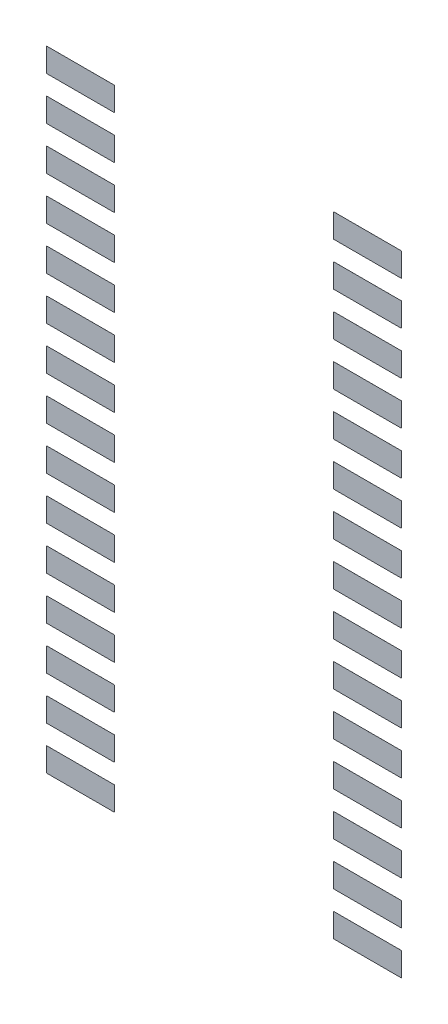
ISO-10303-21;
HEADER;
FILE_DESCRIPTION(('STEP AP214'),'2;1');
FILE_NAME('part.step','',(''),(''),'','','');
FILE_SCHEMA(('AUTOMOTIVE_DESIGN { 1 0 10303 214 1 1 1 1 }'));
ENDSEC;
DATA;
#1=APPLICATION_CONTEXT('core data for automotive mechanical design processes');
#2=APPLICATION_PROTOCOL_DEFINITION('international standard','automotive_design',2000,#1);
#3=PRODUCT_CONTEXT('',#1,'mechanical');
#4=PRODUCT('Part','Part','',(#3));
#5=PRODUCT_RELATED_PRODUCT_CATEGORY('part','',(#4));
#6=PRODUCT_DEFINITION_FORMATION('','',#4);
#7=PRODUCT_DEFINITION_CONTEXT('part definition',#1,'design');
#8=PRODUCT_DEFINITION('design','',#6,#7);
#9=PRODUCT_DEFINITION_SHAPE('','',#8);
#10=(LENGTH_UNIT() NAMED_UNIT(*) SI_UNIT(.MILLI.,.METRE.));
#11=(NAMED_UNIT(*) PLANE_ANGLE_UNIT() SI_UNIT($,.RADIAN.));
#12=(NAMED_UNIT(*) SI_UNIT($,.STERADIAN.) SOLID_ANGLE_UNIT());
#13=UNCERTAINTY_MEASURE_WITH_UNIT(LENGTH_MEASURE(1.E-05),#10,'distance_accuracy_value','');
#14=(GEOMETRIC_REPRESENTATION_CONTEXT(3) GLOBAL_UNCERTAINTY_ASSIGNED_CONTEXT((#13)) GLOBAL_UNIT_ASSIGNED_CONTEXT((#10,
#11,#12)) REPRESENTATION_CONTEXT('',''));
#15=CARTESIAN_POINT('',(0.,0.,0.));
#16=DIRECTION('',(0.,0.,1.));
#17=DIRECTION('',(1.,0.,0.));
#18=AXIS2_PLACEMENT_3D('',#15,#16,#17);
#19=CARTESIAN_POINT('',(2.06,11.11,-0.73162));
#20=DIRECTION('',(0.,-1.,0.));
#21=DIRECTION('',(0.,0.,-1.));
#22=AXIS2_PLACEMENT_3D('',#19,#20,#21);
#23=PLANE('',#22);
#24=DIRECTION('',(1.,0.,0.));
#25=VECTOR('',#24,1.);
#26=CARTESIAN_POINT('',(2.375,11.11,-0.73152));
#27=LINE('',#26,#25);
#28=CARTESIAN_POINT('',(2.06,11.11,-0.73152));
#29=VERTEX_POINT('',#28);
#30=CARTESIAN_POINT('',(2.69,11.11,-0.73152));
#31=VERTEX_POINT('',#30);
#32=EDGE_CURVE('P0_E75',#29,#31,#27,.T.);
#33=ORIENTED_EDGE('',*,*,#32,.T.);
#34=DIRECTION('',(0.,0.,-1.));
#35=VECTOR('',#34,1.);
#36=CARTESIAN_POINT('',(2.69,11.11,-0.73157));
#37=LINE('',#36,#35);
#38=CARTESIAN_POINT('',(2.69,11.11,-0.73162));
#39=VERTEX_POINT('',#38);
#40=EDGE_CURVE('P0_E20',#31,#39,#37,.T.);
#41=ORIENTED_EDGE('',*,*,#40,.T.);
#42=DIRECTION('',(1.,0.,0.));
#43=VECTOR('',#42,1.);
#44=CARTESIAN_POINT('',(2.06,11.11,-0.73162));
#45=LINE('',#44,#43);
#46=CARTESIAN_POINT('',(2.06,11.11,-0.73162));
#47=VERTEX_POINT('',#46);
#48=EDGE_CURVE('P0_E77',#47,#39,#45,.T.);
#49=ORIENTED_EDGE('',*,*,#48,.F.);
#50=DIRECTION('',(0.,0.,-1.));
#51=VECTOR('',#50,1.);
#52=CARTESIAN_POINT('',(2.06,11.11,-0.73157));
#53=LINE('',#52,#51);
#54=EDGE_CURVE('P0_E11',#29,#47,#53,.T.);
#55=ORIENTED_EDGE('',*,*,#54,.F.);
#56=EDGE_LOOP('',(#33,#41,#49,#55));
#57=FACE_BOUND('',#56,.T.);
#58=ADVANCED_FACE('P0_F17',(#57),#23,.F.);
#59=CARTESIAN_POINT('',(2.06,10.89,-0.73162));
#60=DIRECTION('',(1.,0.,0.));
#61=DIRECTION('',(0.,1.,0.));
#62=AXIS2_PLACEMENT_3D('',#59,#60,#61);
#63=PLANE('',#62);
#64=DIRECTION('',(0.,1.,0.));
#65=VECTOR('',#64,1.);
#66=CARTESIAN_POINT('',(2.06,11.,-0.73152));
#67=LINE('',#66,#65);
#68=CARTESIAN_POINT('',(2.06,10.89,-0.73152));
#69=VERTEX_POINT('',#68);
#70=EDGE_CURVE('P0_E81',#69,#29,#67,.T.);
#71=ORIENTED_EDGE('',*,*,#70,.T.);
#72=ORIENTED_EDGE('',*,*,#54,.T.);
#73=DIRECTION('',(0.,1.,0.));
#74=VECTOR('',#73,1.);
#75=CARTESIAN_POINT('',(2.06,10.89,-0.73162));
#76=LINE('',#75,#74);
#77=CARTESIAN_POINT('',(2.06,10.89,-0.73162));
#78=VERTEX_POINT('',#77);
#79=EDGE_CURVE('P0_E106',#78,#47,#76,.T.);
#80=ORIENTED_EDGE('',*,*,#79,.F.);
#81=DIRECTION('',(0.,0.,-1.));
#82=VECTOR('',#81,1.);
#83=CARTESIAN_POINT('',(2.06,10.89,-0.73157));
#84=LINE('',#83,#82);
#85=EDGE_CURVE('P0_E26',#69,#78,#84,.T.);
#86=ORIENTED_EDGE('',*,*,#85,.F.);
#87=EDGE_LOOP('',(#71,#72,#80,#86));
#88=FACE_BOUND('',#87,.T.);
#89=ADVANCED_FACE('P0_F82',(#88),#63,.F.);
#90=CARTESIAN_POINT('',(2.69,10.89,-0.73162));
#91=DIRECTION('',(0.,1.,0.));
#92=DIRECTION('',(1.,0.,0.));
#93=AXIS2_PLACEMENT_3D('',#90,#91,#92);
#94=PLANE('',#93);
#95=DIRECTION('',(-1.,0.,0.));
#96=VECTOR('',#95,1.);
#97=CARTESIAN_POINT('',(2.375,10.89,-0.73152));
#98=LINE('',#97,#96);
#99=CARTESIAN_POINT('',(2.69,10.89,-0.73152));
#100=VERTEX_POINT('',#99);
#101=EDGE_CURVE('P0_E86',#100,#69,#98,.T.);
#102=ORIENTED_EDGE('',*,*,#101,.T.);
#103=ORIENTED_EDGE('',*,*,#85,.T.);
#104=DIRECTION('',(-1.,0.,0.));
#105=VECTOR('',#104,1.);
#106=CARTESIAN_POINT('',(2.69,10.89,-0.73162));
#107=LINE('',#106,#105);
#108=CARTESIAN_POINT('',(2.69,10.89,-0.73162));
#109=VERTEX_POINT('',#108);
#110=EDGE_CURVE('P0_E109',#109,#78,#107,.T.);
#111=ORIENTED_EDGE('',*,*,#110,.F.);
#112=DIRECTION('',(0.,0.,-1.));
#113=VECTOR('',#112,1.);
#114=CARTESIAN_POINT('',(2.69,10.89,-0.73157));
#115=LINE('',#114,#113);
#116=EDGE_CURVE('P0_E48',#100,#109,#115,.T.);
#117=ORIENTED_EDGE('',*,*,#116,.F.);
#118=EDGE_LOOP('',(#102,#103,#111,#117));
#119=FACE_BOUND('',#118,.T.);
#120=ADVANCED_FACE('P0_F118',(#119),#94,.F.);
#121=CARTESIAN_POINT('',(2.69,11.11,-0.73162));
#122=DIRECTION('',(-1.,0.,0.));
#123=DIRECTION('',(0.,0.,1.));
#124=AXIS2_PLACEMENT_3D('',#121,#122,#123);
#125=PLANE('',#124);
#126=DIRECTION('',(0.,-1.,0.));
#127=VECTOR('',#126,1.);
#128=CARTESIAN_POINT('',(2.69,11.,-0.73152));
#129=LINE('',#128,#127);
#130=EDGE_CURVE('P0_E90',#31,#100,#129,.T.);
#131=ORIENTED_EDGE('',*,*,#130,.T.);
#132=ORIENTED_EDGE('',*,*,#116,.T.);
#133=DIRECTION('',(0.,-1.,0.));
#134=VECTOR('',#133,1.);
#135=CARTESIAN_POINT('',(2.69,11.11,-0.73162));
#136=LINE('',#135,#134);
#137=EDGE_CURVE('P0_E96',#39,#109,#136,.T.);
#138=ORIENTED_EDGE('',*,*,#137,.F.);
#139=ORIENTED_EDGE('',*,*,#40,.F.);
#140=EDGE_LOOP('',(#131,#132,#138,#139));
#141=FACE_BOUND('',#140,.T.);
#142=ADVANCED_FACE('P0_F119',(#141),#125,.F.);
#143=CARTESIAN_POINT('',(2.375,11.,-0.73162));
#144=DIRECTION('',(0.,0.,1.));
#145=DIRECTION('',(1.,0.,0.));
#146=AXIS2_PLACEMENT_3D('',#143,#144,#145);
#147=PLANE('',#146);
#148=ORIENTED_EDGE('',*,*,#48,.T.);
#149=ORIENTED_EDGE('',*,*,#137,.T.);
#150=ORIENTED_EDGE('',*,*,#110,.T.);
#151=ORIENTED_EDGE('',*,*,#79,.T.);
#152=EDGE_LOOP('',(#148,#149,#150,#151));
#153=FACE_BOUND('',#152,.T.);
#154=ADVANCED_FACE('P0_F116',(#153),#147,.F.);
#155=CARTESIAN_POINT('',(2.375,11.,-0.73152));
#156=DIRECTION('',(0.,0.,1.));
#157=DIRECTION('',(1.,0.,0.));
#158=AXIS2_PLACEMENT_3D('',#155,#156,#157);
#159=PLANE('',#158);
#160=ORIENTED_EDGE('',*,*,#32,.F.);
#161=ORIENTED_EDGE('',*,*,#70,.F.);
#162=ORIENTED_EDGE('',*,*,#101,.F.);
#163=ORIENTED_EDGE('',*,*,#130,.F.);
#164=EDGE_LOOP('',(#160,#161,#162,#163));
#165=FACE_BOUND('',#164,.T.);
#166=ADVANCED_FACE('P0_F89',(#165),#159,.T.);
#167=CLOSED_SHELL('',(#58,#89,#120,#142,#154,#166));
#168=MANIFOLD_SOLID_BREP('P0_B1',#167);
#169=CARTESIAN_POINT('',(4.71,12.71,-0.73162));
#170=DIRECTION('',(0.,-1.,0.));
#171=DIRECTION('',(0.,0.,-1.));
#172=AXIS2_PLACEMENT_3D('',#169,#170,#171);
#173=PLANE('',#172);
#174=DIRECTION('',(1.,0.,0.));
#175=VECTOR('',#174,1.);
#176=CARTESIAN_POINT('',(5.025,12.71,-0.73152));
#177=LINE('',#176,#175);
#178=CARTESIAN_POINT('',(4.71,12.71,-0.73152));
#179=VERTEX_POINT('',#178);
#180=CARTESIAN_POINT('',(5.34,12.71,-0.73152));
#181=VERTEX_POINT('',#180);
#182=EDGE_CURVE('P1_E106',#179,#181,#177,.T.);
#183=ORIENTED_EDGE('',*,*,#182,.T.);
#184=DIRECTION('',(0.,0.,-1.));
#185=VECTOR('',#184,1.);
#186=CARTESIAN_POINT('',(5.34,12.71,-0.73157));
#187=LINE('',#186,#185);
#188=CARTESIAN_POINT('',(5.34,12.71,-0.73162));
#189=VERTEX_POINT('',#188);
#190=EDGE_CURVE('P1_E83',#181,#189,#187,.T.);
#191=ORIENTED_EDGE('',*,*,#190,.T.);
#192=DIRECTION('',(1.,0.,0.));
#193=VECTOR('',#192,1.);
#194=CARTESIAN_POINT('',(4.71,12.71,-0.73162));
#195=LINE('',#194,#193);
#196=CARTESIAN_POINT('',(4.71,12.71,-0.73162));
#197=VERTEX_POINT('',#196);
#198=EDGE_CURVE('P1_E78',#197,#189,#195,.T.);
#199=ORIENTED_EDGE('',*,*,#198,.F.);
#200=DIRECTION('',(0.,0.,-1.));
#201=VECTOR('',#200,1.);
#202=CARTESIAN_POINT('',(4.71,12.71,-0.73157));
#203=LINE('',#202,#201);
#204=EDGE_CURVE('P1_E11',#179,#197,#203,.T.);
#205=ORIENTED_EDGE('',*,*,#204,.F.);
#206=EDGE_LOOP('',(#183,#191,#199,#205));
#207=FACE_BOUND('',#206,.T.);
#208=ADVANCED_FACE('P1_F17',(#207),#173,.F.);
#209=CARTESIAN_POINT('',(4.71,12.49,-0.73162));
#210=DIRECTION('',(1.,0.,0.));
#211=DIRECTION('',(0.,1.,0.));
#212=AXIS2_PLACEMENT_3D('',#209,#210,#211);
#213=PLANE('',#212);
#214=DIRECTION('',(0.,1.,0.));
#215=VECTOR('',#214,1.);
#216=CARTESIAN_POINT('',(4.71,12.6,-0.73152));
#217=LINE('',#216,#215);
#218=CARTESIAN_POINT('',(4.71,12.49,-0.73152));
#219=VERTEX_POINT('',#218);
#220=EDGE_CURVE('P1_E69',#219,#179,#217,.T.);
#221=ORIENTED_EDGE('',*,*,#220,.T.);
#222=ORIENTED_EDGE('',*,*,#204,.T.);
#223=DIRECTION('',(0.,1.,0.));
#224=VECTOR('',#223,1.);
#225=CARTESIAN_POINT('',(4.71,12.49,-0.73162));
#226=LINE('',#225,#224);
#227=CARTESIAN_POINT('',(4.71,12.49,-0.73162));
#228=VERTEX_POINT('',#227);
#229=EDGE_CURVE('P1_E65',#228,#197,#226,.T.);
#230=ORIENTED_EDGE('',*,*,#229,.F.);
#231=DIRECTION('',(0.,0.,-1.));
#232=VECTOR('',#231,1.);
#233=CARTESIAN_POINT('',(4.71,12.49,-0.73157));
#234=LINE('',#233,#232);
#235=EDGE_CURVE('P1_E25',#219,#228,#234,.T.);
#236=ORIENTED_EDGE('',*,*,#235,.F.);
#237=EDGE_LOOP('',(#221,#222,#230,#236));
#238=FACE_BOUND('',#237,.T.);
#239=ADVANCED_FACE('P1_F64',(#238),#213,.F.);
#240=CARTESIAN_POINT('',(5.34,12.49,-0.73162));
#241=DIRECTION('',(0.,1.,0.));
#242=DIRECTION('',(1.,0.,0.));
#243=AXIS2_PLACEMENT_3D('',#240,#241,#242);
#244=PLANE('',#243);
#245=DIRECTION('',(-1.,0.,0.));
#246=VECTOR('',#245,1.);
#247=CARTESIAN_POINT('',(5.025,12.49,-0.73152));
#248=LINE('',#247,#246);
#249=CARTESIAN_POINT('',(5.34,12.49,-0.73152));
#250=VERTEX_POINT('',#249);
#251=EDGE_CURVE('P1_E93',#250,#219,#248,.T.);
#252=ORIENTED_EDGE('',*,*,#251,.T.);
#253=ORIENTED_EDGE('',*,*,#235,.T.);
#254=DIRECTION('',(-1.,0.,0.));
#255=VECTOR('',#254,1.);
#256=CARTESIAN_POINT('',(5.34,12.49,-0.73162));
#257=LINE('',#256,#255);
#258=CARTESIAN_POINT('',(5.34,12.49,-0.73162));
#259=VERTEX_POINT('',#258);
#260=EDGE_CURVE('P1_E79',#259,#228,#257,.T.);
#261=ORIENTED_EDGE('',*,*,#260,.F.);
#262=DIRECTION('',(0.,0.,-1.));
#263=VECTOR('',#262,1.);
#264=CARTESIAN_POINT('',(5.34,12.49,-0.73157));
#265=LINE('',#264,#263);
#266=EDGE_CURVE('P1_E49',#250,#259,#265,.T.);
#267=ORIENTED_EDGE('',*,*,#266,.F.);
#268=EDGE_LOOP('',(#252,#253,#261,#267));
#269=FACE_BOUND('',#268,.T.);
#270=ADVANCED_FACE('P1_F112',(#269),#244,.F.);
#271=CARTESIAN_POINT('',(5.34,12.71,-0.73162));
#272=DIRECTION('',(-1.,0.,0.));
#273=DIRECTION('',(0.,0.,1.));
#274=AXIS2_PLACEMENT_3D('',#271,#272,#273);
#275=PLANE('',#274);
#276=DIRECTION('',(0.,-1.,0.));
#277=VECTOR('',#276,1.);
#278=CARTESIAN_POINT('',(5.34,12.6,-0.73152));
#279=LINE('',#278,#277);
#280=EDGE_CURVE('P1_E86',#181,#250,#279,.T.);
#281=ORIENTED_EDGE('',*,*,#280,.T.);
#282=ORIENTED_EDGE('',*,*,#266,.T.);
#283=DIRECTION('',(0.,-1.,0.));
#284=VECTOR('',#283,1.);
#285=CARTESIAN_POINT('',(5.34,12.71,-0.73162));
#286=LINE('',#285,#284);
#287=EDGE_CURVE('P1_E85',#189,#259,#286,.T.);
#288=ORIENTED_EDGE('',*,*,#287,.F.);
#289=ORIENTED_EDGE('',*,*,#190,.F.);
#290=EDGE_LOOP('',(#281,#282,#288,#289));
#291=FACE_BOUND('',#290,.T.);
#292=ADVANCED_FACE('P1_F121',(#291),#275,.F.);
#293=CARTESIAN_POINT('',(5.025,12.6,-0.73162));
#294=DIRECTION('',(0.,0.,1.));
#295=DIRECTION('',(1.,0.,0.));
#296=AXIS2_PLACEMENT_3D('',#293,#294,#295);
#297=PLANE('',#296);
#298=ORIENTED_EDGE('',*,*,#198,.T.);
#299=ORIENTED_EDGE('',*,*,#287,.T.);
#300=ORIENTED_EDGE('',*,*,#260,.T.);
#301=ORIENTED_EDGE('',*,*,#229,.T.);
#302=EDGE_LOOP('',(#298,#299,#300,#301));
#303=FACE_BOUND('',#302,.T.);
#304=ADVANCED_FACE('P1_F76',(#303),#297,.F.);
#305=CARTESIAN_POINT('',(5.025,12.6,-0.73152));
#306=DIRECTION('',(0.,0.,1.));
#307=DIRECTION('',(1.,0.,0.));
#308=AXIS2_PLACEMENT_3D('',#305,#306,#307);
#309=PLANE('',#308);
#310=ORIENTED_EDGE('',*,*,#182,.F.);
#311=ORIENTED_EDGE('',*,*,#220,.F.);
#312=ORIENTED_EDGE('',*,*,#251,.F.);
#313=ORIENTED_EDGE('',*,*,#280,.F.);
#314=EDGE_LOOP('',(#310,#311,#312,#313));
#315=FACE_BOUND('',#314,.T.);
#316=ADVANCED_FACE('P1_F116',(#315),#309,.T.);
#317=CLOSED_SHELL('',(#208,#239,#270,#292,#304,#316));
#318=MANIFOLD_SOLID_BREP('P1_B1',#317);
#319=CARTESIAN_POINT('',(2.06,13.11,-0.73162));
#320=DIRECTION('',(0.,-1.,0.));
#321=DIRECTION('',(0.,0.,-1.));
#322=AXIS2_PLACEMENT_3D('',#319,#320,#321);
#323=PLANE('',#322);
#324=DIRECTION('',(1.,0.,0.));
#325=VECTOR('',#324,1.);
#326=CARTESIAN_POINT('',(2.375,13.11,-0.73152));
#327=LINE('',#326,#325);
#328=CARTESIAN_POINT('',(2.06,13.11,-0.73152));
#329=VERTEX_POINT('',#328);
#330=CARTESIAN_POINT('',(2.69,13.11,-0.73152));
#331=VERTEX_POINT('',#330);
#332=EDGE_CURVE('P2_E80',#329,#331,#327,.T.);
#333=ORIENTED_EDGE('',*,*,#332,.T.);
#334=DIRECTION('',(0.,0.,-1.));
#335=VECTOR('',#334,1.);
#336=CARTESIAN_POINT('',(2.69,13.11,-0.73157));
#337=LINE('',#336,#335);
#338=CARTESIAN_POINT('',(2.69,13.11,-0.73162));
#339=VERTEX_POINT('',#338);
#340=EDGE_CURVE('P2_E67',#331,#339,#337,.T.);
#341=ORIENTED_EDGE('',*,*,#340,.T.);
#342=DIRECTION('',(1.,0.,0.));
#343=VECTOR('',#342,1.);
#344=CARTESIAN_POINT('',(2.06,13.11,-0.73162));
#345=LINE('',#344,#343);
#346=CARTESIAN_POINT('',(2.06,13.11,-0.73162));
#347=VERTEX_POINT('',#346);
#348=EDGE_CURVE('P2_E91',#347,#339,#345,.T.);
#349=ORIENTED_EDGE('',*,*,#348,.F.);
#350=DIRECTION('',(0.,0.,-1.));
#351=VECTOR('',#350,1.);
#352=CARTESIAN_POINT('',(2.06,13.11,-0.73157));
#353=LINE('',#352,#351);
#354=EDGE_CURVE('P2_E11',#329,#347,#353,.T.);
#355=ORIENTED_EDGE('',*,*,#354,.F.);
#356=EDGE_LOOP('',(#333,#341,#349,#355));
#357=FACE_BOUND('',#356,.T.);
#358=ADVANCED_FACE('P2_F17',(#357),#323,.F.);
#359=CARTESIAN_POINT('',(2.06,12.89,-0.73162));
#360=DIRECTION('',(1.,0.,0.));
#361=DIRECTION('',(0.,1.,0.));
#362=AXIS2_PLACEMENT_3D('',#359,#360,#361);
#363=PLANE('',#362);
#364=DIRECTION('',(0.,1.,0.));
#365=VECTOR('',#364,1.);
#366=CARTESIAN_POINT('',(2.06,13.,-0.73152));
#367=LINE('',#366,#365);
#368=CARTESIAN_POINT('',(2.06,12.89,-0.73152));
#369=VERTEX_POINT('',#368);
#370=EDGE_CURVE('P2_E61',#369,#329,#367,.T.);
#371=ORIENTED_EDGE('',*,*,#370,.T.);
#372=ORIENTED_EDGE('',*,*,#354,.T.);
#373=DIRECTION('',(0.,1.,0.));
#374=VECTOR('',#373,1.);
#375=CARTESIAN_POINT('',(2.06,12.89,-0.73162));
#376=LINE('',#375,#374);
#377=CARTESIAN_POINT('',(2.06,12.89,-0.73162));
#378=VERTEX_POINT('',#377);
#379=EDGE_CURVE('P2_E64',#378,#347,#376,.T.);
#380=ORIENTED_EDGE('',*,*,#379,.F.);
#381=DIRECTION('',(0.,0.,-1.));
#382=VECTOR('',#381,1.);
#383=CARTESIAN_POINT('',(2.06,12.89,-0.73157));
#384=LINE('',#383,#382);
#385=EDGE_CURVE('P2_E26',#369,#378,#384,.T.);
#386=ORIENTED_EDGE('',*,*,#385,.F.);
#387=EDGE_LOOP('',(#371,#372,#380,#386));
#388=FACE_BOUND('',#387,.T.);
#389=ADVANCED_FACE('P2_F59',(#388),#363,.F.);
#390=CARTESIAN_POINT('',(2.69,12.89,-0.73162));
#391=DIRECTION('',(0.,1.,0.));
#392=DIRECTION('',(1.,0.,0.));
#393=AXIS2_PLACEMENT_3D('',#390,#391,#392);
#394=PLANE('',#393);
#395=DIRECTION('',(-1.,0.,0.));
#396=VECTOR('',#395,1.);
#397=CARTESIAN_POINT('',(2.375,12.89,-0.73152));
#398=LINE('',#397,#396);
#399=CARTESIAN_POINT('',(2.69,12.89,-0.73152));
#400=VERTEX_POINT('',#399);
#401=EDGE_CURVE('P2_E69',#400,#369,#398,.T.);
#402=ORIENTED_EDGE('',*,*,#401,.T.);
#403=ORIENTED_EDGE('',*,*,#385,.T.);
#404=DIRECTION('',(-1.,0.,0.));
#405=VECTOR('',#404,1.);
#406=CARTESIAN_POINT('',(2.69,12.89,-0.73162));
#407=LINE('',#406,#405);
#408=CARTESIAN_POINT('',(2.69,12.89,-0.73162));
#409=VERTEX_POINT('',#408);
#410=EDGE_CURVE('P2_E90',#409,#378,#407,.T.);
#411=ORIENTED_EDGE('',*,*,#410,.F.);
#412=DIRECTION('',(0.,0.,-1.));
#413=VECTOR('',#412,1.);
#414=CARTESIAN_POINT('',(2.69,12.89,-0.73157));
#415=LINE('',#414,#413);
#416=EDGE_CURVE('P2_E71',#400,#409,#415,.T.);
#417=ORIENTED_EDGE('',*,*,#416,.F.);
#418=EDGE_LOOP('',(#402,#403,#411,#417));
#419=FACE_BOUND('',#418,.T.);
#420=ADVANCED_FACE('P2_F70',(#419),#394,.F.);
#421=CARTESIAN_POINT('',(2.69,13.11,-0.73162));
#422=DIRECTION('',(-1.,0.,0.));
#423=DIRECTION('',(0.,0.,1.));
#424=AXIS2_PLACEMENT_3D('',#421,#422,#423);
#425=PLANE('',#424);
#426=DIRECTION('',(0.,-1.,0.));
#427=VECTOR('',#426,1.);
#428=CARTESIAN_POINT('',(2.69,13.,-0.73152));
#429=LINE('',#428,#427);
#430=EDGE_CURVE('P2_E76',#331,#400,#429,.T.);
#431=ORIENTED_EDGE('',*,*,#430,.T.);
#432=ORIENTED_EDGE('',*,*,#416,.T.);
#433=DIRECTION('',(0.,-1.,0.));
#434=VECTOR('',#433,1.);
#435=CARTESIAN_POINT('',(2.69,13.11,-0.73162));
#436=LINE('',#435,#434);
#437=EDGE_CURVE('P2_E88',#339,#409,#436,.T.);
#438=ORIENTED_EDGE('',*,*,#437,.F.);
#439=ORIENTED_EDGE('',*,*,#340,.F.);
#440=EDGE_LOOP('',(#431,#432,#438,#439));
#441=FACE_BOUND('',#440,.T.);
#442=ADVANCED_FACE('P2_F113',(#441),#425,.F.);
#443=CARTESIAN_POINT('',(2.375,13.,-0.73162));
#444=DIRECTION('',(0.,0.,1.));
#445=DIRECTION('',(1.,0.,0.));
#446=AXIS2_PLACEMENT_3D('',#443,#444,#445);
#447=PLANE('',#446);
#448=ORIENTED_EDGE('',*,*,#348,.T.);
#449=ORIENTED_EDGE('',*,*,#437,.T.);
#450=ORIENTED_EDGE('',*,*,#410,.T.);
#451=ORIENTED_EDGE('',*,*,#379,.T.);
#452=EDGE_LOOP('',(#448,#449,#450,#451));
#453=FACE_BOUND('',#452,.T.);
#454=ADVANCED_FACE('P2_F115',(#453),#447,.F.);
#455=CARTESIAN_POINT('',(2.375,13.,-0.73152));
#456=DIRECTION('',(0.,0.,1.));
#457=DIRECTION('',(1.,0.,0.));
#458=AXIS2_PLACEMENT_3D('',#455,#456,#457);
#459=PLANE('',#458);
#460=ORIENTED_EDGE('',*,*,#332,.F.);
#461=ORIENTED_EDGE('',*,*,#370,.F.);
#462=ORIENTED_EDGE('',*,*,#401,.F.);
#463=ORIENTED_EDGE('',*,*,#430,.F.);
#464=EDGE_LOOP('',(#460,#461,#462,#463));
#465=FACE_BOUND('',#464,.T.);
#466=ADVANCED_FACE('P2_F78',(#465),#459,.T.);
#467=CLOSED_SHELL('',(#358,#389,#420,#442,#454,#466));
#468=MANIFOLD_SOLID_BREP('P2_B1',#467);
#469=CARTESIAN_POINT('',(4.71,13.11,-0.73162));
#470=DIRECTION('',(0.,-1.,0.));
#471=DIRECTION('',(0.,0.,-1.));
#472=AXIS2_PLACEMENT_3D('',#469,#470,#471);
#473=PLANE('',#472);
#474=DIRECTION('',(1.,0.,0.));
#475=VECTOR('',#474,1.);
#476=CARTESIAN_POINT('',(5.025,13.11,-0.73152));
#477=LINE('',#476,#475);
#478=CARTESIAN_POINT('',(4.71,13.11,-0.73152));
#479=VERTEX_POINT('',#478);
#480=CARTESIAN_POINT('',(5.34,13.11,-0.73152));
#481=VERTEX_POINT('',#480);
#482=EDGE_CURVE('P3_E66',#479,#481,#477,.T.);
#483=ORIENTED_EDGE('',*,*,#482,.T.);
#484=DIRECTION('',(0.,0.,-1.));
#485=VECTOR('',#484,1.);
#486=CARTESIAN_POINT('',(5.34,13.11,-0.73157));
#487=LINE('',#486,#485);
#488=CARTESIAN_POINT('',(5.34,13.11,-0.73162));
#489=VERTEX_POINT('',#488);
#490=EDGE_CURVE('P3_E59',#481,#489,#487,.T.);
#491=ORIENTED_EDGE('',*,*,#490,.T.);
#492=DIRECTION('',(1.,0.,0.));
#493=VECTOR('',#492,1.);
#494=CARTESIAN_POINT('',(4.71,13.11,-0.73162));
#495=LINE('',#494,#493);
#496=CARTESIAN_POINT('',(4.71,13.11,-0.73162));
#497=VERTEX_POINT('',#496);
#498=EDGE_CURVE('P3_E63',#497,#489,#495,.T.);
#499=ORIENTED_EDGE('',*,*,#498,.F.);
#500=DIRECTION('',(0.,0.,-1.));
#501=VECTOR('',#500,1.);
#502=CARTESIAN_POINT('',(4.71,13.11,-0.73157));
#503=LINE('',#502,#501);
#504=EDGE_CURVE('P3_E11',#479,#497,#503,.T.);
#505=ORIENTED_EDGE('',*,*,#504,.F.);
#506=EDGE_LOOP('',(#483,#491,#499,#505));
#507=FACE_BOUND('',#506,.T.);
#508=ADVANCED_FACE('P3_F17',(#507),#473,.F.);
#509=CARTESIAN_POINT('',(4.71,12.89,-0.73162));
#510=DIRECTION('',(1.,0.,0.));
#511=DIRECTION('',(0.,1.,0.));
#512=AXIS2_PLACEMENT_3D('',#509,#510,#511);
#513=PLANE('',#512);
#514=DIRECTION('',(0.,1.,0.));
#515=VECTOR('',#514,1.);
#516=CARTESIAN_POINT('',(4.71,13.,-0.73152));
#517=LINE('',#516,#515);
#518=CARTESIAN_POINT('',(4.71,12.89,-0.73152));
#519=VERTEX_POINT('',#518);
#520=EDGE_CURVE('P3_E101',#519,#479,#517,.T.);
#521=ORIENTED_EDGE('',*,*,#520,.T.);
#522=ORIENTED_EDGE('',*,*,#504,.T.);
#523=DIRECTION('',(0.,1.,0.));
#524=VECTOR('',#523,1.);
#525=CARTESIAN_POINT('',(4.71,12.89,-0.73162));
#526=LINE('',#525,#524);
#527=CARTESIAN_POINT('',(4.71,12.89,-0.73162));
#528=VERTEX_POINT('',#527);
#529=EDGE_CURVE('P3_E83',#528,#497,#526,.T.);
#530=ORIENTED_EDGE('',*,*,#529,.F.);
#531=DIRECTION('',(0.,0.,-1.));
#532=VECTOR('',#531,1.);
#533=CARTESIAN_POINT('',(4.71,12.89,-0.73157));
#534=LINE('',#533,#532);
#535=EDGE_CURVE('P3_E20',#519,#528,#534,.T.);
#536=ORIENTED_EDGE('',*,*,#535,.F.);
#537=EDGE_LOOP('',(#521,#522,#530,#536));
#538=FACE_BOUND('',#537,.T.);
#539=ADVANCED_FACE('P3_F118',(#538),#513,.F.);
#540=CARTESIAN_POINT('',(5.34,12.89,-0.73162));
#541=DIRECTION('',(0.,1.,0.));
#542=DIRECTION('',(1.,0.,0.));
#543=AXIS2_PLACEMENT_3D('',#540,#541,#542);
#544=PLANE('',#543);
#545=DIRECTION('',(-1.,0.,0.));
#546=VECTOR('',#545,1.);
#547=CARTESIAN_POINT('',(5.025,12.89,-0.73152));
#548=LINE('',#547,#546);
#549=CARTESIAN_POINT('',(5.34,12.89,-0.73152));
#550=VERTEX_POINT('',#549);
#551=EDGE_CURVE('P3_E90',#550,#519,#548,.T.);
#552=ORIENTED_EDGE('',*,*,#551,.T.);
#553=ORIENTED_EDGE('',*,*,#535,.T.);
#554=DIRECTION('',(-1.,0.,0.));
#555=VECTOR('',#554,1.);
#556=CARTESIAN_POINT('',(5.34,12.89,-0.73162));
#557=LINE('',#556,#555);
#558=CARTESIAN_POINT('',(5.34,12.89,-0.73162));
#559=VERTEX_POINT('',#558);
#560=EDGE_CURVE('P3_E79',#559,#528,#557,.T.);
#561=ORIENTED_EDGE('',*,*,#560,.F.);
#562=DIRECTION('',(0.,0.,-1.));
#563=VECTOR('',#562,1.);
#564=CARTESIAN_POINT('',(5.34,12.89,-0.73157));
#565=LINE('',#564,#563);
#566=EDGE_CURVE('P3_E71',#550,#559,#565,.T.);
#567=ORIENTED_EDGE('',*,*,#566,.F.);
#568=EDGE_LOOP('',(#552,#553,#561,#567));
#569=FACE_BOUND('',#568,.T.);
#570=ADVANCED_FACE('P3_F141',(#569),#544,.F.);
#571=CARTESIAN_POINT('',(5.34,13.11,-0.73162));
#572=DIRECTION('',(-1.,0.,0.));
#573=DIRECTION('',(0.,0.,1.));
#574=AXIS2_PLACEMENT_3D('',#571,#572,#573);
#575=PLANE('',#574);
#576=DIRECTION('',(0.,-1.,0.));
#577=VECTOR('',#576,1.);
#578=CARTESIAN_POINT('',(5.34,13.,-0.73152));
#579=LINE('',#578,#577);
#580=EDGE_CURVE('P3_E85',#481,#550,#579,.T.);
#581=ORIENTED_EDGE('',*,*,#580,.T.);
#582=ORIENTED_EDGE('',*,*,#566,.T.);
#583=DIRECTION('',(0.,-1.,0.));
#584=VECTOR('',#583,1.);
#585=CARTESIAN_POINT('',(5.34,13.11,-0.73162));
#586=LINE('',#585,#584);
#587=EDGE_CURVE('P3_E74',#489,#559,#586,.T.);
#588=ORIENTED_EDGE('',*,*,#587,.F.);
#589=ORIENTED_EDGE('',*,*,#490,.F.);
#590=EDGE_LOOP('',(#581,#582,#588,#589));
#591=FACE_BOUND('',#590,.T.);
#592=ADVANCED_FACE('P3_F75',(#591),#575,.F.);
#593=CARTESIAN_POINT('',(5.025,13.,-0.73162));
#594=DIRECTION('',(0.,0.,1.));
#595=DIRECTION('',(1.,0.,0.));
#596=AXIS2_PLACEMENT_3D('',#593,#594,#595);
#597=PLANE('',#596);
#598=ORIENTED_EDGE('',*,*,#498,.T.);
#599=ORIENTED_EDGE('',*,*,#587,.T.);
#600=ORIENTED_EDGE('',*,*,#560,.T.);
#601=ORIENTED_EDGE('',*,*,#529,.T.);
#602=EDGE_LOOP('',(#598,#599,#600,#601));
#603=FACE_BOUND('',#602,.T.);
#604=ADVANCED_FACE('P3_F82',(#603),#597,.F.);
#605=CARTESIAN_POINT('',(5.025,13.,-0.73152));
#606=DIRECTION('',(0.,0.,1.));
#607=DIRECTION('',(1.,0.,0.));
#608=AXIS2_PLACEMENT_3D('',#605,#606,#607);
#609=PLANE('',#608);
#610=ORIENTED_EDGE('',*,*,#482,.F.);
#611=ORIENTED_EDGE('',*,*,#520,.F.);
#612=ORIENTED_EDGE('',*,*,#551,.F.);
#613=ORIENTED_EDGE('',*,*,#580,.F.);
#614=EDGE_LOOP('',(#610,#611,#612,#613));
#615=FACE_BOUND('',#614,.T.);
#616=ADVANCED_FACE('P3_F123',(#615),#609,.T.);
#617=CLOSED_SHELL('',(#508,#539,#570,#592,#604,#616));
#618=MANIFOLD_SOLID_BREP('P3_B1',#617);
#619=CARTESIAN_POINT('',(2.06,13.51,-0.73162));
#620=DIRECTION('',(0.,-1.,0.));
#621=DIRECTION('',(0.,0.,-1.));
#622=AXIS2_PLACEMENT_3D('',#619,#620,#621);
#623=PLANE('',#622);
#624=DIRECTION('',(1.,0.,0.));
#625=VECTOR('',#624,1.);
#626=CARTESIAN_POINT('',(2.375,13.51,-0.73152));
#627=LINE('',#626,#625);
#628=CARTESIAN_POINT('',(2.06,13.51,-0.73152));
#629=VERTEX_POINT('',#628);
#630=CARTESIAN_POINT('',(2.69,13.51,-0.73152));
#631=VERTEX_POINT('',#630);
#632=EDGE_CURVE('P4_E78',#629,#631,#627,.T.);
#633=ORIENTED_EDGE('',*,*,#632,.T.);
#634=DIRECTION('',(0.,0.,-1.));
#635=VECTOR('',#634,1.);
#636=CARTESIAN_POINT('',(2.69,13.51,-0.73157));
#637=LINE('',#636,#635);
#638=CARTESIAN_POINT('',(2.69,13.51,-0.73162));
#639=VERTEX_POINT('',#638);
#640=EDGE_CURVE('P4_E115',#631,#639,#637,.T.);
#641=ORIENTED_EDGE('',*,*,#640,.T.);
#642=DIRECTION('',(1.,0.,0.));
#643=VECTOR('',#642,1.);
#644=CARTESIAN_POINT('',(2.06,13.51,-0.73162));
#645=LINE('',#644,#643);
#646=CARTESIAN_POINT('',(2.06,13.51,-0.73162));
#647=VERTEX_POINT('',#646);
#648=EDGE_CURVE('P4_E80',#647,#639,#645,.T.);
#649=ORIENTED_EDGE('',*,*,#648,.F.);
#650=DIRECTION('',(0.,0.,-1.));
#651=VECTOR('',#650,1.);
#652=CARTESIAN_POINT('',(2.06,13.51,-0.73157));
#653=LINE('',#652,#651);
#654=EDGE_CURVE('P4_E11',#629,#647,#653,.T.);
#655=ORIENTED_EDGE('',*,*,#654,.F.);
#656=EDGE_LOOP('',(#633,#641,#649,#655));
#657=FACE_BOUND('',#656,.T.);
#658=ADVANCED_FACE('P4_F17',(#657),#623,.F.);
#659=CARTESIAN_POINT('',(2.06,13.29,-0.73162));
#660=DIRECTION('',(1.,0.,0.));
#661=DIRECTION('',(0.,1.,0.));
#662=AXIS2_PLACEMENT_3D('',#659,#660,#661);
#663=PLANE('',#662);
#664=DIRECTION('',(0.,1.,0.));
#665=VECTOR('',#664,1.);
#666=CARTESIAN_POINT('',(2.06,13.4,-0.73152));
#667=LINE('',#666,#665);
#668=CARTESIAN_POINT('',(2.06,13.29,-0.73152));
#669=VERTEX_POINT('',#668);
#670=EDGE_CURVE('P4_E82',#669,#629,#667,.T.);
#671=ORIENTED_EDGE('',*,*,#670,.T.);
#672=ORIENTED_EDGE('',*,*,#654,.T.);
#673=DIRECTION('',(0.,1.,0.));
#674=VECTOR('',#673,1.);
#675=CARTESIAN_POINT('',(2.06,13.29,-0.73162));
#676=LINE('',#675,#674);
#677=CARTESIAN_POINT('',(2.06,13.29,-0.73162));
#678=VERTEX_POINT('',#677);
#679=EDGE_CURVE('P4_E107',#678,#647,#676,.T.);
#680=ORIENTED_EDGE('',*,*,#679,.F.);
#681=DIRECTION('',(0.,0.,-1.));
#682=VECTOR('',#681,1.);
#683=CARTESIAN_POINT('',(2.06,13.29,-0.73157));
#684=LINE('',#683,#682);
#685=EDGE_CURVE('P4_E20',#669,#678,#684,.T.);
#686=ORIENTED_EDGE('',*,*,#685,.F.);
#687=EDGE_LOOP('',(#671,#672,#680,#686));
#688=FACE_BOUND('',#687,.T.);
#689=ADVANCED_FACE('P4_F83',(#688),#663,.F.);
#690=CARTESIAN_POINT('',(2.69,13.29,-0.73162));
#691=DIRECTION('',(0.,1.,0.));
#692=DIRECTION('',(1.,0.,0.));
#693=AXIS2_PLACEMENT_3D('',#690,#691,#692);
#694=PLANE('',#693);
#695=DIRECTION('',(-1.,0.,0.));
#696=VECTOR('',#695,1.);
#697=CARTESIAN_POINT('',(2.375,13.29,-0.73152));
#698=LINE('',#697,#696);
#699=CARTESIAN_POINT('',(2.69,13.29,-0.73152));
#700=VERTEX_POINT('',#699);
#701=EDGE_CURVE('P4_E87',#700,#669,#698,.T.);
#702=ORIENTED_EDGE('',*,*,#701,.T.);
#703=ORIENTED_EDGE('',*,*,#685,.T.);
#704=DIRECTION('',(-1.,0.,0.));
#705=VECTOR('',#704,1.);
#706=CARTESIAN_POINT('',(2.69,13.29,-0.73162));
#707=LINE('',#706,#705);
#708=CARTESIAN_POINT('',(2.69,13.29,-0.73162));
#709=VERTEX_POINT('',#708);
#710=EDGE_CURVE('P4_E106',#709,#678,#707,.T.);
#711=ORIENTED_EDGE('',*,*,#710,.F.);
#712=DIRECTION('',(0.,0.,-1.));
#713=VECTOR('',#712,1.);
#714=CARTESIAN_POINT('',(2.69,13.29,-0.73157));
#715=LINE('',#714,#713);
#716=EDGE_CURVE('P4_E49',#700,#709,#715,.T.);
#717=ORIENTED_EDGE('',*,*,#716,.F.);
#718=EDGE_LOOP('',(#702,#703,#711,#717));
#719=FACE_BOUND('',#718,.T.);
#720=ADVANCED_FACE('P4_F134',(#719),#694,.F.);
#721=CARTESIAN_POINT('',(2.69,13.51,-0.73162));
#722=DIRECTION('',(-1.,0.,0.));
#723=DIRECTION('',(0.,0.,1.));
#724=AXIS2_PLACEMENT_3D('',#721,#722,#723);
#725=PLANE('',#724);
#726=DIRECTION('',(0.,-1.,0.));
#727=VECTOR('',#726,1.);
#728=CARTESIAN_POINT('',(2.69,13.4,-0.73152));
#729=LINE('',#728,#727);
#730=EDGE_CURVE('P4_E91',#631,#700,#729,.T.);
#731=ORIENTED_EDGE('',*,*,#730,.T.);
#732=ORIENTED_EDGE('',*,*,#716,.T.);
#733=DIRECTION('',(0.,-1.,0.));
#734=VECTOR('',#733,1.);
#735=CARTESIAN_POINT('',(2.69,13.51,-0.73162));
#736=LINE('',#735,#734);
#737=EDGE_CURVE('P4_E102',#639,#709,#736,.T.);
#738=ORIENTED_EDGE('',*,*,#737,.F.);
#739=ORIENTED_EDGE('',*,*,#640,.F.);
#740=EDGE_LOOP('',(#731,#732,#738,#739));
#741=FACE_BOUND('',#740,.T.);
#742=ADVANCED_FACE('P4_F139',(#741),#725,.F.);
#743=CARTESIAN_POINT('',(2.375,13.4,-0.73162));
#744=DIRECTION('',(0.,0.,1.));
#745=DIRECTION('',(1.,0.,0.));
#746=AXIS2_PLACEMENT_3D('',#743,#744,#745);
#747=PLANE('',#746);
#748=ORIENTED_EDGE('',*,*,#648,.T.);
#749=ORIENTED_EDGE('',*,*,#737,.T.);
#750=ORIENTED_EDGE('',*,*,#710,.T.);
#751=ORIENTED_EDGE('',*,*,#679,.T.);
#752=EDGE_LOOP('',(#748,#749,#750,#751));
#753=FACE_BOUND('',#752,.T.);
#754=ADVANCED_FACE('P4_F128',(#753),#747,.F.);
#755=CARTESIAN_POINT('',(2.375,13.4,-0.73152));
#756=DIRECTION('',(0.,0.,1.));
#757=DIRECTION('',(1.,0.,0.));
#758=AXIS2_PLACEMENT_3D('',#755,#756,#757);
#759=PLANE('',#758);
#760=ORIENTED_EDGE('',*,*,#632,.F.);
#761=ORIENTED_EDGE('',*,*,#670,.F.);
#762=ORIENTED_EDGE('',*,*,#701,.F.);
#763=ORIENTED_EDGE('',*,*,#730,.F.);
#764=EDGE_LOOP('',(#760,#761,#762,#763));
#765=FACE_BOUND('',#764,.T.);
#766=ADVANCED_FACE('P4_F90',(#765),#759,.T.);
#767=CLOSED_SHELL('',(#658,#689,#720,#742,#754,#766));
#768=MANIFOLD_SOLID_BREP('P4_B1',#767);
#769=CARTESIAN_POINT('',(4.71,13.51,-0.73162));
#770=DIRECTION('',(0.,-1.,0.));
#771=DIRECTION('',(0.,0.,-1.));
#772=AXIS2_PLACEMENT_3D('',#769,#770,#771);
#773=PLANE('',#772);
#774=DIRECTION('',(1.,0.,0.));
#775=VECTOR('',#774,1.);
#776=CARTESIAN_POINT('',(5.025,13.51,-0.73152));
#777=LINE('',#776,#775);
#778=CARTESIAN_POINT('',(4.71,13.51,-0.73152));
#779=VERTEX_POINT('',#778);
#780=CARTESIAN_POINT('',(5.34,13.51,-0.73152));
#781=VERTEX_POINT('',#780);
#782=EDGE_CURVE('P5_E74',#779,#781,#777,.T.);
#783=ORIENTED_EDGE('',*,*,#782,.T.);
#784=DIRECTION('',(0.,0.,-1.));
#785=VECTOR('',#784,1.);
#786=CARTESIAN_POINT('',(5.34,13.51,-0.73157));
#787=LINE('',#786,#785);
#788=CARTESIAN_POINT('',(5.34,13.51,-0.73162));
#789=VERTEX_POINT('',#788);
#790=EDGE_CURVE('P5_E20',#781,#789,#787,.T.);
#791=ORIENTED_EDGE('',*,*,#790,.T.);
#792=DIRECTION('',(1.,0.,0.));
#793=VECTOR('',#792,1.);
#794=CARTESIAN_POINT('',(4.71,13.51,-0.73162));
#795=LINE('',#794,#793);
#796=CARTESIAN_POINT('',(4.71,13.51,-0.73162));
#797=VERTEX_POINT('',#796);
#798=EDGE_CURVE('P5_E76',#797,#789,#795,.T.);
#799=ORIENTED_EDGE('',*,*,#798,.F.);
#800=DIRECTION('',(0.,0.,-1.));
#801=VECTOR('',#800,1.);
#802=CARTESIAN_POINT('',(4.71,13.51,-0.73157));
#803=LINE('',#802,#801);
#804=EDGE_CURVE('P5_E11',#779,#797,#803,.T.);
#805=ORIENTED_EDGE('',*,*,#804,.F.);
#806=EDGE_LOOP('',(#783,#791,#799,#805));
#807=FACE_BOUND('',#806,.T.);
#808=ADVANCED_FACE('P5_F17',(#807),#773,.F.);
#809=CARTESIAN_POINT('',(4.71,13.29,-0.73162));
#810=DIRECTION('',(1.,0.,0.));
#811=DIRECTION('',(0.,1.,0.));
#812=AXIS2_PLACEMENT_3D('',#809,#810,#811);
#813=PLANE('',#812);
#814=DIRECTION('',(0.,1.,0.));
#815=VECTOR('',#814,1.);
#816=CARTESIAN_POINT('',(4.71,13.4,-0.73152));
#817=LINE('',#816,#815);
#818=CARTESIAN_POINT('',(4.71,13.29,-0.73152));
#819=VERTEX_POINT('',#818);
#820=EDGE_CURVE('P5_E78',#819,#779,#817,.T.);
#821=ORIENTED_EDGE('',*,*,#820,.T.);
#822=ORIENTED_EDGE('',*,*,#804,.T.);
#823=DIRECTION('',(0.,1.,0.));
#824=VECTOR('',#823,1.);
#825=CARTESIAN_POINT('',(4.71,13.29,-0.73162));
#826=LINE('',#825,#824);
#827=CARTESIAN_POINT('',(4.71,13.29,-0.73162));
#828=VERTEX_POINT('',#827);
#829=EDGE_CURVE('P5_E109',#828,#797,#826,.T.);
#830=ORIENTED_EDGE('',*,*,#829,.F.);
#831=DIRECTION('',(0.,0.,-1.));
#832=VECTOR('',#831,1.);
#833=CARTESIAN_POINT('',(4.71,13.29,-0.73157));
#834=LINE('',#833,#832);
#835=EDGE_CURVE('P5_E27',#819,#828,#834,.T.);
#836=ORIENTED_EDGE('',*,*,#835,.F.);
#837=EDGE_LOOP('',(#821,#822,#830,#836));
#838=FACE_BOUND('',#837,.T.);
#839=ADVANCED_FACE('P5_F79',(#838),#813,.F.);
#840=CARTESIAN_POINT('',(5.34,13.29,-0.73162));
#841=DIRECTION('',(0.,1.,0.));
#842=DIRECTION('',(1.,0.,0.));
#843=AXIS2_PLACEMENT_3D('',#840,#841,#842);
#844=PLANE('',#843);
#845=DIRECTION('',(-1.,0.,0.));
#846=VECTOR('',#845,1.);
#847=CARTESIAN_POINT('',(5.025,13.29,-0.73152));
#848=LINE('',#847,#846);
#849=CARTESIAN_POINT('',(5.34,13.29,-0.73152));
#850=VERTEX_POINT('',#849);
#851=EDGE_CURVE('P5_E83',#850,#819,#848,.T.);
#852=ORIENTED_EDGE('',*,*,#851,.T.);
#853=ORIENTED_EDGE('',*,*,#835,.T.);
#854=DIRECTION('',(-1.,0.,0.));
#855=VECTOR('',#854,1.);
#856=CARTESIAN_POINT('',(5.34,13.29,-0.73162));
#857=LINE('',#856,#855);
#858=CARTESIAN_POINT('',(5.34,13.29,-0.73162));
#859=VERTEX_POINT('',#858);
#860=EDGE_CURVE('P5_E105',#859,#828,#857,.T.);
#861=ORIENTED_EDGE('',*,*,#860,.F.);
#862=DIRECTION('',(0.,0.,-1.));
#863=VECTOR('',#862,1.);
#864=CARTESIAN_POINT('',(5.34,13.29,-0.73157));
#865=LINE('',#864,#863);
#866=EDGE_CURVE('P5_E111',#850,#859,#865,.T.);
#867=ORIENTED_EDGE('',*,*,#866,.F.);
#868=EDGE_LOOP('',(#852,#853,#861,#867));
#869=FACE_BOUND('',#868,.T.);
#870=ADVANCED_FACE('P5_F142',(#869),#844,.F.);
#871=CARTESIAN_POINT('',(5.34,13.51,-0.73162));
#872=DIRECTION('',(-1.,0.,0.));
#873=DIRECTION('',(0.,0.,1.));
#874=AXIS2_PLACEMENT_3D('',#871,#872,#873);
#875=PLANE('',#874);
#876=DIRECTION('',(0.,-1.,0.));
#877=VECTOR('',#876,1.);
#878=CARTESIAN_POINT('',(5.34,13.4,-0.73152));
#879=LINE('',#878,#877);
#880=EDGE_CURVE('P5_E88',#781,#850,#879,.T.);
#881=ORIENTED_EDGE('',*,*,#880,.T.);
#882=ORIENTED_EDGE('',*,*,#866,.T.);
#883=DIRECTION('',(0.,-1.,0.));
#884=VECTOR('',#883,1.);
#885=CARTESIAN_POINT('',(5.34,13.51,-0.73162));
#886=LINE('',#885,#884);
#887=EDGE_CURVE('P5_E99',#789,#859,#886,.T.);
#888=ORIENTED_EDGE('',*,*,#887,.F.);
#889=ORIENTED_EDGE('',*,*,#790,.F.);
#890=EDGE_LOOP('',(#881,#882,#888,#889));
#891=FACE_BOUND('',#890,.T.);
#892=ADVANCED_FACE('P5_F133',(#891),#875,.F.);
#893=CARTESIAN_POINT('',(5.025,13.4,-0.73162));
#894=DIRECTION('',(0.,0.,1.));
#895=DIRECTION('',(1.,0.,0.));
#896=AXIS2_PLACEMENT_3D('',#893,#894,#895);
#897=PLANE('',#896);
#898=ORIENTED_EDGE('',*,*,#798,.T.);
#899=ORIENTED_EDGE('',*,*,#887,.T.);
#900=ORIENTED_EDGE('',*,*,#860,.T.);
#901=ORIENTED_EDGE('',*,*,#829,.T.);
#902=EDGE_LOOP('',(#898,#899,#900,#901));
#903=FACE_BOUND('',#902,.T.);
#904=ADVANCED_FACE('P5_F124',(#903),#897,.F.);
#905=CARTESIAN_POINT('',(5.025,13.4,-0.73152));
#906=DIRECTION('',(0.,0.,1.));
#907=DIRECTION('',(1.,0.,0.));
#908=AXIS2_PLACEMENT_3D('',#905,#906,#907);
#909=PLANE('',#908);
#910=ORIENTED_EDGE('',*,*,#782,.F.);
#911=ORIENTED_EDGE('',*,*,#820,.F.);
#912=ORIENTED_EDGE('',*,*,#851,.F.);
#913=ORIENTED_EDGE('',*,*,#880,.F.);
#914=EDGE_LOOP('',(#910,#911,#912,#913));
#915=FACE_BOUND('',#914,.T.);
#916=ADVANCED_FACE('P5_F86',(#915),#909,.T.);
#917=CLOSED_SHELL('',(#808,#839,#870,#892,#904,#916));
#918=MANIFOLD_SOLID_BREP('P5_B1',#917);
#919=CARTESIAN_POINT('',(2.06,13.91,-0.73162));
#920=DIRECTION('',(0.,-1.,0.));
#921=DIRECTION('',(0.,0.,-1.));
#922=AXIS2_PLACEMENT_3D('',#919,#920,#921);
#923=PLANE('',#922);
#924=DIRECTION('',(1.,0.,0.));
#925=VECTOR('',#924,1.);
#926=CARTESIAN_POINT('',(2.375,13.91,-0.73152));
#927=LINE('',#926,#925);
#928=CARTESIAN_POINT('',(2.06,13.91,-0.73152));
#929=VERTEX_POINT('',#928);
#930=CARTESIAN_POINT('',(2.69,13.91,-0.73152));
#931=VERTEX_POINT('',#930);
#932=EDGE_CURVE('P6_E75',#929,#931,#927,.T.);
#933=ORIENTED_EDGE('',*,*,#932,.T.);
#934=DIRECTION('',(0.,0.,-1.));
#935=VECTOR('',#934,1.);
#936=CARTESIAN_POINT('',(2.69,13.91,-0.73157));
#937=LINE('',#936,#935);
#938=CARTESIAN_POINT('',(2.69,13.91,-0.73162));
#939=VERTEX_POINT('',#938);
#940=EDGE_CURVE('P6_E101',#931,#939,#937,.T.);
#941=ORIENTED_EDGE('',*,*,#940,.T.);
#942=DIRECTION('',(1.,0.,0.));
#943=VECTOR('',#942,1.);
#944=CARTESIAN_POINT('',(2.06,13.91,-0.73162));
#945=LINE('',#944,#943);
#946=CARTESIAN_POINT('',(2.06,13.91,-0.73162));
#947=VERTEX_POINT('',#946);
#948=EDGE_CURVE('P6_E77',#947,#939,#945,.T.);
#949=ORIENTED_EDGE('',*,*,#948,.F.);
#950=DIRECTION('',(0.,0.,-1.));
#951=VECTOR('',#950,1.);
#952=CARTESIAN_POINT('',(2.06,13.91,-0.73157));
#953=LINE('',#952,#951);
#954=EDGE_CURVE('P6_E11',#929,#947,#953,.T.);
#955=ORIENTED_EDGE('',*,*,#954,.F.);
#956=EDGE_LOOP('',(#933,#941,#949,#955));
#957=FACE_BOUND('',#956,.T.);
#958=ADVANCED_FACE('P6_F17',(#957),#923,.F.);
#959=CARTESIAN_POINT('',(2.06,13.69,-0.73162));
#960=DIRECTION('',(1.,0.,0.));
#961=DIRECTION('',(0.,1.,0.));
#962=AXIS2_PLACEMENT_3D('',#959,#960,#961);
#963=PLANE('',#962);
#964=DIRECTION('',(0.,1.,0.));
#965=VECTOR('',#964,1.);
#966=CARTESIAN_POINT('',(2.06,13.8,-0.73152));
#967=LINE('',#966,#965);
#968=CARTESIAN_POINT('',(2.06,13.69,-0.73152));
#969=VERTEX_POINT('',#968);
#970=EDGE_CURVE('P6_E81',#969,#929,#967,.T.);
#971=ORIENTED_EDGE('',*,*,#970,.T.);
#972=ORIENTED_EDGE('',*,*,#954,.T.);
#973=DIRECTION('',(0.,1.,0.));
#974=VECTOR('',#973,1.);
#975=CARTESIAN_POINT('',(2.06,13.69,-0.73162));
#976=LINE('',#975,#974);
#977=CARTESIAN_POINT('',(2.06,13.69,-0.73162));
#978=VERTEX_POINT('',#977);
#979=EDGE_CURVE('P6_E111',#978,#947,#976,.T.);
#980=ORIENTED_EDGE('',*,*,#979,.F.);
#981=DIRECTION('',(0.,0.,-1.));
#982=VECTOR('',#981,1.);
#983=CARTESIAN_POINT('',(2.06,13.69,-0.73157));
#984=LINE('',#983,#982);
#985=EDGE_CURVE('P6_E27',#969,#978,#984,.T.);
#986=ORIENTED_EDGE('',*,*,#985,.F.);
#987=EDGE_LOOP('',(#971,#972,#980,#986));
#988=FACE_BOUND('',#987,.T.);
#989=ADVANCED_FACE('P6_F19',(#988),#963,.F.);
#990=CARTESIAN_POINT('',(2.69,13.69,-0.73162));
#991=DIRECTION('',(0.,1.,0.));
#992=DIRECTION('',(1.,0.,0.));
#993=AXIS2_PLACEMENT_3D('',#990,#991,#992);
#994=PLANE('',#993);
#995=DIRECTION('',(-1.,0.,0.));
#996=VECTOR('',#995,1.);
#997=CARTESIAN_POINT('',(2.375,13.69,-0.73152));
#998=LINE('',#997,#996);
#999=CARTESIAN_POINT('',(2.69,13.69,-0.73152));
#1000=VERTEX_POINT('',#999);
#1001=EDGE_CURVE('P6_E85',#1000,#969,#998,.T.);
#1002=ORIENTED_EDGE('',*,*,#1001,.T.);
#1003=ORIENTED_EDGE('',*,*,#985,.T.);
#1004=DIRECTION('',(-1.,0.,0.));
#1005=VECTOR('',#1004,1.);
#1006=CARTESIAN_POINT('',(2.69,13.69,-0.73162));
#1007=LINE('',#1006,#1005);
#1008=CARTESIAN_POINT('',(2.69,13.69,-0.73162));
#1009=VERTEX_POINT('',#1008);
#1010=EDGE_CURVE('P6_E107',#1009,#978,#1007,.T.);
#1011=ORIENTED_EDGE('',*,*,#1010,.F.);
#1012=DIRECTION('',(0.,0.,-1.));
#1013=VECTOR('',#1012,1.);
#1014=CARTESIAN_POINT('',(2.69,13.69,-0.73157));
#1015=LINE('',#1014,#1013);
#1016=EDGE_CURVE('P6_E21',#1000,#1009,#1015,.T.);
#1017=ORIENTED_EDGE('',*,*,#1016,.F.);
#1018=EDGE_LOOP('',(#1002,#1003,#1011,#1017));
#1019=FACE_BOUND('',#1018,.T.);
#1020=ADVANCED_FACE('P6_F143',(#1019),#994,.F.);
#1021=CARTESIAN_POINT('',(2.69,13.91,-0.73162));
#1022=DIRECTION('',(-1.,0.,0.));
#1023=DIRECTION('',(0.,0.,1.));
#1024=AXIS2_PLACEMENT_3D('',#1021,#1022,#1023);
#1025=PLANE('',#1024);
#1026=DIRECTION('',(0.,-1.,0.));
#1027=VECTOR('',#1026,1.);
#1028=CARTESIAN_POINT('',(2.69,13.8,-0.73152));
#1029=LINE('',#1028,#1027);
#1030=EDGE_CURVE('P6_E89',#931,#1000,#1029,.T.);
#1031=ORIENTED_EDGE('',*,*,#1030,.T.);
#1032=ORIENTED_EDGE('',*,*,#1016,.T.);
#1033=DIRECTION('',(0.,-1.,0.));
#1034=VECTOR('',#1033,1.);
#1035=CARTESIAN_POINT('',(2.69,13.91,-0.73162));
#1036=LINE('',#1035,#1034);
#1037=EDGE_CURVE('P6_E100',#939,#1009,#1036,.T.);
#1038=ORIENTED_EDGE('',*,*,#1037,.F.);
#1039=ORIENTED_EDGE('',*,*,#940,.F.);
#1040=EDGE_LOOP('',(#1031,#1032,#1038,#1039));
#1041=FACE_BOUND('',#1040,.T.);
#1042=ADVANCED_FACE('P6_F134',(#1041),#1025,.F.);
#1043=CARTESIAN_POINT('',(2.375,13.8,-0.73162));
#1044=DIRECTION('',(0.,0.,1.));
#1045=DIRECTION('',(1.,0.,0.));
#1046=AXIS2_PLACEMENT_3D('',#1043,#1044,#1045);
#1047=PLANE('',#1046);
#1048=ORIENTED_EDGE('',*,*,#948,.T.);
#1049=ORIENTED_EDGE('',*,*,#1037,.T.);
#1050=ORIENTED_EDGE('',*,*,#1010,.T.);
#1051=ORIENTED_EDGE('',*,*,#979,.T.);
#1052=EDGE_LOOP('',(#1048,#1049,#1050,#1051));
#1053=FACE_BOUND('',#1052,.T.);
#1054=ADVANCED_FACE('P6_F125',(#1053),#1047,.F.);
#1055=CARTESIAN_POINT('',(2.375,13.8,-0.73152));
#1056=DIRECTION('',(0.,0.,1.));
#1057=DIRECTION('',(1.,0.,0.));
#1058=AXIS2_PLACEMENT_3D('',#1055,#1056,#1057);
#1059=PLANE('',#1058);
#1060=ORIENTED_EDGE('',*,*,#932,.F.);
#1061=ORIENTED_EDGE('',*,*,#970,.F.);
#1062=ORIENTED_EDGE('',*,*,#1001,.F.);
#1063=ORIENTED_EDGE('',*,*,#1030,.F.);
#1064=EDGE_LOOP('',(#1060,#1061,#1062,#1063));
#1065=FACE_BOUND('',#1064,.T.);
#1066=ADVANCED_FACE('P6_F88',(#1065),#1059,.T.);
#1067=CLOSED_SHELL('',(#958,#989,#1020,#1042,#1054,#1066));
#1068=MANIFOLD_SOLID_BREP('P6_B1',#1067);
#1069=CARTESIAN_POINT('',(4.71,13.91,-0.73162));
#1070=DIRECTION('',(0.,-1.,0.));
#1071=DIRECTION('',(0.,0.,-1.));
#1072=AXIS2_PLACEMENT_3D('',#1069,#1070,#1071);
#1073=PLANE('',#1072);
#1074=DIRECTION('',(1.,0.,0.));
#1075=VECTOR('',#1074,1.);
#1076=CARTESIAN_POINT('',(5.025,13.91,-0.73152));
#1077=LINE('',#1076,#1075);
#1078=CARTESIAN_POINT('',(4.71,13.91,-0.73152));
#1079=VERTEX_POINT('',#1078);
#1080=CARTESIAN_POINT('',(5.34,13.91,-0.73152));
#1081=VERTEX_POINT('',#1080);
#1082=EDGE_CURVE('P7_E75',#1079,#1081,#1077,.T.);
#1083=ORIENTED_EDGE('',*,*,#1082,.T.);
#1084=DIRECTION('',(0.,0.,-1.));
#1085=VECTOR('',#1084,1.);
#1086=CARTESIAN_POINT('',(5.34,13.91,-0.73157));
#1087=LINE('',#1086,#1085);
#1088=CARTESIAN_POINT('',(5.34,13.91,-0.73162));
#1089=VERTEX_POINT('',#1088);
#1090=EDGE_CURVE('P7_E70',#1081,#1089,#1087,.T.);
#1091=ORIENTED_EDGE('',*,*,#1090,.T.);
#1092=DIRECTION('',(1.,0.,0.));
#1093=VECTOR('',#1092,1.);
#1094=CARTESIAN_POINT('',(4.71,13.91,-0.73162));
#1095=LINE('',#1094,#1093);
#1096=CARTESIAN_POINT('',(4.71,13.91,-0.73162));
#1097=VERTEX_POINT('',#1096);
#1098=EDGE_CURVE('P7_E73',#1097,#1089,#1095,.T.);
#1099=ORIENTED_EDGE('',*,*,#1098,.F.);
#1100=DIRECTION('',(0.,0.,-1.));
#1101=VECTOR('',#1100,1.);
#1102=CARTESIAN_POINT('',(4.71,13.91,-0.73157));
#1103=LINE('',#1102,#1101);
#1104=EDGE_CURVE('P7_E11',#1079,#1097,#1103,.T.);
#1105=ORIENTED_EDGE('',*,*,#1104,.F.);
#1106=EDGE_LOOP('',(#1083,#1091,#1099,#1105));
#1107=FACE_BOUND('',#1106,.T.);
#1108=ADVANCED_FACE('P7_F17',(#1107),#1073,.F.);
#1109=CARTESIAN_POINT('',(4.71,13.69,-0.73162));
#1110=DIRECTION('',(1.,0.,0.));
#1111=DIRECTION('',(0.,1.,0.));
#1112=AXIS2_PLACEMENT_3D('',#1109,#1110,#1111);
#1113=PLANE('',#1112);
#1114=DIRECTION('',(0.,1.,0.));
#1115=VECTOR('',#1114,1.);
#1116=CARTESIAN_POINT('',(4.71,13.8,-0.73152));
#1117=LINE('',#1116,#1115);
#1118=CARTESIAN_POINT('',(4.71,13.69,-0.73152));
#1119=VERTEX_POINT('',#1118);
#1120=EDGE_CURVE('P7_E155',#1119,#1079,#1117,.T.);
#1121=ORIENTED_EDGE('',*,*,#1120,.T.);
#1122=ORIENTED_EDGE('',*,*,#1104,.T.);
#1123=DIRECTION('',(0.,1.,0.));
#1124=VECTOR('',#1123,1.);
#1125=CARTESIAN_POINT('',(4.71,13.69,-0.73162));
#1126=LINE('',#1125,#1124);
#1127=CARTESIAN_POINT('',(4.71,13.69,-0.73162));
#1128=VERTEX_POINT('',#1127);
#1129=EDGE_CURVE('P7_E91',#1128,#1097,#1126,.T.);
#1130=ORIENTED_EDGE('',*,*,#1129,.F.);
#1131=DIRECTION('',(0.,0.,-1.));
#1132=VECTOR('',#1131,1.);
#1133=CARTESIAN_POINT('',(4.71,13.69,-0.73157));
#1134=LINE('',#1133,#1132);
#1135=EDGE_CURVE('P7_E27',#1119,#1128,#1134,.T.);
#1136=ORIENTED_EDGE('',*,*,#1135,.F.);
#1137=EDGE_LOOP('',(#1121,#1122,#1130,#1136));
#1138=FACE_BOUND('',#1137,.T.);
#1139=ADVANCED_FACE('P7_F19',(#1138),#1113,.F.);
#1140=CARTESIAN_POINT('',(5.34,13.69,-0.73162));
#1141=DIRECTION('',(0.,1.,0.));
#1142=DIRECTION('',(1.,0.,0.));
#1143=AXIS2_PLACEMENT_3D('',#1140,#1141,#1142);
#1144=PLANE('',#1143);
#1145=DIRECTION('',(-1.,0.,0.));
#1146=VECTOR('',#1145,1.);
#1147=CARTESIAN_POINT('',(5.025,13.69,-0.73152));
#1148=LINE('',#1147,#1146);
#1149=CARTESIAN_POINT('',(5.34,13.69,-0.73152));
#1150=VERTEX_POINT('',#1149);
#1151=EDGE_CURVE('P7_E98',#1150,#1119,#1148,.T.);
#1152=ORIENTED_EDGE('',*,*,#1151,.T.);
#1153=ORIENTED_EDGE('',*,*,#1135,.T.);
#1154=DIRECTION('',(-1.,0.,0.));
#1155=VECTOR('',#1154,1.);
#1156=CARTESIAN_POINT('',(5.34,13.69,-0.73162));
#1157=LINE('',#1156,#1155);
#1158=CARTESIAN_POINT('',(5.34,13.69,-0.73162));
#1159=VERTEX_POINT('',#1158);
#1160=EDGE_CURVE('P7_E88',#1159,#1128,#1157,.T.);
#1161=ORIENTED_EDGE('',*,*,#1160,.F.);
#1162=DIRECTION('',(0.,0.,-1.));
#1163=VECTOR('',#1162,1.);
#1164=CARTESIAN_POINT('',(5.34,13.69,-0.73157));
#1165=LINE('',#1164,#1163);
#1166=EDGE_CURVE('P7_E80',#1150,#1159,#1165,.T.);
#1167=ORIENTED_EDGE('',*,*,#1166,.F.);
#1168=EDGE_LOOP('',(#1152,#1153,#1161,#1167));
#1169=FACE_BOUND('',#1168,.T.);
#1170=ADVANCED_FACE('P7_F131',(#1169),#1144,.F.);
#1171=CARTESIAN_POINT('',(5.34,13.91,-0.73162));
#1172=DIRECTION('',(-1.,0.,0.));
#1173=DIRECTION('',(0.,0.,1.));
#1174=AXIS2_PLACEMENT_3D('',#1171,#1172,#1173);
#1175=PLANE('',#1174);
#1176=DIRECTION('',(0.,-1.,0.));
#1177=VECTOR('',#1176,1.);
#1178=CARTESIAN_POINT('',(5.34,13.8,-0.73152));
#1179=LINE('',#1178,#1177);
#1180=EDGE_CURVE('P7_E93',#1081,#1150,#1179,.T.);
#1181=ORIENTED_EDGE('',*,*,#1180,.T.);
#1182=ORIENTED_EDGE('',*,*,#1166,.T.);
#1183=DIRECTION('',(0.,-1.,0.));
#1184=VECTOR('',#1183,1.);
#1185=CARTESIAN_POINT('',(5.34,13.91,-0.73162));
#1186=LINE('',#1185,#1184);
#1187=EDGE_CURVE('P7_E83',#1089,#1159,#1186,.T.);
#1188=ORIENTED_EDGE('',*,*,#1187,.F.);
#1189=ORIENTED_EDGE('',*,*,#1090,.F.);
#1190=EDGE_LOOP('',(#1181,#1182,#1188,#1189));
#1191=FACE_BOUND('',#1190,.T.);
#1192=ADVANCED_FACE('P7_F84',(#1191),#1175,.F.);
#1193=CARTESIAN_POINT('',(5.025,13.8,-0.73162));
#1194=DIRECTION('',(0.,0.,1.));
#1195=DIRECTION('',(1.,0.,0.));
#1196=AXIS2_PLACEMENT_3D('',#1193,#1194,#1195);
#1197=PLANE('',#1196);
#1198=ORIENTED_EDGE('',*,*,#1098,.T.);
#1199=ORIENTED_EDGE('',*,*,#1187,.T.);
#1200=ORIENTED_EDGE('',*,*,#1160,.T.);
#1201=ORIENTED_EDGE('',*,*,#1129,.T.);
#1202=EDGE_LOOP('',(#1198,#1199,#1200,#1201));
#1203=FACE_BOUND('',#1202,.T.);
#1204=ADVANCED_FACE('P7_F90',(#1203),#1197,.F.);
#1205=CARTESIAN_POINT('',(5.025,13.8,-0.73152));
#1206=DIRECTION('',(0.,0.,1.));
#1207=DIRECTION('',(1.,0.,0.));
#1208=AXIS2_PLACEMENT_3D('',#1205,#1206,#1207);
#1209=PLANE('',#1208);
#1210=ORIENTED_EDGE('',*,*,#1082,.F.);
#1211=ORIENTED_EDGE('',*,*,#1120,.F.);
#1212=ORIENTED_EDGE('',*,*,#1151,.F.);
#1213=ORIENTED_EDGE('',*,*,#1180,.F.);
#1214=EDGE_LOOP('',(#1210,#1211,#1212,#1213));
#1215=FACE_BOUND('',#1214,.T.);
#1216=ADVANCED_FACE('P7_F110',(#1215),#1209,.T.);
#1217=CLOSED_SHELL('',(#1108,#1139,#1170,#1192,#1204,#1216));
#1218=MANIFOLD_SOLID_BREP('P7_B1',#1217);
#1219=CARTESIAN_POINT('',(2.06,14.31,-0.73162));
#1220=DIRECTION('',(0.,-1.,0.));
#1221=DIRECTION('',(0.,0.,-1.));
#1222=AXIS2_PLACEMENT_3D('',#1219,#1220,#1221);
#1223=PLANE('',#1222);
#1224=DIRECTION('',(1.,0.,0.));
#1225=VECTOR('',#1224,1.);
#1226=CARTESIAN_POINT('',(2.375,14.31,-0.73152));
#1227=LINE('',#1226,#1225);
#1228=CARTESIAN_POINT('',(2.06,14.31,-0.73152));
#1229=VERTEX_POINT('',#1228);
#1230=CARTESIAN_POINT('',(2.69,14.31,-0.73152));
#1231=VERTEX_POINT('',#1230);
#1232=EDGE_CURVE('P8_E105',#1229,#1231,#1227,.T.);
#1233=ORIENTED_EDGE('',*,*,#1232,.T.);
#1234=DIRECTION('',(0.,0.,-1.));
#1235=VECTOR('',#1234,1.);
#1236=CARTESIAN_POINT('',(2.69,14.31,-0.73157));
#1237=LINE('',#1236,#1235);
#1238=CARTESIAN_POINT('',(2.69,14.31,-0.73162));
#1239=VERTEX_POINT('',#1238);
#1240=EDGE_CURVE('P8_E84',#1231,#1239,#1237,.T.);
#1241=ORIENTED_EDGE('',*,*,#1240,.T.);
#1242=DIRECTION('',(1.,0.,0.));
#1243=VECTOR('',#1242,1.);
#1244=CARTESIAN_POINT('',(2.06,14.31,-0.73162));
#1245=LINE('',#1244,#1243);
#1246=CARTESIAN_POINT('',(2.06,14.31,-0.73162));
#1247=VERTEX_POINT('',#1246);
#1248=EDGE_CURVE('P8_E79',#1247,#1239,#1245,.T.);
#1249=ORIENTED_EDGE('',*,*,#1248,.F.);
#1250=DIRECTION('',(0.,0.,-1.));
#1251=VECTOR('',#1250,1.);
#1252=CARTESIAN_POINT('',(2.06,14.31,-0.73157));
#1253=LINE('',#1252,#1251);
#1254=EDGE_CURVE('P8_E11',#1229,#1247,#1253,.T.);
#1255=ORIENTED_EDGE('',*,*,#1254,.F.);
#1256=EDGE_LOOP('',(#1233,#1241,#1249,#1255));
#1257=FACE_BOUND('',#1256,.T.);
#1258=ADVANCED_FACE('P8_F17',(#1257),#1223,.F.);
#1259=CARTESIAN_POINT('',(2.06,14.09,-0.73162));
#1260=DIRECTION('',(1.,0.,0.));
#1261=DIRECTION('',(0.,1.,0.));
#1262=AXIS2_PLACEMENT_3D('',#1259,#1260,#1261);
#1263=PLANE('',#1262);
#1264=DIRECTION('',(0.,1.,0.));
#1265=VECTOR('',#1264,1.);
#1266=CARTESIAN_POINT('',(2.06,14.2,-0.73152));
#1267=LINE('',#1266,#1265);
#1268=CARTESIAN_POINT('',(2.06,14.09,-0.73152));
#1269=VERTEX_POINT('',#1268);
#1270=EDGE_CURVE('P8_E70',#1269,#1229,#1267,.T.);
#1271=ORIENTED_EDGE('',*,*,#1270,.T.);
#1272=ORIENTED_EDGE('',*,*,#1254,.T.);
#1273=DIRECTION('',(0.,1.,0.));
#1274=VECTOR('',#1273,1.);
#1275=CARTESIAN_POINT('',(2.06,14.09,-0.73162));
#1276=LINE('',#1275,#1274);
#1277=CARTESIAN_POINT('',(2.06,14.09,-0.73162));
#1278=VERTEX_POINT('',#1277);
#1279=EDGE_CURVE('P8_E66',#1278,#1247,#1276,.T.);
#1280=ORIENTED_EDGE('',*,*,#1279,.F.);
#1281=DIRECTION('',(0.,0.,-1.));
#1282=VECTOR('',#1281,1.);
#1283=CARTESIAN_POINT('',(2.06,14.09,-0.73157));
#1284=LINE('',#1283,#1282);
#1285=EDGE_CURVE('P8_E25',#1269,#1278,#1284,.T.);
#1286=ORIENTED_EDGE('',*,*,#1285,.F.);
#1287=EDGE_LOOP('',(#1271,#1272,#1280,#1286));
#1288=FACE_BOUND('',#1287,.T.);
#1289=ADVANCED_FACE('P8_F65',(#1288),#1263,.F.);
#1290=CARTESIAN_POINT('',(2.69,14.09,-0.73162));
#1291=DIRECTION('',(0.,1.,0.));
#1292=DIRECTION('',(1.,0.,0.));
#1293=AXIS2_PLACEMENT_3D('',#1290,#1291,#1292);
#1294=PLANE('',#1293);
#1295=DIRECTION('',(-1.,0.,0.));
#1296=VECTOR('',#1295,1.);
#1297=CARTESIAN_POINT('',(2.375,14.09,-0.73152));
#1298=LINE('',#1297,#1296);
#1299=CARTESIAN_POINT('',(2.69,14.09,-0.73152));
#1300=VERTEX_POINT('',#1299);
#1301=EDGE_CURVE('P8_E93',#1300,#1269,#1298,.T.);
#1302=ORIENTED_EDGE('',*,*,#1301,.T.);
#1303=ORIENTED_EDGE('',*,*,#1285,.T.);
#1304=DIRECTION('',(-1.,0.,0.));
#1305=VECTOR('',#1304,1.);
#1306=CARTESIAN_POINT('',(2.69,14.09,-0.73162));
#1307=LINE('',#1306,#1305);
#1308=CARTESIAN_POINT('',(2.69,14.09,-0.73162));
#1309=VERTEX_POINT('',#1308);
#1310=EDGE_CURVE('P8_E80',#1309,#1278,#1307,.T.);
#1311=ORIENTED_EDGE('',*,*,#1310,.F.);
#1312=DIRECTION('',(0.,0.,-1.));
#1313=VECTOR('',#1312,1.);
#1314=CARTESIAN_POINT('',(2.69,14.09,-0.73157));
#1315=LINE('',#1314,#1313);
#1316=EDGE_CURVE('P8_E49',#1300,#1309,#1315,.T.);
#1317=ORIENTED_EDGE('',*,*,#1316,.F.);
#1318=EDGE_LOOP('',(#1302,#1303,#1311,#1317));
#1319=FACE_BOUND('',#1318,.T.);
#1320=ADVANCED_FACE('P8_F113',(#1319),#1294,.F.);
#1321=CARTESIAN_POINT('',(2.69,14.31,-0.73162));
#1322=DIRECTION('',(-1.,0.,0.));
#1323=DIRECTION('',(0.,0.,1.));
#1324=AXIS2_PLACEMENT_3D('',#1321,#1322,#1323);
#1325=PLANE('',#1324);
#1326=DIRECTION('',(0.,-1.,0.));
#1327=VECTOR('',#1326,1.);
#1328=CARTESIAN_POINT('',(2.69,14.2,-0.73152));
#1329=LINE('',#1328,#1327);
#1330=EDGE_CURVE('P8_E87',#1231,#1300,#1329,.T.);
#1331=ORIENTED_EDGE('',*,*,#1330,.T.);
#1332=ORIENTED_EDGE('',*,*,#1316,.T.);
#1333=DIRECTION('',(0.,-1.,0.));
#1334=VECTOR('',#1333,1.);
#1335=CARTESIAN_POINT('',(2.69,14.31,-0.73162));
#1336=LINE('',#1335,#1334);
#1337=EDGE_CURVE('P8_E86',#1239,#1309,#1336,.T.);
#1338=ORIENTED_EDGE('',*,*,#1337,.F.);
#1339=ORIENTED_EDGE('',*,*,#1240,.F.);
#1340=EDGE_LOOP('',(#1331,#1332,#1338,#1339));
#1341=FACE_BOUND('',#1340,.T.);
#1342=ADVANCED_FACE('P8_F121',(#1341),#1325,.F.);
#1343=CARTESIAN_POINT('',(2.375,14.2,-0.73162));
#1344=DIRECTION('',(0.,0.,1.));
#1345=DIRECTION('',(1.,0.,0.));
#1346=AXIS2_PLACEMENT_3D('',#1343,#1344,#1345);
#1347=PLANE('',#1346);
#1348=ORIENTED_EDGE('',*,*,#1248,.T.);
#1349=ORIENTED_EDGE('',*,*,#1337,.T.);
#1350=ORIENTED_EDGE('',*,*,#1310,.T.);
#1351=ORIENTED_EDGE('',*,*,#1279,.T.);
#1352=EDGE_LOOP('',(#1348,#1349,#1350,#1351));
#1353=FACE_BOUND('',#1352,.T.);
#1354=ADVANCED_FACE('P8_F77',(#1353),#1347,.F.);
#1355=CARTESIAN_POINT('',(2.375,14.2,-0.73152));
#1356=DIRECTION('',(0.,0.,1.));
#1357=DIRECTION('',(1.,0.,0.));
#1358=AXIS2_PLACEMENT_3D('',#1355,#1356,#1357);
#1359=PLANE('',#1358);
#1360=ORIENTED_EDGE('',*,*,#1232,.F.);
#1361=ORIENTED_EDGE('',*,*,#1270,.F.);
#1362=ORIENTED_EDGE('',*,*,#1301,.F.);
#1363=ORIENTED_EDGE('',*,*,#1330,.F.);
#1364=EDGE_LOOP('',(#1360,#1361,#1362,#1363));
#1365=FACE_BOUND('',#1364,.T.);
#1366=ADVANCED_FACE('P8_F117',(#1365),#1359,.T.);
#1367=CLOSED_SHELL('',(#1258,#1289,#1320,#1342,#1354,#1366));
#1368=MANIFOLD_SOLID_BREP('P8_B1',#1367);
#1369=CARTESIAN_POINT('',(4.71,14.31,-0.73162));
#1370=DIRECTION('',(0.,-1.,0.));
#1371=DIRECTION('',(0.,0.,-1.));
#1372=AXIS2_PLACEMENT_3D('',#1369,#1370,#1371);
#1373=PLANE('',#1372);
#1374=DIRECTION('',(1.,0.,0.));
#1375=VECTOR('',#1374,1.);
#1376=CARTESIAN_POINT('',(5.025,14.31,-0.73152));
#1377=LINE('',#1376,#1375);
#1378=CARTESIAN_POINT('',(4.71,14.31,-0.73152));
#1379=VERTEX_POINT('',#1378);
#1380=CARTESIAN_POINT('',(5.34,14.31,-0.73152));
#1381=VERTEX_POINT('',#1380);
#1382=EDGE_CURVE('P9_E74',#1379,#1381,#1377,.T.);
#1383=ORIENTED_EDGE('',*,*,#1382,.T.);
#1384=DIRECTION('',(0.,0.,-1.));
#1385=VECTOR('',#1384,1.);
#1386=CARTESIAN_POINT('',(5.34,14.31,-0.73157));
#1387=LINE('',#1386,#1385);
#1388=CARTESIAN_POINT('',(5.34,14.31,-0.73162));
#1389=VERTEX_POINT('',#1388);
#1390=EDGE_CURVE('P9_E20',#1381,#1389,#1387,.T.);
#1391=ORIENTED_EDGE('',*,*,#1390,.T.);
#1392=DIRECTION('',(1.,0.,0.));
#1393=VECTOR('',#1392,1.);
#1394=CARTESIAN_POINT('',(4.71,14.31,-0.73162));
#1395=LINE('',#1394,#1393);
#1396=CARTESIAN_POINT('',(4.71,14.31,-0.73162));
#1397=VERTEX_POINT('',#1396);
#1398=EDGE_CURVE('P9_E76',#1397,#1389,#1395,.T.);
#1399=ORIENTED_EDGE('',*,*,#1398,.F.);
#1400=DIRECTION('',(0.,0.,-1.));
#1401=VECTOR('',#1400,1.);
#1402=CARTESIAN_POINT('',(4.71,14.31,-0.73157));
#1403=LINE('',#1402,#1401);
#1404=EDGE_CURVE('P9_E11',#1379,#1397,#1403,.T.);
#1405=ORIENTED_EDGE('',*,*,#1404,.F.);
#1406=EDGE_LOOP('',(#1383,#1391,#1399,#1405));
#1407=FACE_BOUND('',#1406,.T.);
#1408=ADVANCED_FACE('P9_F17',(#1407),#1373,.F.);
#1409=CARTESIAN_POINT('',(4.71,14.09,-0.73162));
#1410=DIRECTION('',(1.,0.,0.));
#1411=DIRECTION('',(0.,1.,0.));
#1412=AXIS2_PLACEMENT_3D('',#1409,#1410,#1411);
#1413=PLANE('',#1412);
#1414=DIRECTION('',(0.,1.,0.));
#1415=VECTOR('',#1414,1.);
#1416=CARTESIAN_POINT('',(4.71,14.2,-0.73152));
#1417=LINE('',#1416,#1415);
#1418=CARTESIAN_POINT('',(4.71,14.09,-0.73152));
#1419=VERTEX_POINT('',#1418);
#1420=EDGE_CURVE('P9_E80',#1419,#1379,#1417,.T.);
#1421=ORIENTED_EDGE('',*,*,#1420,.T.);
#1422=ORIENTED_EDGE('',*,*,#1404,.T.);
#1423=DIRECTION('',(0.,1.,0.));
#1424=VECTOR('',#1423,1.);
#1425=CARTESIAN_POINT('',(4.71,14.09,-0.73162));
#1426=LINE('',#1425,#1424);
#1427=CARTESIAN_POINT('',(4.71,14.09,-0.73162));
#1428=VERTEX_POINT('',#1427);
#1429=EDGE_CURVE('P9_E110',#1428,#1397,#1426,.T.);
#1430=ORIENTED_EDGE('',*,*,#1429,.F.);
#1431=DIRECTION('',(0.,0.,-1.));
#1432=VECTOR('',#1431,1.);
#1433=CARTESIAN_POINT('',(4.71,14.09,-0.73157));
#1434=LINE('',#1433,#1432);
#1435=EDGE_CURVE('P9_E26',#1419,#1428,#1434,.T.);
#1436=ORIENTED_EDGE('',*,*,#1435,.F.);
#1437=EDGE_LOOP('',(#1421,#1422,#1430,#1436));
#1438=FACE_BOUND('',#1437,.T.);
#1439=ADVANCED_FACE('P9_F81',(#1438),#1413,.F.);
#1440=CARTESIAN_POINT('',(5.34,14.09,-0.73162));
#1441=DIRECTION('',(0.,1.,0.));
#1442=DIRECTION('',(1.,0.,0.));
#1443=AXIS2_PLACEMENT_3D('',#1440,#1441,#1442);
#1444=PLANE('',#1443);
#1445=DIRECTION('',(-1.,0.,0.));
#1446=VECTOR('',#1445,1.);
#1447=CARTESIAN_POINT('',(5.025,14.09,-0.73152));
#1448=LINE('',#1447,#1446);
#1449=CARTESIAN_POINT('',(5.34,14.09,-0.73152));
#1450=VERTEX_POINT('',#1449);
#1451=EDGE_CURVE('P9_E85',#1450,#1419,#1448,.T.);
#1452=ORIENTED_EDGE('',*,*,#1451,.T.);
#1453=ORIENTED_EDGE('',*,*,#1435,.T.);
#1454=DIRECTION('',(-1.,0.,0.));
#1455=VECTOR('',#1454,1.);
#1456=CARTESIAN_POINT('',(5.34,14.09,-0.73162));
#1457=LINE('',#1456,#1455);
#1458=CARTESIAN_POINT('',(5.34,14.09,-0.73162));
#1459=VERTEX_POINT('',#1458);
#1460=EDGE_CURVE('P9_E104',#1459,#1428,#1457,.T.);
#1461=ORIENTED_EDGE('',*,*,#1460,.F.);
#1462=DIRECTION('',(0.,0.,-1.));
#1463=VECTOR('',#1462,1.);
#1464=CARTESIAN_POINT('',(5.34,14.09,-0.73157));
#1465=LINE('',#1464,#1463);
#1466=EDGE_CURVE('P9_E49',#1450,#1459,#1465,.T.);
#1467=ORIENTED_EDGE('',*,*,#1466,.F.);
#1468=EDGE_LOOP('',(#1452,#1453,#1461,#1467));
#1469=FACE_BOUND('',#1468,.T.);
#1470=ADVANCED_FACE('P9_F124',(#1469),#1444,.F.);
#1471=CARTESIAN_POINT('',(5.34,14.31,-0.73162));
#1472=DIRECTION('',(-1.,0.,0.));
#1473=DIRECTION('',(0.,0.,1.));
#1474=AXIS2_PLACEMENT_3D('',#1471,#1472,#1473);
#1475=PLANE('',#1474);
#1476=DIRECTION('',(0.,-1.,0.));
#1477=VECTOR('',#1476,1.);
#1478=CARTESIAN_POINT('',(5.34,14.2,-0.73152));
#1479=LINE('',#1478,#1477);
#1480=EDGE_CURVE('P9_E89',#1381,#1450,#1479,.T.);
#1481=ORIENTED_EDGE('',*,*,#1480,.T.);
#1482=ORIENTED_EDGE('',*,*,#1466,.T.);
#1483=DIRECTION('',(0.,-1.,0.));
#1484=VECTOR('',#1483,1.);
#1485=CARTESIAN_POINT('',(5.34,14.31,-0.73162));
#1486=LINE('',#1485,#1484);
#1487=EDGE_CURVE('P9_E100',#1389,#1459,#1486,.T.);
#1488=ORIENTED_EDGE('',*,*,#1487,.F.);
#1489=ORIENTED_EDGE('',*,*,#1390,.F.);
#1490=EDGE_LOOP('',(#1481,#1482,#1488,#1489));
#1491=FACE_BOUND('',#1490,.T.);
#1492=ADVANCED_FACE('P9_F118',(#1491),#1475,.F.);
#1493=CARTESIAN_POINT('',(5.025,14.2,-0.73162));
#1494=DIRECTION('',(0.,0.,1.));
#1495=DIRECTION('',(1.,0.,0.));
#1496=AXIS2_PLACEMENT_3D('',#1493,#1494,#1495);
#1497=PLANE('',#1496);
#1498=ORIENTED_EDGE('',*,*,#1398,.T.);
#1499=ORIENTED_EDGE('',*,*,#1487,.T.);
#1500=ORIENTED_EDGE('',*,*,#1460,.T.);
#1501=ORIENTED_EDGE('',*,*,#1429,.T.);
#1502=EDGE_LOOP('',(#1498,#1499,#1500,#1501));
#1503=FACE_BOUND('',#1502,.T.);
#1504=ADVANCED_FACE('P9_F120',(#1503),#1497,.F.);
#1505=CARTESIAN_POINT('',(5.025,14.2,-0.73152));
#1506=DIRECTION('',(0.,0.,1.));
#1507=DIRECTION('',(1.,0.,0.));
#1508=AXIS2_PLACEMENT_3D('',#1505,#1506,#1507);
#1509=PLANE('',#1508);
#1510=ORIENTED_EDGE('',*,*,#1382,.F.);
#1511=ORIENTED_EDGE('',*,*,#1420,.F.);
#1512=ORIENTED_EDGE('',*,*,#1451,.F.);
#1513=ORIENTED_EDGE('',*,*,#1480,.F.);
#1514=EDGE_LOOP('',(#1510,#1511,#1512,#1513));
#1515=FACE_BOUND('',#1514,.T.);
#1516=ADVANCED_FACE('P9_F88',(#1515),#1509,.T.);
#1517=CLOSED_SHELL('',(#1408,#1439,#1470,#1492,#1504,#1516));
#1518=MANIFOLD_SOLID_BREP('P9_B1',#1517);
#1519=CARTESIAN_POINT('',(2.06,14.71,-0.73162));
#1520=DIRECTION('',(0.,-1.,0.));
#1521=DIRECTION('',(0.,0.,-1.));
#1522=AXIS2_PLACEMENT_3D('',#1519,#1520,#1521);
#1523=PLANE('',#1522);
#1524=DIRECTION('',(1.,0.,0.));
#1525=VECTOR('',#1524,1.);
#1526=CARTESIAN_POINT('',(2.375,14.71,-0.73152));
#1527=LINE('',#1526,#1525);
#1528=CARTESIAN_POINT('',(2.06,14.71,-0.73152));
#1529=VERTEX_POINT('',#1528);
#1530=CARTESIAN_POINT('',(2.69,14.71,-0.73152));
#1531=VERTEX_POINT('',#1530);
#1532=EDGE_CURVE('P10_E101',#1529,#1531,#1527,.T.);
#1533=ORIENTED_EDGE('',*,*,#1532,.T.);
#1534=DIRECTION('',(0.,0.,-1.));
#1535=VECTOR('',#1534,1.);
#1536=CARTESIAN_POINT('',(2.69,14.71,-0.73157));
#1537=LINE('',#1536,#1535);
#1538=CARTESIAN_POINT('',(2.69,14.71,-0.73162));
#1539=VERTEX_POINT('',#1538);
#1540=EDGE_CURVE('P10_E87',#1531,#1539,#1537,.T.);
#1541=ORIENTED_EDGE('',*,*,#1540,.T.);
#1542=DIRECTION('',(1.,0.,0.));
#1543=VECTOR('',#1542,1.);
#1544=CARTESIAN_POINT('',(2.06,14.71,-0.73162));
#1545=LINE('',#1544,#1543);
#1546=CARTESIAN_POINT('',(2.06,14.71,-0.73162));
#1547=VERTEX_POINT('',#1546);
#1548=EDGE_CURVE('P10_E83',#1547,#1539,#1545,.T.);
#1549=ORIENTED_EDGE('',*,*,#1548,.F.);
#1550=DIRECTION('',(0.,0.,-1.));
#1551=VECTOR('',#1550,1.);
#1552=CARTESIAN_POINT('',(2.06,14.71,-0.73157));
#1553=LINE('',#1552,#1551);
#1554=EDGE_CURVE('P10_E11',#1529,#1547,#1553,.T.);
#1555=ORIENTED_EDGE('',*,*,#1554,.F.);
#1556=EDGE_LOOP('',(#1533,#1541,#1549,#1555));
#1557=FACE_BOUND('',#1556,.T.);
#1558=ADVANCED_FACE('P10_F17',(#1557),#1523,.F.);
#1559=CARTESIAN_POINT('',(2.06,14.49,-0.73162));
#1560=DIRECTION('',(1.,0.,0.));
#1561=DIRECTION('',(0.,1.,0.));
#1562=AXIS2_PLACEMENT_3D('',#1559,#1560,#1561);
#1563=PLANE('',#1562);
#1564=DIRECTION('',(0.,1.,0.));
#1565=VECTOR('',#1564,1.);
#1566=CARTESIAN_POINT('',(2.06,14.6,-0.73152));
#1567=LINE('',#1566,#1565);
#1568=CARTESIAN_POINT('',(2.06,14.49,-0.73152));
#1569=VERTEX_POINT('',#1568);
#1570=EDGE_CURVE('P10_E74',#1569,#1529,#1567,.T.);
#1571=ORIENTED_EDGE('',*,*,#1570,.T.);
#1572=ORIENTED_EDGE('',*,*,#1554,.T.);
#1573=DIRECTION('',(0.,1.,0.));
#1574=VECTOR('',#1573,1.);
#1575=CARTESIAN_POINT('',(2.06,14.49,-0.73162));
#1576=LINE('',#1575,#1574);
#1577=CARTESIAN_POINT('',(2.06,14.49,-0.73162));
#1578=VERTEX_POINT('',#1577);
#1579=EDGE_CURVE('P10_E71',#1578,#1547,#1576,.T.);
#1580=ORIENTED_EDGE('',*,*,#1579,.F.);
#1581=DIRECTION('',(0.,0.,-1.));
#1582=VECTOR('',#1581,1.);
#1583=CARTESIAN_POINT('',(2.06,14.49,-0.73157));
#1584=LINE('',#1583,#1582);
#1585=EDGE_CURVE('P10_E25',#1569,#1578,#1584,.T.);
#1586=ORIENTED_EDGE('',*,*,#1585,.F.);
#1587=EDGE_LOOP('',(#1571,#1572,#1580,#1586));
#1588=FACE_BOUND('',#1587,.T.);
#1589=ADVANCED_FACE('P10_F70',(#1588),#1563,.F.);
#1590=CARTESIAN_POINT('',(2.69,14.49,-0.73162));
#1591=DIRECTION('',(0.,1.,0.));
#1592=DIRECTION('',(1.,0.,0.));
#1593=AXIS2_PLACEMENT_3D('',#1590,#1591,#1592);
#1594=PLANE('',#1593);
#1595=DIRECTION('',(-1.,0.,0.));
#1596=VECTOR('',#1595,1.);
#1597=CARTESIAN_POINT('',(2.375,14.49,-0.73152));
#1598=LINE('',#1597,#1596);
#1599=CARTESIAN_POINT('',(2.69,14.49,-0.73152));
#1600=VERTEX_POINT('',#1599);
#1601=EDGE_CURVE('P10_E97',#1600,#1569,#1598,.T.);
#1602=ORIENTED_EDGE('',*,*,#1601,.T.);
#1603=ORIENTED_EDGE('',*,*,#1585,.T.);
#1604=DIRECTION('',(-1.,0.,0.));
#1605=VECTOR('',#1604,1.);
#1606=CARTESIAN_POINT('',(2.69,14.49,-0.73162));
#1607=LINE('',#1606,#1605);
#1608=CARTESIAN_POINT('',(2.69,14.49,-0.73162));
#1609=VERTEX_POINT('',#1608);
#1610=EDGE_CURVE('P10_E84',#1609,#1578,#1607,.T.);
#1611=ORIENTED_EDGE('',*,*,#1610,.F.);
#1612=DIRECTION('',(0.,0.,-1.));
#1613=VECTOR('',#1612,1.);
#1614=CARTESIAN_POINT('',(2.69,14.49,-0.73157));
#1615=LINE('',#1614,#1613);
#1616=EDGE_CURVE('P10_E49',#1600,#1609,#1615,.T.);
#1617=ORIENTED_EDGE('',*,*,#1616,.F.);
#1618=EDGE_LOOP('',(#1602,#1603,#1611,#1617));
#1619=FACE_BOUND('',#1618,.T.);
#1620=ADVANCED_FACE('P10_F141',(#1619),#1594,.F.);
#1621=CARTESIAN_POINT('',(2.69,14.71,-0.73162));
#1622=DIRECTION('',(-1.,0.,0.));
#1623=DIRECTION('',(0.,0.,1.));
#1624=AXIS2_PLACEMENT_3D('',#1621,#1622,#1623);
#1625=PLANE('',#1624);
#1626=DIRECTION('',(0.,-1.,0.));
#1627=VECTOR('',#1626,1.);
#1628=CARTESIAN_POINT('',(2.69,14.6,-0.73152));
#1629=LINE('',#1628,#1627);
#1630=EDGE_CURVE('P10_E90',#1531,#1600,#1629,.T.);
#1631=ORIENTED_EDGE('',*,*,#1630,.T.);
#1632=ORIENTED_EDGE('',*,*,#1616,.T.);
#1633=DIRECTION('',(0.,-1.,0.));
#1634=VECTOR('',#1633,1.);
#1635=CARTESIAN_POINT('',(2.69,14.71,-0.73162));
#1636=LINE('',#1635,#1634);
#1637=EDGE_CURVE('P10_E89',#1539,#1609,#1636,.T.);
#1638=ORIENTED_EDGE('',*,*,#1637,.F.);
#1639=ORIENTED_EDGE('',*,*,#1540,.F.);
#1640=EDGE_LOOP('',(#1631,#1632,#1638,#1639));
#1641=FACE_BOUND('',#1640,.T.);
#1642=ADVANCED_FACE('P10_F132',(#1641),#1625,.F.);
#1643=CARTESIAN_POINT('',(2.375,14.6,-0.73162));
#1644=DIRECTION('',(0.,0.,1.));
#1645=DIRECTION('',(1.,0.,0.));
#1646=AXIS2_PLACEMENT_3D('',#1643,#1644,#1645);
#1647=PLANE('',#1646);
#1648=ORIENTED_EDGE('',*,*,#1548,.T.);
#1649=ORIENTED_EDGE('',*,*,#1637,.T.);
#1650=ORIENTED_EDGE('',*,*,#1610,.T.);
#1651=ORIENTED_EDGE('',*,*,#1579,.T.);
#1652=EDGE_LOOP('',(#1648,#1649,#1650,#1651));
#1653=FACE_BOUND('',#1652,.T.);
#1654=ADVANCED_FACE('P10_F81',(#1653),#1647,.F.);
#1655=CARTESIAN_POINT('',(2.375,14.6,-0.73152));
#1656=DIRECTION('',(0.,0.,1.));
#1657=DIRECTION('',(1.,0.,0.));
#1658=AXIS2_PLACEMENT_3D('',#1655,#1656,#1657);
#1659=PLANE('',#1658);
#1660=ORIENTED_EDGE('',*,*,#1532,.F.);
#1661=ORIENTED_EDGE('',*,*,#1570,.F.);
#1662=ORIENTED_EDGE('',*,*,#1601,.F.);
#1663=ORIENTED_EDGE('',*,*,#1630,.F.);
#1664=EDGE_LOOP('',(#1660,#1661,#1662,#1663));
#1665=FACE_BOUND('',#1664,.T.);
#1666=ADVANCED_FACE('P10_F118',(#1665),#1659,.T.);
#1667=CLOSED_SHELL('',(#1558,#1589,#1620,#1642,#1654,#1666));
#1668=MANIFOLD_SOLID_BREP('P10_B1',#1667);
#1669=CARTESIAN_POINT('',(4.71,11.11,-0.73162));
#1670=DIRECTION('',(0.,-1.,0.));
#1671=DIRECTION('',(0.,0.,-1.));
#1672=AXIS2_PLACEMENT_3D('',#1669,#1670,#1671);
#1673=PLANE('',#1672);
#1674=DIRECTION('',(1.,0.,0.));
#1675=VECTOR('',#1674,1.);
#1676=CARTESIAN_POINT('',(5.025,11.11,-0.73152));
#1677=LINE('',#1676,#1675);
#1678=CARTESIAN_POINT('',(4.71,11.11,-0.73152));
#1679=VERTEX_POINT('',#1678);
#1680=CARTESIAN_POINT('',(5.34,11.11,-0.73152));
#1681=VERTEX_POINT('',#1680);
#1682=EDGE_CURVE('P11_E70',#1679,#1681,#1677,.T.);
#1683=ORIENTED_EDGE('',*,*,#1682,.T.);
#1684=DIRECTION('',(0.,0.,-1.));
#1685=VECTOR('',#1684,1.);
#1686=CARTESIAN_POINT('',(5.34,11.11,-0.73157));
#1687=LINE('',#1686,#1685);
#1688=CARTESIAN_POINT('',(5.34,11.11,-0.73162));
#1689=VERTEX_POINT('',#1688);
#1690=EDGE_CURVE('P11_E64',#1681,#1689,#1687,.T.);
#1691=ORIENTED_EDGE('',*,*,#1690,.T.);
#1692=DIRECTION('',(1.,0.,0.));
#1693=VECTOR('',#1692,1.);
#1694=CARTESIAN_POINT('',(4.71,11.11,-0.73162));
#1695=LINE('',#1694,#1693);
#1696=CARTESIAN_POINT('',(4.71,11.11,-0.73162));
#1697=VERTEX_POINT('',#1696);
#1698=EDGE_CURVE('P11_E67',#1697,#1689,#1695,.T.);
#1699=ORIENTED_EDGE('',*,*,#1698,.F.);
#1700=DIRECTION('',(0.,0.,-1.));
#1701=VECTOR('',#1700,1.);
#1702=CARTESIAN_POINT('',(4.71,11.11,-0.73157));
#1703=LINE('',#1702,#1701);
#1704=EDGE_CURVE('P11_E11',#1679,#1697,#1703,.T.);
#1705=ORIENTED_EDGE('',*,*,#1704,.F.);
#1706=EDGE_LOOP('',(#1683,#1691,#1699,#1705));
#1707=FACE_BOUND('',#1706,.T.);
#1708=ADVANCED_FACE('P11_F17',(#1707),#1673,.F.);
#1709=CARTESIAN_POINT('',(4.71,10.89,-0.73162));
#1710=DIRECTION('',(1.,0.,0.));
#1711=DIRECTION('',(0.,1.,0.));
#1712=AXIS2_PLACEMENT_3D('',#1709,#1710,#1711);
#1713=PLANE('',#1712);
#1714=DIRECTION('',(0.,1.,0.));
#1715=VECTOR('',#1714,1.);
#1716=CARTESIAN_POINT('',(4.71,11.,-0.73152));
#1717=LINE('',#1716,#1715);
#1718=CARTESIAN_POINT('',(4.71,10.89,-0.73152));
#1719=VERTEX_POINT('',#1718);
#1720=EDGE_CURVE('P11_E99',#1719,#1679,#1717,.T.);
#1721=ORIENTED_EDGE('',*,*,#1720,.T.);
#1722=ORIENTED_EDGE('',*,*,#1704,.T.);
#1723=DIRECTION('',(0.,1.,0.));
#1724=VECTOR('',#1723,1.);
#1725=CARTESIAN_POINT('',(4.71,10.89,-0.73162));
#1726=LINE('',#1725,#1724);
#1727=CARTESIAN_POINT('',(4.71,10.89,-0.73162));
#1728=VERTEX_POINT('',#1727);
#1729=EDGE_CURVE('P11_E86',#1728,#1697,#1726,.T.);
#1730=ORIENTED_EDGE('',*,*,#1729,.F.);
#1731=DIRECTION('',(0.,0.,-1.));
#1732=VECTOR('',#1731,1.);
#1733=CARTESIAN_POINT('',(4.71,10.89,-0.73157));
#1734=LINE('',#1733,#1732);
#1735=EDGE_CURVE('P11_E20',#1719,#1728,#1734,.T.);
#1736=ORIENTED_EDGE('',*,*,#1735,.F.);
#1737=EDGE_LOOP('',(#1721,#1722,#1730,#1736));
#1738=FACE_BOUND('',#1737,.T.);
#1739=ADVANCED_FACE('P11_F146',(#1738),#1713,.F.);
#1740=CARTESIAN_POINT('',(5.34,10.89,-0.73162));
#1741=DIRECTION('',(0.,1.,0.));
#1742=DIRECTION('',(1.,0.,0.));
#1743=AXIS2_PLACEMENT_3D('',#1740,#1741,#1742);
#1744=PLANE('',#1743);
#1745=DIRECTION('',(-1.,0.,0.));
#1746=VECTOR('',#1745,1.);
#1747=CARTESIAN_POINT('',(5.025,10.89,-0.73152));
#1748=LINE('',#1747,#1746);
#1749=CARTESIAN_POINT('',(5.34,10.89,-0.73152));
#1750=VERTEX_POINT('',#1749);
#1751=EDGE_CURVE('P11_E94',#1750,#1719,#1748,.T.);
#1752=ORIENTED_EDGE('',*,*,#1751,.T.);
#1753=ORIENTED_EDGE('',*,*,#1735,.T.);
#1754=DIRECTION('',(-1.,0.,0.));
#1755=VECTOR('',#1754,1.);
#1756=CARTESIAN_POINT('',(5.34,10.89,-0.73162));
#1757=LINE('',#1756,#1755);
#1758=CARTESIAN_POINT('',(5.34,10.89,-0.73162));
#1759=VERTEX_POINT('',#1758);
#1760=EDGE_CURVE('P11_E83',#1759,#1728,#1757,.T.);
#1761=ORIENTED_EDGE('',*,*,#1760,.F.);
#1762=DIRECTION('',(0.,0.,-1.));
#1763=VECTOR('',#1762,1.);
#1764=CARTESIAN_POINT('',(5.34,10.89,-0.73157));
#1765=LINE('',#1764,#1763);
#1766=EDGE_CURVE('P11_E75',#1750,#1759,#1765,.T.);
#1767=ORIENTED_EDGE('',*,*,#1766,.F.);
#1768=EDGE_LOOP('',(#1752,#1753,#1761,#1767));
#1769=FACE_BOUND('',#1768,.T.);
#1770=ADVANCED_FACE('P11_F138',(#1769),#1744,.F.);
#1771=CARTESIAN_POINT('',(5.34,11.11,-0.73162));
#1772=DIRECTION('',(-1.,0.,0.));
#1773=DIRECTION('',(0.,0.,1.));
#1774=AXIS2_PLACEMENT_3D('',#1771,#1772,#1773);
#1775=PLANE('',#1774);
#1776=DIRECTION('',(0.,-1.,0.));
#1777=VECTOR('',#1776,1.);
#1778=CARTESIAN_POINT('',(5.34,11.,-0.73152));
#1779=LINE('',#1778,#1777);
#1780=EDGE_CURVE('P11_E88',#1681,#1750,#1779,.T.);
#1781=ORIENTED_EDGE('',*,*,#1780,.T.);
#1782=ORIENTED_EDGE('',*,*,#1766,.T.);
#1783=DIRECTION('',(0.,-1.,0.));
#1784=VECTOR('',#1783,1.);
#1785=CARTESIAN_POINT('',(5.34,11.11,-0.73162));
#1786=LINE('',#1785,#1784);
#1787=EDGE_CURVE('P11_E78',#1689,#1759,#1786,.T.);
#1788=ORIENTED_EDGE('',*,*,#1787,.F.);
#1789=ORIENTED_EDGE('',*,*,#1690,.F.);
#1790=EDGE_LOOP('',(#1781,#1782,#1788,#1789));
#1791=FACE_BOUND('',#1790,.T.);
#1792=ADVANCED_FACE('P11_F79',(#1791),#1775,.F.);
#1793=CARTESIAN_POINT('',(5.025,11.,-0.73162));
#1794=DIRECTION('',(0.,0.,1.));
#1795=DIRECTION('',(1.,0.,0.));
#1796=AXIS2_PLACEMENT_3D('',#1793,#1794,#1795);
#1797=PLANE('',#1796);
#1798=ORIENTED_EDGE('',*,*,#1698,.T.);
#1799=ORIENTED_EDGE('',*,*,#1787,.T.);
#1800=ORIENTED_EDGE('',*,*,#1760,.T.);
#1801=ORIENTED_EDGE('',*,*,#1729,.T.);
#1802=EDGE_LOOP('',(#1798,#1799,#1800,#1801));
#1803=FACE_BOUND('',#1802,.T.);
#1804=ADVANCED_FACE('P11_F85',(#1803),#1797,.F.);
#1805=CARTESIAN_POINT('',(5.025,11.,-0.73152));
#1806=DIRECTION('',(0.,0.,1.));
#1807=DIRECTION('',(1.,0.,0.));
#1808=AXIS2_PLACEMENT_3D('',#1805,#1806,#1807);
#1809=PLANE('',#1808);
#1810=ORIENTED_EDGE('',*,*,#1682,.F.);
#1811=ORIENTED_EDGE('',*,*,#1720,.F.);
#1812=ORIENTED_EDGE('',*,*,#1751,.F.);
#1813=ORIENTED_EDGE('',*,*,#1780,.F.);
#1814=EDGE_LOOP('',(#1810,#1811,#1812,#1813));
#1815=FACE_BOUND('',#1814,.T.);
#1816=ADVANCED_FACE('P11_F117',(#1815),#1809,.T.);
#1817=CLOSED_SHELL('',(#1708,#1739,#1770,#1792,#1804,#1816));
#1818=MANIFOLD_SOLID_BREP('P11_B1',#1817);
#1819=CARTESIAN_POINT('',(4.71,14.71,-0.73162));
#1820=DIRECTION('',(0.,-1.,0.));
#1821=DIRECTION('',(0.,0.,-1.));
#1822=AXIS2_PLACEMENT_3D('',#1819,#1820,#1821);
#1823=PLANE('',#1822);
#1824=DIRECTION('',(1.,0.,0.));
#1825=VECTOR('',#1824,1.);
#1826=CARTESIAN_POINT('',(5.025,14.71,-0.73152));
#1827=LINE('',#1826,#1825);
#1828=CARTESIAN_POINT('',(4.71,14.71,-0.73152));
#1829=VERTEX_POINT('',#1828);
#1830=CARTESIAN_POINT('',(5.34,14.71,-0.73152));
#1831=VERTEX_POINT('',#1830);
#1832=EDGE_CURVE('P12_E74',#1829,#1831,#1827,.T.);
#1833=ORIENTED_EDGE('',*,*,#1832,.T.);
#1834=DIRECTION('',(0.,0.,-1.));
#1835=VECTOR('',#1834,1.);
#1836=CARTESIAN_POINT('',(5.34,14.71,-0.73157));
#1837=LINE('',#1836,#1835);
#1838=CARTESIAN_POINT('',(5.34,14.71,-0.73162));
#1839=VERTEX_POINT('',#1838);
#1840=EDGE_CURVE('P12_E95',#1831,#1839,#1837,.T.);
#1841=ORIENTED_EDGE('',*,*,#1840,.T.);
#1842=DIRECTION('',(1.,0.,0.));
#1843=VECTOR('',#1842,1.);
#1844=CARTESIAN_POINT('',(4.71,14.71,-0.73162));
#1845=LINE('',#1844,#1843);
#1846=CARTESIAN_POINT('',(4.71,14.71,-0.73162));
#1847=VERTEX_POINT('',#1846);
#1848=EDGE_CURVE('P12_E76',#1847,#1839,#1845,.T.);
#1849=ORIENTED_EDGE('',*,*,#1848,.F.);
#1850=DIRECTION('',(0.,0.,-1.));
#1851=VECTOR('',#1850,1.);
#1852=CARTESIAN_POINT('',(4.71,14.71,-0.73157));
#1853=LINE('',#1852,#1851);
#1854=EDGE_CURVE('P12_E11',#1829,#1847,#1853,.T.);
#1855=ORIENTED_EDGE('',*,*,#1854,.F.);
#1856=EDGE_LOOP('',(#1833,#1841,#1849,#1855));
#1857=FACE_BOUND('',#1856,.T.);
#1858=ADVANCED_FACE('P12_F17',(#1857),#1823,.F.);
#1859=CARTESIAN_POINT('',(4.71,14.49,-0.73162));
#1860=DIRECTION('',(1.,0.,0.));
#1861=DIRECTION('',(0.,1.,0.));
#1862=AXIS2_PLACEMENT_3D('',#1859,#1860,#1861);
#1863=PLANE('',#1862);
#1864=DIRECTION('',(0.,1.,0.));
#1865=VECTOR('',#1864,1.);
#1866=CARTESIAN_POINT('',(4.71,14.6,-0.73152));
#1867=LINE('',#1866,#1865);
#1868=CARTESIAN_POINT('',(4.71,14.49,-0.73152));
#1869=VERTEX_POINT('',#1868);
#1870=EDGE_CURVE('P12_E80',#1869,#1829,#1867,.T.);
#1871=ORIENTED_EDGE('',*,*,#1870,.T.);
#1872=ORIENTED_EDGE('',*,*,#1854,.T.);
#1873=DIRECTION('',(0.,1.,0.));
#1874=VECTOR('',#1873,1.);
#1875=CARTESIAN_POINT('',(4.71,14.49,-0.73162));
#1876=LINE('',#1875,#1874);
#1877=CARTESIAN_POINT('',(4.71,14.49,-0.73162));
#1878=VERTEX_POINT('',#1877);
#1879=EDGE_CURVE('P12_E112',#1878,#1847,#1876,.T.);
#1880=ORIENTED_EDGE('',*,*,#1879,.F.);
#1881=DIRECTION('',(0.,0.,-1.));
#1882=VECTOR('',#1881,1.);
#1883=CARTESIAN_POINT('',(4.71,14.49,-0.73157));
#1884=LINE('',#1883,#1882);
#1885=EDGE_CURVE('P12_E26',#1869,#1878,#1884,.T.);
#1886=ORIENTED_EDGE('',*,*,#1885,.F.);
#1887=EDGE_LOOP('',(#1871,#1872,#1880,#1886));
#1888=FACE_BOUND('',#1887,.T.);
#1889=ADVANCED_FACE('P12_F81',(#1888),#1863,.F.);
#1890=CARTESIAN_POINT('',(5.34,14.49,-0.73162));
#1891=DIRECTION('',(0.,1.,0.));
#1892=DIRECTION('',(1.,0.,0.));
#1893=AXIS2_PLACEMENT_3D('',#1890,#1891,#1892);
#1894=PLANE('',#1893);
#1895=DIRECTION('',(-1.,0.,0.));
#1896=VECTOR('',#1895,1.);
#1897=CARTESIAN_POINT('',(5.025,14.49,-0.73152));
#1898=LINE('',#1897,#1896);
#1899=CARTESIAN_POINT('',(5.34,14.49,-0.73152));
#1900=VERTEX_POINT('',#1899);
#1901=EDGE_CURVE('P12_E85',#1900,#1869,#1898,.T.);
#1902=ORIENTED_EDGE('',*,*,#1901,.T.);
#1903=ORIENTED_EDGE('',*,*,#1885,.T.);
#1904=DIRECTION('',(-1.,0.,0.));
#1905=VECTOR('',#1904,1.);
#1906=CARTESIAN_POINT('',(5.34,14.49,-0.73162));
#1907=LINE('',#1906,#1905);
#1908=CARTESIAN_POINT('',(5.34,14.49,-0.73162));
#1909=VERTEX_POINT('',#1908);
#1910=EDGE_CURVE('P12_E109',#1909,#1878,#1907,.T.);
#1911=ORIENTED_EDGE('',*,*,#1910,.F.);
#1912=DIRECTION('',(0.,0.,-1.));
#1913=VECTOR('',#1912,1.);
#1914=CARTESIAN_POINT('',(5.34,14.49,-0.73157));
#1915=LINE('',#1914,#1913);
#1916=EDGE_CURVE('P12_E20',#1900,#1909,#1915,.T.);
#1917=ORIENTED_EDGE('',*,*,#1916,.F.);
#1918=EDGE_LOOP('',(#1902,#1903,#1911,#1917));
#1919=FACE_BOUND('',#1918,.T.);
#1920=ADVANCED_FACE('P12_F130',(#1919),#1894,.F.);
#1921=CARTESIAN_POINT('',(5.34,14.71,-0.73162));
#1922=DIRECTION('',(-1.,0.,0.));
#1923=DIRECTION('',(0.,0.,1.));
#1924=AXIS2_PLACEMENT_3D('',#1921,#1922,#1923);
#1925=PLANE('',#1924);
#1926=DIRECTION('',(0.,-1.,0.));
#1927=VECTOR('',#1926,1.);
#1928=CARTESIAN_POINT('',(5.34,14.6,-0.73152));
#1929=LINE('',#1928,#1927);
#1930=EDGE_CURVE('P12_E89',#1831,#1900,#1929,.T.);
#1931=ORIENTED_EDGE('',*,*,#1930,.T.);
#1932=ORIENTED_EDGE('',*,*,#1916,.T.);
#1933=DIRECTION('',(0.,-1.,0.));
#1934=VECTOR('',#1933,1.);
#1935=CARTESIAN_POINT('',(5.34,14.71,-0.73162));
#1936=LINE('',#1935,#1934);
#1937=EDGE_CURVE('P12_E103',#1839,#1909,#1936,.T.);
#1938=ORIENTED_EDGE('',*,*,#1937,.F.);
#1939=ORIENTED_EDGE('',*,*,#1840,.F.);
#1940=EDGE_LOOP('',(#1931,#1932,#1938,#1939));
#1941=FACE_BOUND('',#1940,.T.);
#1942=ADVANCED_FACE('P12_F120',(#1941),#1925,.F.);
#1943=CARTESIAN_POINT('',(5.025,14.6,-0.73162));
#1944=DIRECTION('',(0.,0.,1.));
#1945=DIRECTION('',(1.,0.,0.));
#1946=AXIS2_PLACEMENT_3D('',#1943,#1944,#1945);
#1947=PLANE('',#1946);
#1948=ORIENTED_EDGE('',*,*,#1848,.T.);
#1949=ORIENTED_EDGE('',*,*,#1937,.T.);
#1950=ORIENTED_EDGE('',*,*,#1910,.T.);
#1951=ORIENTED_EDGE('',*,*,#1879,.T.);
#1952=EDGE_LOOP('',(#1948,#1949,#1950,#1951));
#1953=FACE_BOUND('',#1952,.T.);
#1954=ADVANCED_FACE('P12_F121',(#1953),#1947,.F.);
#1955=CARTESIAN_POINT('',(5.025,14.6,-0.73152));
#1956=DIRECTION('',(0.,0.,1.));
#1957=DIRECTION('',(1.,0.,0.));
#1958=AXIS2_PLACEMENT_3D('',#1955,#1956,#1957);
#1959=PLANE('',#1958);
#1960=ORIENTED_EDGE('',*,*,#1832,.F.);
#1961=ORIENTED_EDGE('',*,*,#1870,.F.);
#1962=ORIENTED_EDGE('',*,*,#1901,.F.);
#1963=ORIENTED_EDGE('',*,*,#1930,.F.);
#1964=EDGE_LOOP('',(#1960,#1961,#1962,#1963));
#1965=FACE_BOUND('',#1964,.T.);
#1966=ADVANCED_FACE('P12_F88',(#1965),#1959,.T.);
#1967=CLOSED_SHELL('',(#1858,#1889,#1920,#1942,#1954,#1966));
#1968=MANIFOLD_SOLID_BREP('P12_B1',#1967);
#1969=CARTESIAN_POINT('',(2.06,15.11,-0.73162));
#1970=DIRECTION('',(0.,-1.,0.));
#1971=DIRECTION('',(0.,0.,-1.));
#1972=AXIS2_PLACEMENT_3D('',#1969,#1970,#1971);
#1973=PLANE('',#1972);
#1974=DIRECTION('',(1.,0.,0.));
#1975=VECTOR('',#1974,1.);
#1976=CARTESIAN_POINT('',(2.375,15.11,-0.73152));
#1977=LINE('',#1976,#1975);
#1978=CARTESIAN_POINT('',(2.06,15.11,-0.73152));
#1979=VERTEX_POINT('',#1978);
#1980=CARTESIAN_POINT('',(2.69,15.11,-0.73152));
#1981=VERTEX_POINT('',#1980);
#1982=EDGE_CURVE('P13_E76',#1979,#1981,#1977,.T.);
#1983=ORIENTED_EDGE('',*,*,#1982,.T.);
#1984=DIRECTION('',(0.,0.,-1.));
#1985=VECTOR('',#1984,1.);
#1986=CARTESIAN_POINT('',(2.69,15.11,-0.73157));
#1987=LINE('',#1986,#1985);
#1988=CARTESIAN_POINT('',(2.69,15.11,-0.73162));
#1989=VERTEX_POINT('',#1988);
#1990=EDGE_CURVE('P13_E21',#1981,#1989,#1987,.T.);
#1991=ORIENTED_EDGE('',*,*,#1990,.T.);
#1992=DIRECTION('',(1.,0.,0.));
#1993=VECTOR('',#1992,1.);
#1994=CARTESIAN_POINT('',(2.06,15.11,-0.73162));
#1995=LINE('',#1994,#1993);
#1996=CARTESIAN_POINT('',(2.06,15.11,-0.73162));
#1997=VERTEX_POINT('',#1996);
#1998=EDGE_CURVE('P13_E78',#1997,#1989,#1995,.T.);
#1999=ORIENTED_EDGE('',*,*,#1998,.F.);
#2000=DIRECTION('',(0.,0.,-1.));
#2001=VECTOR('',#2000,1.);
#2002=CARTESIAN_POINT('',(2.06,15.11,-0.73157));
#2003=LINE('',#2002,#2001);
#2004=EDGE_CURVE('P13_E11',#1979,#1997,#2003,.T.);
#2005=ORIENTED_EDGE('',*,*,#2004,.F.);
#2006=EDGE_LOOP('',(#1983,#1991,#1999,#2005));
#2007=FACE_BOUND('',#2006,.T.);
#2008=ADVANCED_FACE('P13_F17',(#2007),#1973,.F.);
#2009=CARTESIAN_POINT('',(2.06,14.89,-0.73162));
#2010=DIRECTION('',(1.,0.,0.));
#2011=DIRECTION('',(0.,1.,0.));
#2012=AXIS2_PLACEMENT_3D('',#2009,#2010,#2011);
#2013=PLANE('',#2012);
#2014=DIRECTION('',(0.,1.,0.));
#2015=VECTOR('',#2014,1.);
#2016=CARTESIAN_POINT('',(2.06,15.,-0.73152));
#2017=LINE('',#2016,#2015);
#2018=CARTESIAN_POINT('',(2.06,14.89,-0.73152));
#2019=VERTEX_POINT('',#2018);
#2020=EDGE_CURVE('P13_E82',#2019,#1979,#2017,.T.);
#2021=ORIENTED_EDGE('',*,*,#2020,.T.);
#2022=ORIENTED_EDGE('',*,*,#2004,.T.);
#2023=DIRECTION('',(0.,1.,0.));
#2024=VECTOR('',#2023,1.);
#2025=CARTESIAN_POINT('',(2.06,14.89,-0.73162));
#2026=LINE('',#2025,#2024);
#2027=CARTESIAN_POINT('',(2.06,14.89,-0.73162));
#2028=VERTEX_POINT('',#2027);
#2029=EDGE_CURVE('P13_E99',#2028,#1997,#2026,.T.);
#2030=ORIENTED_EDGE('',*,*,#2029,.F.);
#2031=DIRECTION('',(0.,0.,-1.));
#2032=VECTOR('',#2031,1.);
#2033=CARTESIAN_POINT('',(2.06,14.89,-0.73157));
#2034=LINE('',#2033,#2032);
#2035=EDGE_CURVE('P13_E27',#2019,#2028,#2034,.T.);
#2036=ORIENTED_EDGE('',*,*,#2035,.F.);
#2037=EDGE_LOOP('',(#2021,#2022,#2030,#2036));
#2038=FACE_BOUND('',#2037,.T.);
#2039=ADVANCED_FACE('P13_F19',(#2038),#2013,.F.);
#2040=CARTESIAN_POINT('',(2.69,14.89,-0.73162));
#2041=DIRECTION('',(0.,1.,0.));
#2042=DIRECTION('',(1.,0.,0.));
#2043=AXIS2_PLACEMENT_3D('',#2040,#2041,#2042);
#2044=PLANE('',#2043);
#2045=DIRECTION('',(-1.,0.,0.));
#2046=VECTOR('',#2045,1.);
#2047=CARTESIAN_POINT('',(2.375,14.89,-0.73152));
#2048=LINE('',#2047,#2046);
#2049=CARTESIAN_POINT('',(2.69,14.89,-0.73152));
#2050=VERTEX_POINT('',#2049);
#2051=EDGE_CURVE('P13_E86',#2050,#2019,#2048,.T.);
#2052=ORIENTED_EDGE('',*,*,#2051,.T.);
#2053=ORIENTED_EDGE('',*,*,#2035,.T.);
#2054=DIRECTION('',(-1.,0.,0.));
#2055=VECTOR('',#2054,1.);
#2056=CARTESIAN_POINT('',(2.69,14.89,-0.73162));
#2057=LINE('',#2056,#2055);
#2058=CARTESIAN_POINT('',(2.69,14.89,-0.73162));
#2059=VERTEX_POINT('',#2058);
#2060=EDGE_CURVE('P13_E109',#2059,#2028,#2057,.T.);
#2061=ORIENTED_EDGE('',*,*,#2060,.F.);
#2062=DIRECTION('',(0.,0.,-1.));
#2063=VECTOR('',#2062,1.);
#2064=CARTESIAN_POINT('',(2.69,14.89,-0.73157));
#2065=LINE('',#2064,#2063);
#2066=EDGE_CURVE('P13_E49',#2050,#2059,#2065,.T.);
#2067=ORIENTED_EDGE('',*,*,#2066,.F.);
#2068=EDGE_LOOP('',(#2052,#2053,#2061,#2067));
#2069=FACE_BOUND('',#2068,.T.);
#2070=ADVANCED_FACE('P13_F142',(#2069),#2044,.F.);
#2071=CARTESIAN_POINT('',(2.69,15.11,-0.73162));
#2072=DIRECTION('',(-1.,0.,0.));
#2073=DIRECTION('',(0.,0.,1.));
#2074=AXIS2_PLACEMENT_3D('',#2071,#2072,#2073);
#2075=PLANE('',#2074);
#2076=DIRECTION('',(0.,-1.,0.));
#2077=VECTOR('',#2076,1.);
#2078=CARTESIAN_POINT('',(2.69,15.,-0.73152));
#2079=LINE('',#2078,#2077);
#2080=EDGE_CURVE('P13_E90',#1981,#2050,#2079,.T.);
#2081=ORIENTED_EDGE('',*,*,#2080,.T.);
#2082=ORIENTED_EDGE('',*,*,#2066,.T.);
#2083=DIRECTION('',(0.,-1.,0.));
#2084=VECTOR('',#2083,1.);
#2085=CARTESIAN_POINT('',(2.69,15.11,-0.73162));
#2086=LINE('',#2085,#2084);
#2087=EDGE_CURVE('P13_E104',#1989,#2059,#2086,.T.);
#2088=ORIENTED_EDGE('',*,*,#2087,.F.);
#2089=ORIENTED_EDGE('',*,*,#1990,.F.);
#2090=EDGE_LOOP('',(#2081,#2082,#2088,#2089));
#2091=FACE_BOUND('',#2090,.T.);
#2092=ADVANCED_FACE('P13_F118',(#2091),#2075,.F.);
#2093=CARTESIAN_POINT('',(2.375,15.,-0.73162));
#2094=DIRECTION('',(0.,0.,1.));
#2095=DIRECTION('',(1.,0.,0.));
#2096=AXIS2_PLACEMENT_3D('',#2093,#2094,#2095);
#2097=PLANE('',#2096);
#2098=ORIENTED_EDGE('',*,*,#1998,.T.);
#2099=ORIENTED_EDGE('',*,*,#2087,.T.);
#2100=ORIENTED_EDGE('',*,*,#2060,.T.);
#2101=ORIENTED_EDGE('',*,*,#2029,.T.);
#2102=EDGE_LOOP('',(#2098,#2099,#2100,#2101));
#2103=FACE_BOUND('',#2102,.T.);
#2104=ADVANCED_FACE('P13_F117',(#2103),#2097,.F.);
#2105=CARTESIAN_POINT('',(2.375,15.,-0.73152));
#2106=DIRECTION('',(0.,0.,1.));
#2107=DIRECTION('',(1.,0.,0.));
#2108=AXIS2_PLACEMENT_3D('',#2105,#2106,#2107);
#2109=PLANE('',#2108);
#2110=ORIENTED_EDGE('',*,*,#1982,.F.);
#2111=ORIENTED_EDGE('',*,*,#2020,.F.);
#2112=ORIENTED_EDGE('',*,*,#2051,.F.);
#2113=ORIENTED_EDGE('',*,*,#2080,.F.);
#2114=EDGE_LOOP('',(#2110,#2111,#2112,#2113));
#2115=FACE_BOUND('',#2114,.T.);
#2116=ADVANCED_FACE('P13_F89',(#2115),#2109,.T.);
#2117=CLOSED_SHELL('',(#2008,#2039,#2070,#2092,#2104,#2116));
#2118=MANIFOLD_SOLID_BREP('P13_B1',#2117);
#2119=CARTESIAN_POINT('',(4.71,15.11,-0.73162));
#2120=DIRECTION('',(0.,-1.,0.));
#2121=DIRECTION('',(0.,0.,-1.));
#2122=AXIS2_PLACEMENT_3D('',#2119,#2120,#2121);
#2123=PLANE('',#2122);
#2124=DIRECTION('',(1.,0.,0.));
#2125=VECTOR('',#2124,1.);
#2126=CARTESIAN_POINT('',(5.025,15.11,-0.73152));
#2127=LINE('',#2126,#2125);
#2128=CARTESIAN_POINT('',(4.71,15.11,-0.73152));
#2129=VERTEX_POINT('',#2128);
#2130=CARTESIAN_POINT('',(5.34,15.11,-0.73152));
#2131=VERTEX_POINT('',#2130);
#2132=EDGE_CURVE('P14_E169',#2129,#2131,#2127,.T.);
#2133=ORIENTED_EDGE('',*,*,#2132,.T.);
#2134=DIRECTION('',(0.,0.,-1.));
#2135=VECTOR('',#2134,1.);
#2136=CARTESIAN_POINT('',(5.34,15.11,-0.73157));
#2137=LINE('',#2136,#2135);
#2138=CARTESIAN_POINT('',(5.34,15.11,-0.73162));
#2139=VERTEX_POINT('',#2138);
#2140=EDGE_CURVE('P14_E87',#2131,#2139,#2137,.T.);
#2141=ORIENTED_EDGE('',*,*,#2140,.T.);
#2142=DIRECTION('',(1.,0.,0.));
#2143=VECTOR('',#2142,1.);
#2144=CARTESIAN_POINT('',(4.71,15.11,-0.73162));
#2145=LINE('',#2144,#2143);
#2146=CARTESIAN_POINT('',(4.71,15.11,-0.73162));
#2147=VERTEX_POINT('',#2146);
#2148=EDGE_CURVE('P14_E83',#2147,#2139,#2145,.T.);
#2149=ORIENTED_EDGE('',*,*,#2148,.F.);
#2150=DIRECTION('',(0.,0.,-1.));
#2151=VECTOR('',#2150,1.);
#2152=CARTESIAN_POINT('',(4.71,15.11,-0.73157));
#2153=LINE('',#2152,#2151);
#2154=EDGE_CURVE('P14_E11',#2129,#2147,#2153,.T.);
#2155=ORIENTED_EDGE('',*,*,#2154,.F.);
#2156=EDGE_LOOP('',(#2133,#2141,#2149,#2155));
#2157=FACE_BOUND('',#2156,.T.);
#2158=ADVANCED_FACE('P14_F17',(#2157),#2123,.F.);
#2159=CARTESIAN_POINT('',(4.71,14.89,-0.73162));
#2160=DIRECTION('',(1.,0.,0.));
#2161=DIRECTION('',(0.,1.,0.));
#2162=AXIS2_PLACEMENT_3D('',#2159,#2160,#2161);
#2163=PLANE('',#2162);
#2164=DIRECTION('',(0.,1.,0.));
#2165=VECTOR('',#2164,1.);
#2166=CARTESIAN_POINT('',(4.71,15.,-0.73152));
#2167=LINE('',#2166,#2165);
#2168=CARTESIAN_POINT('',(4.71,14.89,-0.73152));
#2169=VERTEX_POINT('',#2168);
#2170=EDGE_CURVE('P14_E74',#2169,#2129,#2167,.T.);
#2171=ORIENTED_EDGE('',*,*,#2170,.T.);
#2172=ORIENTED_EDGE('',*,*,#2154,.T.);
#2173=DIRECTION('',(0.,1.,0.));
#2174=VECTOR('',#2173,1.);
#2175=CARTESIAN_POINT('',(4.71,14.89,-0.73162));
#2176=LINE('',#2175,#2174);
#2177=CARTESIAN_POINT('',(4.71,14.89,-0.73162));
#2178=VERTEX_POINT('',#2177);
#2179=EDGE_CURVE('P14_E71',#2178,#2147,#2176,.T.);
#2180=ORIENTED_EDGE('',*,*,#2179,.F.);
#2181=DIRECTION('',(0.,0.,-1.));
#2182=VECTOR('',#2181,1.);
#2183=CARTESIAN_POINT('',(4.71,14.89,-0.73157));
#2184=LINE('',#2183,#2182);
#2185=EDGE_CURVE('P14_E25',#2169,#2178,#2184,.T.);
#2186=ORIENTED_EDGE('',*,*,#2185,.F.);
#2187=EDGE_LOOP('',(#2171,#2172,#2180,#2186));
#2188=FACE_BOUND('',#2187,.T.);
#2189=ADVANCED_FACE('P14_F70',(#2188),#2163,.F.);
#2190=CARTESIAN_POINT('',(5.34,14.89,-0.73162));
#2191=DIRECTION('',(0.,1.,0.));
#2192=DIRECTION('',(1.,0.,0.));
#2193=AXIS2_PLACEMENT_3D('',#2190,#2191,#2192);
#2194=PLANE('',#2193);
#2195=DIRECTION('',(-1.,0.,0.));
#2196=VECTOR('',#2195,1.);
#2197=CARTESIAN_POINT('',(5.025,14.89,-0.73152));
#2198=LINE('',#2197,#2196);
#2199=CARTESIAN_POINT('',(5.34,14.89,-0.73152));
#2200=VERTEX_POINT('',#2199);
#2201=EDGE_CURVE('P14_E96',#2200,#2169,#2198,.T.);
#2202=ORIENTED_EDGE('',*,*,#2201,.T.);
#2203=ORIENTED_EDGE('',*,*,#2185,.T.);
#2204=DIRECTION('',(-1.,0.,0.));
#2205=VECTOR('',#2204,1.);
#2206=CARTESIAN_POINT('',(5.34,14.89,-0.73162));
#2207=LINE('',#2206,#2205);
#2208=CARTESIAN_POINT('',(5.34,14.89,-0.73162));
#2209=VERTEX_POINT('',#2208);
#2210=EDGE_CURVE('P14_E84',#2209,#2178,#2207,.T.);
#2211=ORIENTED_EDGE('',*,*,#2210,.F.);
#2212=DIRECTION('',(0.,0.,-1.));
#2213=VECTOR('',#2212,1.);
#2214=CARTESIAN_POINT('',(5.34,14.89,-0.73157));
#2215=LINE('',#2214,#2213);
#2216=EDGE_CURVE('P14_E49',#2200,#2209,#2215,.T.);
#2217=ORIENTED_EDGE('',*,*,#2216,.F.);
#2218=EDGE_LOOP('',(#2202,#2203,#2211,#2217));
#2219=FACE_BOUND('',#2218,.T.);
#2220=ADVANCED_FACE('P14_F132',(#2219),#2194,.F.);
#2221=CARTESIAN_POINT('',(5.34,15.11,-0.73162));
#2222=DIRECTION('',(-1.,0.,0.));
#2223=DIRECTION('',(0.,0.,1.));
#2224=AXIS2_PLACEMENT_3D('',#2221,#2222,#2223);
#2225=PLANE('',#2224);
#2226=DIRECTION('',(0.,-1.,0.));
#2227=VECTOR('',#2226,1.);
#2228=CARTESIAN_POINT('',(5.34,15.,-0.73152));
#2229=LINE('',#2228,#2227);
#2230=EDGE_CURVE('P14_E90',#2131,#2200,#2229,.T.);
#2231=ORIENTED_EDGE('',*,*,#2230,.T.);
#2232=ORIENTED_EDGE('',*,*,#2216,.T.);
#2233=DIRECTION('',(0.,-1.,0.));
#2234=VECTOR('',#2233,1.);
#2235=CARTESIAN_POINT('',(5.34,15.11,-0.73162));
#2236=LINE('',#2235,#2234);
#2237=EDGE_CURVE('P14_E89',#2139,#2209,#2236,.T.);
#2238=ORIENTED_EDGE('',*,*,#2237,.F.);
#2239=ORIENTED_EDGE('',*,*,#2140,.F.);
#2240=EDGE_LOOP('',(#2231,#2232,#2238,#2239));
#2241=FACE_BOUND('',#2240,.T.);
#2242=ADVANCED_FACE('P14_F124',(#2241),#2225,.F.);
#2243=CARTESIAN_POINT('',(5.025,15.,-0.73162));
#2244=DIRECTION('',(0.,0.,1.));
#2245=DIRECTION('',(1.,0.,0.));
#2246=AXIS2_PLACEMENT_3D('',#2243,#2244,#2245);
#2247=PLANE('',#2246);
#2248=ORIENTED_EDGE('',*,*,#2148,.T.);
#2249=ORIENTED_EDGE('',*,*,#2237,.T.);
#2250=ORIENTED_EDGE('',*,*,#2210,.T.);
#2251=ORIENTED_EDGE('',*,*,#2179,.T.);
#2252=EDGE_LOOP('',(#2248,#2249,#2250,#2251));
#2253=FACE_BOUND('',#2252,.T.);
#2254=ADVANCED_FACE('P14_F81',(#2253),#2247,.F.);
#2255=CARTESIAN_POINT('',(5.025,15.,-0.73152));
#2256=DIRECTION('',(0.,0.,1.));
#2257=DIRECTION('',(1.,0.,0.));
#2258=AXIS2_PLACEMENT_3D('',#2255,#2256,#2257);
#2259=PLANE('',#2258);
#2260=ORIENTED_EDGE('',*,*,#2132,.F.);
#2261=ORIENTED_EDGE('',*,*,#2170,.F.);
#2262=ORIENTED_EDGE('',*,*,#2201,.F.);
#2263=ORIENTED_EDGE('',*,*,#2230,.F.);
#2264=EDGE_LOOP('',(#2260,#2261,#2262,#2263));
#2265=FACE_BOUND('',#2264,.T.);
#2266=ADVANCED_FACE('P14_F110',(#2265),#2259,.T.);
#2267=CLOSED_SHELL('',(#2158,#2189,#2220,#2242,#2254,#2266));
#2268=MANIFOLD_SOLID_BREP('P14_B1',#2267);
#2269=CARTESIAN_POINT('',(2.06,15.51,-0.73162));
#2270=DIRECTION('',(0.,-1.,0.));
#2271=DIRECTION('',(0.,0.,-1.));
#2272=AXIS2_PLACEMENT_3D('',#2269,#2270,#2271);
#2273=PLANE('',#2272);
#2274=DIRECTION('',(1.,0.,0.));
#2275=VECTOR('',#2274,1.);
#2276=CARTESIAN_POINT('',(2.375,15.51,-0.73152));
#2277=LINE('',#2276,#2275);
#2278=CARTESIAN_POINT('',(2.06,15.51,-0.73152));
#2279=VERTEX_POINT('',#2278);
#2280=CARTESIAN_POINT('',(2.69,15.51,-0.73152));
#2281=VERTEX_POINT('',#2280);
#2282=EDGE_CURVE('P15_E70',#2279,#2281,#2277,.T.);
#2283=ORIENTED_EDGE('',*,*,#2282,.T.);
#2284=DIRECTION('',(0.,0.,-1.));
#2285=VECTOR('',#2284,1.);
#2286=CARTESIAN_POINT('',(2.69,15.51,-0.73157));
#2287=LINE('',#2286,#2285);
#2288=CARTESIAN_POINT('',(2.69,15.51,-0.73162));
#2289=VERTEX_POINT('',#2288);
#2290=EDGE_CURVE('P15_E94',#2281,#2289,#2287,.T.);
#2291=ORIENTED_EDGE('',*,*,#2290,.T.);
#2292=DIRECTION('',(1.,0.,0.));
#2293=VECTOR('',#2292,1.);
#2294=CARTESIAN_POINT('',(2.06,15.51,-0.73162));
#2295=LINE('',#2294,#2293);
#2296=CARTESIAN_POINT('',(2.06,15.51,-0.73162));
#2297=VERTEX_POINT('',#2296);
#2298=EDGE_CURVE('P15_E72',#2297,#2289,#2295,.T.);
#2299=ORIENTED_EDGE('',*,*,#2298,.F.);
#2300=DIRECTION('',(0.,0.,-1.));
#2301=VECTOR('',#2300,1.);
#2302=CARTESIAN_POINT('',(2.06,15.51,-0.73157));
#2303=LINE('',#2302,#2301);
#2304=EDGE_CURVE('P15_E11',#2279,#2297,#2303,.T.);
#2305=ORIENTED_EDGE('',*,*,#2304,.F.);
#2306=EDGE_LOOP('',(#2283,#2291,#2299,#2305));
#2307=FACE_BOUND('',#2306,.T.);
#2308=ADVANCED_FACE('P15_F17',(#2307),#2273,.F.);
#2309=CARTESIAN_POINT('',(2.06,15.29,-0.73162));
#2310=DIRECTION('',(1.,0.,0.));
#2311=DIRECTION('',(0.,1.,0.));
#2312=AXIS2_PLACEMENT_3D('',#2309,#2310,#2311);
#2313=PLANE('',#2312);
#2314=DIRECTION('',(0.,1.,0.));
#2315=VECTOR('',#2314,1.);
#2316=CARTESIAN_POINT('',(2.06,15.4,-0.73152));
#2317=LINE('',#2316,#2315);
#2318=CARTESIAN_POINT('',(2.06,15.29,-0.73152));
#2319=VERTEX_POINT('',#2318);
#2320=EDGE_CURVE('P15_E76',#2319,#2279,#2317,.T.);
#2321=ORIENTED_EDGE('',*,*,#2320,.T.);
#2322=ORIENTED_EDGE('',*,*,#2304,.T.);
#2323=DIRECTION('',(0.,1.,0.));
#2324=VECTOR('',#2323,1.);
#2325=CARTESIAN_POINT('',(2.06,15.29,-0.73162));
#2326=LINE('',#2325,#2324);
#2327=CARTESIAN_POINT('',(2.06,15.29,-0.73162));
#2328=VERTEX_POINT('',#2327);
#2329=EDGE_CURVE('P15_E21',#2328,#2297,#2326,.T.);
#2330=ORIENTED_EDGE('',*,*,#2329,.F.);
#2331=DIRECTION('',(0.,0.,-1.));
#2332=VECTOR('',#2331,1.);
#2333=CARTESIAN_POINT('',(2.06,15.29,-0.73157));
#2334=LINE('',#2333,#2332);
#2335=EDGE_CURVE('P15_E28',#2319,#2328,#2334,.T.);
#2336=ORIENTED_EDGE('',*,*,#2335,.F.);
#2337=EDGE_LOOP('',(#2321,#2322,#2330,#2336));
#2338=FACE_BOUND('',#2337,.T.);
#2339=ADVANCED_FACE('P15_F19',(#2338),#2313,.F.);
#2340=CARTESIAN_POINT('',(2.69,15.29,-0.73162));
#2341=DIRECTION('',(0.,1.,0.));
#2342=DIRECTION('',(1.,0.,0.));
#2343=AXIS2_PLACEMENT_3D('',#2340,#2341,#2342);
#2344=PLANE('',#2343);
#2345=DIRECTION('',(-1.,0.,0.));
#2346=VECTOR('',#2345,1.);
#2347=CARTESIAN_POINT('',(2.375,15.29,-0.73152));
#2348=LINE('',#2347,#2346);
#2349=CARTESIAN_POINT('',(2.69,15.29,-0.73152));
#2350=VERTEX_POINT('',#2349);
#2351=EDGE_CURVE('P15_E80',#2350,#2319,#2348,.T.);
#2352=ORIENTED_EDGE('',*,*,#2351,.T.);
#2353=ORIENTED_EDGE('',*,*,#2335,.T.);
#2354=DIRECTION('',(-1.,0.,0.));
#2355=VECTOR('',#2354,1.);
#2356=CARTESIAN_POINT('',(2.69,15.29,-0.73162));
#2357=LINE('',#2356,#2355);
#2358=CARTESIAN_POINT('',(2.69,15.29,-0.73162));
#2359=VERTEX_POINT('',#2358);
#2360=EDGE_CURVE('P15_E106',#2359,#2328,#2357,.T.);
#2361=ORIENTED_EDGE('',*,*,#2360,.F.);
#2362=DIRECTION('',(0.,0.,-1.));
#2363=VECTOR('',#2362,1.);
#2364=CARTESIAN_POINT('',(2.69,15.29,-0.73157));
#2365=LINE('',#2364,#2363);
#2366=EDGE_CURVE('P15_E102',#2350,#2359,#2365,.T.);
#2367=ORIENTED_EDGE('',*,*,#2366,.F.);
#2368=EDGE_LOOP('',(#2352,#2353,#2361,#2367));
#2369=FACE_BOUND('',#2368,.T.);
#2370=ADVANCED_FACE('P15_F118',(#2369),#2344,.F.);
#2371=CARTESIAN_POINT('',(2.69,15.51,-0.73162));
#2372=DIRECTION('',(-1.,0.,0.));
#2373=DIRECTION('',(0.,0.,1.));
#2374=AXIS2_PLACEMENT_3D('',#2371,#2372,#2373);
#2375=PLANE('',#2374);
#2376=DIRECTION('',(0.,-1.,0.));
#2377=VECTOR('',#2376,1.);
#2378=CARTESIAN_POINT('',(2.69,15.4,-0.73152));
#2379=LINE('',#2378,#2377);
#2380=EDGE_CURVE('P15_E85',#2281,#2350,#2379,.T.);
#2381=ORIENTED_EDGE('',*,*,#2380,.T.);
#2382=ORIENTED_EDGE('',*,*,#2366,.T.);
#2383=DIRECTION('',(0.,-1.,0.));
#2384=VECTOR('',#2383,1.);
#2385=CARTESIAN_POINT('',(2.69,15.51,-0.73162));
#2386=LINE('',#2385,#2384);
#2387=EDGE_CURVE('P15_E99',#2289,#2359,#2386,.T.);
#2388=ORIENTED_EDGE('',*,*,#2387,.F.);
#2389=ORIENTED_EDGE('',*,*,#2290,.F.);
#2390=EDGE_LOOP('',(#2381,#2382,#2388,#2389));
#2391=FACE_BOUND('',#2390,.T.);
#2392=ADVANCED_FACE('P15_F119',(#2391),#2375,.F.);
#2393=CARTESIAN_POINT('',(2.375,15.4,-0.73162));
#2394=DIRECTION('',(0.,0.,1.));
#2395=DIRECTION('',(1.,0.,0.));
#2396=AXIS2_PLACEMENT_3D('',#2393,#2394,#2395);
#2397=PLANE('',#2396);
#2398=ORIENTED_EDGE('',*,*,#2298,.T.);
#2399=ORIENTED_EDGE('',*,*,#2387,.T.);
#2400=ORIENTED_EDGE('',*,*,#2360,.T.);
#2401=ORIENTED_EDGE('',*,*,#2329,.T.);
#2402=EDGE_LOOP('',(#2398,#2399,#2400,#2401));
#2403=FACE_BOUND('',#2402,.T.);
#2404=ADVANCED_FACE('P15_F117',(#2403),#2397,.F.);
#2405=CARTESIAN_POINT('',(2.375,15.4,-0.73152));
#2406=DIRECTION('',(0.,0.,1.));
#2407=DIRECTION('',(1.,0.,0.));
#2408=AXIS2_PLACEMENT_3D('',#2405,#2406,#2407);
#2409=PLANE('',#2408);
#2410=ORIENTED_EDGE('',*,*,#2282,.F.);
#2411=ORIENTED_EDGE('',*,*,#2320,.F.);
#2412=ORIENTED_EDGE('',*,*,#2351,.F.);
#2413=ORIENTED_EDGE('',*,*,#2380,.F.);
#2414=EDGE_LOOP('',(#2410,#2411,#2412,#2413));
#2415=FACE_BOUND('',#2414,.T.);
#2416=ADVANCED_FACE('P15_F83',(#2415),#2409,.T.);
#2417=CLOSED_SHELL('',(#2308,#2339,#2370,#2392,#2404,#2416));
#2418=MANIFOLD_SOLID_BREP('P15_B1',#2417);
#2419=CARTESIAN_POINT('',(4.71,15.51,-0.73162));
#2420=DIRECTION('',(0.,-1.,0.));
#2421=DIRECTION('',(0.,0.,-1.));
#2422=AXIS2_PLACEMENT_3D('',#2419,#2420,#2421);
#2423=PLANE('',#2422);
#2424=DIRECTION('',(1.,0.,0.));
#2425=VECTOR('',#2424,1.);
#2426=CARTESIAN_POINT('',(5.025,15.51,-0.73152));
#2427=LINE('',#2426,#2425);
#2428=CARTESIAN_POINT('',(4.71,15.51,-0.73152));
#2429=VERTEX_POINT('',#2428);
#2430=CARTESIAN_POINT('',(5.34,15.51,-0.73152));
#2431=VERTEX_POINT('',#2430);
#2432=EDGE_CURVE('P16_E76',#2429,#2431,#2427,.T.);
#2433=ORIENTED_EDGE('',*,*,#2432,.T.);
#2434=DIRECTION('',(0.,0.,-1.));
#2435=VECTOR('',#2434,1.);
#2436=CARTESIAN_POINT('',(5.34,15.51,-0.73157));
#2437=LINE('',#2436,#2435);
#2438=CARTESIAN_POINT('',(5.34,15.51,-0.73162));
#2439=VERTEX_POINT('',#2438);
#2440=EDGE_CURVE('P16_E21',#2431,#2439,#2437,.T.);
#2441=ORIENTED_EDGE('',*,*,#2440,.T.);
#2442=DIRECTION('',(1.,0.,0.));
#2443=VECTOR('',#2442,1.);
#2444=CARTESIAN_POINT('',(4.71,15.51,-0.73162));
#2445=LINE('',#2444,#2443);
#2446=CARTESIAN_POINT('',(4.71,15.51,-0.73162));
#2447=VERTEX_POINT('',#2446);
#2448=EDGE_CURVE('P16_E78',#2447,#2439,#2445,.T.);
#2449=ORIENTED_EDGE('',*,*,#2448,.F.);
#2450=DIRECTION('',(0.,0.,-1.));
#2451=VECTOR('',#2450,1.);
#2452=CARTESIAN_POINT('',(4.71,15.51,-0.73157));
#2453=LINE('',#2452,#2451);
#2454=EDGE_CURVE('P16_E11',#2429,#2447,#2453,.T.);
#2455=ORIENTED_EDGE('',*,*,#2454,.F.);
#2456=EDGE_LOOP('',(#2433,#2441,#2449,#2455));
#2457=FACE_BOUND('',#2456,.T.);
#2458=ADVANCED_FACE('P16_F17',(#2457),#2423,.F.);
#2459=CARTESIAN_POINT('',(4.71,15.29,-0.73162));
#2460=DIRECTION('',(1.,0.,0.));
#2461=DIRECTION('',(0.,1.,0.));
#2462=AXIS2_PLACEMENT_3D('',#2459,#2460,#2461);
#2463=PLANE('',#2462);
#2464=DIRECTION('',(0.,1.,0.));
#2465=VECTOR('',#2464,1.);
#2466=CARTESIAN_POINT('',(4.71,15.4,-0.73152));
#2467=LINE('',#2466,#2465);
#2468=CARTESIAN_POINT('',(4.71,15.29,-0.73152));
#2469=VERTEX_POINT('',#2468);
#2470=EDGE_CURVE('P16_E82',#2469,#2429,#2467,.T.);
#2471=ORIENTED_EDGE('',*,*,#2470,.T.);
#2472=ORIENTED_EDGE('',*,*,#2454,.T.);
#2473=DIRECTION('',(0.,1.,0.));
#2474=VECTOR('',#2473,1.);
#2475=CARTESIAN_POINT('',(4.71,15.29,-0.73162));
#2476=LINE('',#2475,#2474);
#2477=CARTESIAN_POINT('',(4.71,15.29,-0.73162));
#2478=VERTEX_POINT('',#2477);
#2479=EDGE_CURVE('P16_E109',#2478,#2447,#2476,.T.);
#2480=ORIENTED_EDGE('',*,*,#2479,.F.);
#2481=DIRECTION('',(0.,0.,-1.));
#2482=VECTOR('',#2481,1.);
#2483=CARTESIAN_POINT('',(4.71,15.29,-0.73157));
#2484=LINE('',#2483,#2482);
#2485=EDGE_CURVE('P16_E27',#2469,#2478,#2484,.T.);
#2486=ORIENTED_EDGE('',*,*,#2485,.F.);
#2487=EDGE_LOOP('',(#2471,#2472,#2480,#2486));
#2488=FACE_BOUND('',#2487,.T.);
#2489=ADVANCED_FACE('P16_F19',(#2488),#2463,.F.);
#2490=CARTESIAN_POINT('',(5.34,15.29,-0.73162));
#2491=DIRECTION('',(0.,1.,0.));
#2492=DIRECTION('',(1.,0.,0.));
#2493=AXIS2_PLACEMENT_3D('',#2490,#2491,#2492);
#2494=PLANE('',#2493);
#2495=DIRECTION('',(-1.,0.,0.));
#2496=VECTOR('',#2495,1.);
#2497=CARTESIAN_POINT('',(5.025,15.29,-0.73152));
#2498=LINE('',#2497,#2496);
#2499=CARTESIAN_POINT('',(5.34,15.29,-0.73152));
#2500=VERTEX_POINT('',#2499);
#2501=EDGE_CURVE('P16_E86',#2500,#2469,#2498,.T.);
#2502=ORIENTED_EDGE('',*,*,#2501,.T.);
#2503=ORIENTED_EDGE('',*,*,#2485,.T.);
#2504=DIRECTION('',(-1.,0.,0.));
#2505=VECTOR('',#2504,1.);
#2506=CARTESIAN_POINT('',(5.34,15.29,-0.73162));
#2507=LINE('',#2506,#2505);
#2508=CARTESIAN_POINT('',(5.34,15.29,-0.73162));
#2509=VERTEX_POINT('',#2508);
#2510=EDGE_CURVE('P16_E107',#2509,#2478,#2507,.T.);
#2511=ORIENTED_EDGE('',*,*,#2510,.F.);
#2512=DIRECTION('',(0.,0.,-1.));
#2513=VECTOR('',#2512,1.);
#2514=CARTESIAN_POINT('',(5.34,15.29,-0.73157));
#2515=LINE('',#2514,#2513);
#2516=EDGE_CURVE('P16_E49',#2500,#2509,#2515,.T.);
#2517=ORIENTED_EDGE('',*,*,#2516,.F.);
#2518=EDGE_LOOP('',(#2502,#2503,#2511,#2517));
#2519=FACE_BOUND('',#2518,.T.);
#2520=ADVANCED_FACE('P16_F125',(#2519),#2494,.F.);
#2521=CARTESIAN_POINT('',(5.34,15.51,-0.73162));
#2522=DIRECTION('',(-1.,0.,0.));
#2523=DIRECTION('',(0.,0.,1.));
#2524=AXIS2_PLACEMENT_3D('',#2521,#2522,#2523);
#2525=PLANE('',#2524);
#2526=DIRECTION('',(0.,-1.,0.));
#2527=VECTOR('',#2526,1.);
#2528=CARTESIAN_POINT('',(5.34,15.4,-0.73152));
#2529=LINE('',#2528,#2527);
#2530=EDGE_CURVE('P16_E90',#2431,#2500,#2529,.T.);
#2531=ORIENTED_EDGE('',*,*,#2530,.T.);
#2532=ORIENTED_EDGE('',*,*,#2516,.T.);
#2533=DIRECTION('',(0.,-1.,0.));
#2534=VECTOR('',#2533,1.);
#2535=CARTESIAN_POINT('',(5.34,15.51,-0.73162));
#2536=LINE('',#2535,#2534);
#2537=EDGE_CURVE('P16_E102',#2439,#2509,#2536,.T.);
#2538=ORIENTED_EDGE('',*,*,#2537,.F.);
#2539=ORIENTED_EDGE('',*,*,#2440,.F.);
#2540=EDGE_LOOP('',(#2531,#2532,#2538,#2539));
#2541=FACE_BOUND('',#2540,.T.);
#2542=ADVANCED_FACE('P16_F116',(#2541),#2525,.F.);
#2543=CARTESIAN_POINT('',(5.025,15.4,-0.73162));
#2544=DIRECTION('',(0.,0.,1.));
#2545=DIRECTION('',(1.,0.,0.));
#2546=AXIS2_PLACEMENT_3D('',#2543,#2544,#2545);
#2547=PLANE('',#2546);
#2548=ORIENTED_EDGE('',*,*,#2448,.T.);
#2549=ORIENTED_EDGE('',*,*,#2537,.T.);
#2550=ORIENTED_EDGE('',*,*,#2510,.T.);
#2551=ORIENTED_EDGE('',*,*,#2479,.T.);
#2552=EDGE_LOOP('',(#2548,#2549,#2550,#2551));
#2553=FACE_BOUND('',#2552,.T.);
#2554=ADVANCED_FACE('P16_F119',(#2553),#2547,.F.);
#2555=CARTESIAN_POINT('',(5.025,15.4,-0.73152));
#2556=DIRECTION('',(0.,0.,1.));
#2557=DIRECTION('',(1.,0.,0.));
#2558=AXIS2_PLACEMENT_3D('',#2555,#2556,#2557);
#2559=PLANE('',#2558);
#2560=ORIENTED_EDGE('',*,*,#2432,.F.);
#2561=ORIENTED_EDGE('',*,*,#2470,.F.);
#2562=ORIENTED_EDGE('',*,*,#2501,.F.);
#2563=ORIENTED_EDGE('',*,*,#2530,.F.);
#2564=EDGE_LOOP('',(#2560,#2561,#2562,#2563));
#2565=FACE_BOUND('',#2564,.T.);
#2566=ADVANCED_FACE('P16_F89',(#2565),#2559,.T.);
#2567=CLOSED_SHELL('',(#2458,#2489,#2520,#2542,#2554,#2566));
#2568=MANIFOLD_SOLID_BREP('P16_B1',#2567);
#2569=CARTESIAN_POINT('',(2.06,15.91,-0.73162));
#2570=DIRECTION('',(0.,-1.,0.));
#2571=DIRECTION('',(0.,0.,-1.));
#2572=AXIS2_PLACEMENT_3D('',#2569,#2570,#2571);
#2573=PLANE('',#2572);
#2574=DIRECTION('',(1.,0.,0.));
#2575=VECTOR('',#2574,1.);
#2576=CARTESIAN_POINT('',(2.375,15.91,-0.73152));
#2577=LINE('',#2576,#2575);
#2578=CARTESIAN_POINT('',(2.06,15.91,-0.73152));
#2579=VERTEX_POINT('',#2578);
#2580=CARTESIAN_POINT('',(2.69,15.91,-0.73152));
#2581=VERTEX_POINT('',#2580);
#2582=EDGE_CURVE('P17_E74',#2579,#2581,#2577,.T.);
#2583=ORIENTED_EDGE('',*,*,#2582,.T.);
#2584=DIRECTION('',(0.,0.,-1.));
#2585=VECTOR('',#2584,1.);
#2586=CARTESIAN_POINT('',(2.69,15.91,-0.73157));
#2587=LINE('',#2586,#2585);
#2588=CARTESIAN_POINT('',(2.69,15.91,-0.73162));
#2589=VERTEX_POINT('',#2588);
#2590=EDGE_CURVE('P17_E95',#2581,#2589,#2587,.T.);
#2591=ORIENTED_EDGE('',*,*,#2590,.T.);
#2592=DIRECTION('',(1.,0.,0.));
#2593=VECTOR('',#2592,1.);
#2594=CARTESIAN_POINT('',(2.06,15.91,-0.73162));
#2595=LINE('',#2594,#2593);
#2596=CARTESIAN_POINT('',(2.06,15.91,-0.73162));
#2597=VERTEX_POINT('',#2596);
#2598=EDGE_CURVE('P17_E76',#2597,#2589,#2595,.T.);
#2599=ORIENTED_EDGE('',*,*,#2598,.F.);
#2600=DIRECTION('',(0.,0.,-1.));
#2601=VECTOR('',#2600,1.);
#2602=CARTESIAN_POINT('',(2.06,15.91,-0.73157));
#2603=LINE('',#2602,#2601);
#2604=EDGE_CURVE('P17_E11',#2579,#2597,#2603,.T.);
#2605=ORIENTED_EDGE('',*,*,#2604,.F.);
#2606=EDGE_LOOP('',(#2583,#2591,#2599,#2605));
#2607=FACE_BOUND('',#2606,.T.);
#2608=ADVANCED_FACE('P17_F17',(#2607),#2573,.F.);
#2609=CARTESIAN_POINT('',(2.06,15.69,-0.73162));
#2610=DIRECTION('',(1.,0.,0.));
#2611=DIRECTION('',(0.,1.,0.));
#2612=AXIS2_PLACEMENT_3D('',#2609,#2610,#2611);
#2613=PLANE('',#2612);
#2614=DIRECTION('',(0.,1.,0.));
#2615=VECTOR('',#2614,1.);
#2616=CARTESIAN_POINT('',(2.06,15.8,-0.73152));
#2617=LINE('',#2616,#2615);
#2618=CARTESIAN_POINT('',(2.06,15.69,-0.73152));
#2619=VERTEX_POINT('',#2618);
#2620=EDGE_CURVE('P17_E80',#2619,#2579,#2617,.T.);
#2621=ORIENTED_EDGE('',*,*,#2620,.T.);
#2622=ORIENTED_EDGE('',*,*,#2604,.T.);
#2623=DIRECTION('',(0.,1.,0.));
#2624=VECTOR('',#2623,1.);
#2625=CARTESIAN_POINT('',(2.06,15.69,-0.73162));
#2626=LINE('',#2625,#2624);
#2627=CARTESIAN_POINT('',(2.06,15.69,-0.73162));
#2628=VERTEX_POINT('',#2627);
#2629=EDGE_CURVE('P17_E111',#2628,#2597,#2626,.T.);
#2630=ORIENTED_EDGE('',*,*,#2629,.F.);
#2631=DIRECTION('',(0.,0.,-1.));
#2632=VECTOR('',#2631,1.);
#2633=CARTESIAN_POINT('',(2.06,15.69,-0.73157));
#2634=LINE('',#2633,#2632);
#2635=EDGE_CURVE('P17_E20',#2619,#2628,#2634,.T.);
#2636=ORIENTED_EDGE('',*,*,#2635,.F.);
#2637=EDGE_LOOP('',(#2621,#2622,#2630,#2636));
#2638=FACE_BOUND('',#2637,.T.);
#2639=ADVANCED_FACE('P17_F81',(#2638),#2613,.F.);
#2640=CARTESIAN_POINT('',(2.69,15.69,-0.73162));
#2641=DIRECTION('',(0.,1.,0.));
#2642=DIRECTION('',(1.,0.,0.));
#2643=AXIS2_PLACEMENT_3D('',#2640,#2641,#2642);
#2644=PLANE('',#2643);
#2645=DIRECTION('',(-1.,0.,0.));
#2646=VECTOR('',#2645,1.);
#2647=CARTESIAN_POINT('',(2.375,15.69,-0.73152));
#2648=LINE('',#2647,#2646);
#2649=CARTESIAN_POINT('',(2.69,15.69,-0.73152));
#2650=VERTEX_POINT('',#2649);
#2651=EDGE_CURVE('P17_E85',#2650,#2619,#2648,.T.);
#2652=ORIENTED_EDGE('',*,*,#2651,.T.);
#2653=ORIENTED_EDGE('',*,*,#2635,.T.);
#2654=DIRECTION('',(-1.,0.,0.));
#2655=VECTOR('',#2654,1.);
#2656=CARTESIAN_POINT('',(2.69,15.69,-0.73162));
#2657=LINE('',#2656,#2655);
#2658=CARTESIAN_POINT('',(2.69,15.69,-0.73162));
#2659=VERTEX_POINT('',#2658);
#2660=EDGE_CURVE('P17_E107',#2659,#2628,#2657,.T.);
#2661=ORIENTED_EDGE('',*,*,#2660,.F.);
#2662=DIRECTION('',(0.,0.,-1.));
#2663=VECTOR('',#2662,1.);
#2664=CARTESIAN_POINT('',(2.69,15.69,-0.73157));
#2665=LINE('',#2664,#2663);
#2666=EDGE_CURVE('P17_E47',#2650,#2659,#2665,.T.);
#2667=ORIENTED_EDGE('',*,*,#2666,.F.);
#2668=EDGE_LOOP('',(#2652,#2653,#2661,#2667));
#2669=FACE_BOUND('',#2668,.T.);
#2670=ADVANCED_FACE('P17_F143',(#2669),#2644,.F.);
#2671=CARTESIAN_POINT('',(2.69,15.91,-0.73162));
#2672=DIRECTION('',(-1.,0.,0.));
#2673=DIRECTION('',(0.,0.,1.));
#2674=AXIS2_PLACEMENT_3D('',#2671,#2672,#2673);
#2675=PLANE('',#2674);
#2676=DIRECTION('',(0.,-1.,0.));
#2677=VECTOR('',#2676,1.);
#2678=CARTESIAN_POINT('',(2.69,15.8,-0.73152));
#2679=LINE('',#2678,#2677);
#2680=EDGE_CURVE('P17_E89',#2581,#2650,#2679,.T.);
#2681=ORIENTED_EDGE('',*,*,#2680,.T.);
#2682=ORIENTED_EDGE('',*,*,#2666,.T.);
#2683=DIRECTION('',(0.,-1.,0.));
#2684=VECTOR('',#2683,1.);
#2685=CARTESIAN_POINT('',(2.69,15.91,-0.73162));
#2686=LINE('',#2685,#2684);
#2687=EDGE_CURVE('P17_E103',#2589,#2659,#2686,.T.);
#2688=ORIENTED_EDGE('',*,*,#2687,.F.);
#2689=ORIENTED_EDGE('',*,*,#2590,.F.);
#2690=EDGE_LOOP('',(#2681,#2682,#2688,#2689));
#2691=FACE_BOUND('',#2690,.T.);
#2692=ADVANCED_FACE('P17_F134',(#2691),#2675,.F.);
#2693=CARTESIAN_POINT('',(2.375,15.8,-0.73162));
#2694=DIRECTION('',(0.,0.,1.));
#2695=DIRECTION('',(1.,0.,0.));
#2696=AXIS2_PLACEMENT_3D('',#2693,#2694,#2695);
#2697=PLANE('',#2696);
#2698=ORIENTED_EDGE('',*,*,#2598,.T.);
#2699=ORIENTED_EDGE('',*,*,#2687,.T.);
#2700=ORIENTED_EDGE('',*,*,#2660,.T.);
#2701=ORIENTED_EDGE('',*,*,#2629,.T.);
#2702=EDGE_LOOP('',(#2698,#2699,#2700,#2701));
#2703=FACE_BOUND('',#2702,.T.);
#2704=ADVANCED_FACE('P17_F125',(#2703),#2697,.F.);
#2705=CARTESIAN_POINT('',(2.375,15.8,-0.73152));
#2706=DIRECTION('',(0.,0.,1.));
#2707=DIRECTION('',(1.,0.,0.));
#2708=AXIS2_PLACEMENT_3D('',#2705,#2706,#2707);
#2709=PLANE('',#2708);
#2710=ORIENTED_EDGE('',*,*,#2582,.F.);
#2711=ORIENTED_EDGE('',*,*,#2620,.F.);
#2712=ORIENTED_EDGE('',*,*,#2651,.F.);
#2713=ORIENTED_EDGE('',*,*,#2680,.F.);
#2714=EDGE_LOOP('',(#2710,#2711,#2712,#2713));
#2715=FACE_BOUND('',#2714,.T.);
#2716=ADVANCED_FACE('P17_F88',(#2715),#2709,.T.);
#2717=CLOSED_SHELL('',(#2608,#2639,#2670,#2692,#2704,#2716));
#2718=MANIFOLD_SOLID_BREP('P17_B1',#2717);
#2719=CARTESIAN_POINT('',(4.71,15.91,-0.73162));
#2720=DIRECTION('',(0.,-1.,0.));
#2721=DIRECTION('',(0.,0.,-1.));
#2722=AXIS2_PLACEMENT_3D('',#2719,#2720,#2721);
#2723=PLANE('',#2722);
#2724=DIRECTION('',(1.,0.,0.));
#2725=VECTOR('',#2724,1.);
#2726=CARTESIAN_POINT('',(5.025,15.91,-0.73152));
#2727=LINE('',#2726,#2725);
#2728=CARTESIAN_POINT('',(4.71,15.91,-0.73152));
#2729=VERTEX_POINT('',#2728);
#2730=CARTESIAN_POINT('',(5.34,15.91,-0.73152));
#2731=VERTEX_POINT('',#2730);
#2732=EDGE_CURVE('P18_E74',#2729,#2731,#2727,.T.);
#2733=ORIENTED_EDGE('',*,*,#2732,.T.);
#2734=DIRECTION('',(0.,0.,-1.));
#2735=VECTOR('',#2734,1.);
#2736=CARTESIAN_POINT('',(5.34,15.91,-0.73157));
#2737=LINE('',#2736,#2735);
#2738=CARTESIAN_POINT('',(5.34,15.91,-0.73162));
#2739=VERTEX_POINT('',#2738);
#2740=EDGE_CURVE('P18_E20',#2731,#2739,#2737,.T.);
#2741=ORIENTED_EDGE('',*,*,#2740,.T.);
#2742=DIRECTION('',(1.,0.,0.));
#2743=VECTOR('',#2742,1.);
#2744=CARTESIAN_POINT('',(4.71,15.91,-0.73162));
#2745=LINE('',#2744,#2743);
#2746=CARTESIAN_POINT('',(4.71,15.91,-0.73162));
#2747=VERTEX_POINT('',#2746);
#2748=EDGE_CURVE('P18_E76',#2747,#2739,#2745,.T.);
#2749=ORIENTED_EDGE('',*,*,#2748,.F.);
#2750=DIRECTION('',(0.,0.,-1.));
#2751=VECTOR('',#2750,1.);
#2752=CARTESIAN_POINT('',(4.71,15.91,-0.73157));
#2753=LINE('',#2752,#2751);
#2754=EDGE_CURVE('P18_E11',#2729,#2747,#2753,.T.);
#2755=ORIENTED_EDGE('',*,*,#2754,.F.);
#2756=EDGE_LOOP('',(#2733,#2741,#2749,#2755));
#2757=FACE_BOUND('',#2756,.T.);
#2758=ADVANCED_FACE('P18_F17',(#2757),#2723,.F.);
#2759=CARTESIAN_POINT('',(4.71,15.69,-0.73162));
#2760=DIRECTION('',(1.,0.,0.));
#2761=DIRECTION('',(0.,1.,0.));
#2762=AXIS2_PLACEMENT_3D('',#2759,#2760,#2761);
#2763=PLANE('',#2762);
#2764=DIRECTION('',(0.,1.,0.));
#2765=VECTOR('',#2764,1.);
#2766=CARTESIAN_POINT('',(4.71,15.8,-0.73152));
#2767=LINE('',#2766,#2765);
#2768=CARTESIAN_POINT('',(4.71,15.69,-0.73152));
#2769=VERTEX_POINT('',#2768);
#2770=EDGE_CURVE('P18_E80',#2769,#2729,#2767,.T.);
#2771=ORIENTED_EDGE('',*,*,#2770,.T.);
#2772=ORIENTED_EDGE('',*,*,#2754,.T.);
#2773=DIRECTION('',(0.,1.,0.));
#2774=VECTOR('',#2773,1.);
#2775=CARTESIAN_POINT('',(4.71,15.69,-0.73162));
#2776=LINE('',#2775,#2774);
#2777=CARTESIAN_POINT('',(4.71,15.69,-0.73162));
#2778=VERTEX_POINT('',#2777);
#2779=EDGE_CURVE('P18_E96',#2778,#2747,#2776,.T.);
#2780=ORIENTED_EDGE('',*,*,#2779,.F.);
#2781=DIRECTION('',(0.,0.,-1.));
#2782=VECTOR('',#2781,1.);
#2783=CARTESIAN_POINT('',(4.71,15.69,-0.73157));
#2784=LINE('',#2783,#2782);
#2785=EDGE_CURVE('P18_E26',#2769,#2778,#2784,.T.);
#2786=ORIENTED_EDGE('',*,*,#2785,.F.);
#2787=EDGE_LOOP('',(#2771,#2772,#2780,#2786));
#2788=FACE_BOUND('',#2787,.T.);
#2789=ADVANCED_FACE('P18_F81',(#2788),#2763,.F.);
#2790=CARTESIAN_POINT('',(5.34,15.69,-0.73162));
#2791=DIRECTION('',(0.,1.,0.));
#2792=DIRECTION('',(1.,0.,0.));
#2793=AXIS2_PLACEMENT_3D('',#2790,#2791,#2792);
#2794=PLANE('',#2793);
#2795=DIRECTION('',(-1.,0.,0.));
#2796=VECTOR('',#2795,1.);
#2797=CARTESIAN_POINT('',(5.025,15.69,-0.73152));
#2798=LINE('',#2797,#2796);
#2799=CARTESIAN_POINT('',(5.34,15.69,-0.73152));
#2800=VERTEX_POINT('',#2799);
#2801=EDGE_CURVE('P18_E85',#2800,#2769,#2798,.T.);
#2802=ORIENTED_EDGE('',*,*,#2801,.T.);
#2803=ORIENTED_EDGE('',*,*,#2785,.T.);
#2804=DIRECTION('',(-1.,0.,0.));
#2805=VECTOR('',#2804,1.);
#2806=CARTESIAN_POINT('',(5.34,15.69,-0.73162));
#2807=LINE('',#2806,#2805);
#2808=CARTESIAN_POINT('',(5.34,15.69,-0.73162));
#2809=VERTEX_POINT('',#2808);
#2810=EDGE_CURVE('P18_E99',#2809,#2778,#2807,.T.);
#2811=ORIENTED_EDGE('',*,*,#2810,.F.);
#2812=DIRECTION('',(0.,0.,-1.));
#2813=VECTOR('',#2812,1.);
#2814=CARTESIAN_POINT('',(5.34,15.69,-0.73157));
#2815=LINE('',#2814,#2813);
#2816=EDGE_CURVE('P18_E47',#2800,#2809,#2815,.T.);
#2817=ORIENTED_EDGE('',*,*,#2816,.F.);
#2818=EDGE_LOOP('',(#2802,#2803,#2811,#2817));
#2819=FACE_BOUND('',#2818,.T.);
#2820=ADVANCED_FACE('P18_F117',(#2819),#2794,.F.);
#2821=CARTESIAN_POINT('',(5.34,15.91,-0.73162));
#2822=DIRECTION('',(-1.,0.,0.));
#2823=DIRECTION('',(0.,0.,1.));
#2824=AXIS2_PLACEMENT_3D('',#2821,#2822,#2823);
#2825=PLANE('',#2824);
#2826=DIRECTION('',(0.,-1.,0.));
#2827=VECTOR('',#2826,1.);
#2828=CARTESIAN_POINT('',(5.34,15.8,-0.73152));
#2829=LINE('',#2828,#2827);
#2830=EDGE_CURVE('P18_E89',#2731,#2800,#2829,.T.);
#2831=ORIENTED_EDGE('',*,*,#2830,.T.);
#2832=ORIENTED_EDGE('',*,*,#2816,.T.);
#2833=DIRECTION('',(0.,-1.,0.));
#2834=VECTOR('',#2833,1.);
#2835=CARTESIAN_POINT('',(5.34,15.91,-0.73162));
#2836=LINE('',#2835,#2834);
#2837=EDGE_CURVE('P18_E104',#2739,#2809,#2836,.T.);
#2838=ORIENTED_EDGE('',*,*,#2837,.F.);
#2839=ORIENTED_EDGE('',*,*,#2740,.F.);
#2840=EDGE_LOOP('',(#2831,#2832,#2838,#2839));
#2841=FACE_BOUND('',#2840,.T.);
#2842=ADVANCED_FACE('P18_F118',(#2841),#2825,.F.);
#2843=CARTESIAN_POINT('',(5.025,15.8,-0.73162));
#2844=DIRECTION('',(0.,0.,1.));
#2845=DIRECTION('',(1.,0.,0.));
#2846=AXIS2_PLACEMENT_3D('',#2843,#2844,#2845);
#2847=PLANE('',#2846);
#2848=ORIENTED_EDGE('',*,*,#2748,.T.);
#2849=ORIENTED_EDGE('',*,*,#2837,.T.);
#2850=ORIENTED_EDGE('',*,*,#2810,.T.);
#2851=ORIENTED_EDGE('',*,*,#2779,.T.);
#2852=EDGE_LOOP('',(#2848,#2849,#2850,#2851));
#2853=FACE_BOUND('',#2852,.T.);
#2854=ADVANCED_FACE('P18_F116',(#2853),#2847,.F.);
#2855=CARTESIAN_POINT('',(5.025,15.8,-0.73152));
#2856=DIRECTION('',(0.,0.,1.));
#2857=DIRECTION('',(1.,0.,0.));
#2858=AXIS2_PLACEMENT_3D('',#2855,#2856,#2857);
#2859=PLANE('',#2858);
#2860=ORIENTED_EDGE('',*,*,#2732,.F.);
#2861=ORIENTED_EDGE('',*,*,#2770,.F.);
#2862=ORIENTED_EDGE('',*,*,#2801,.F.);
#2863=ORIENTED_EDGE('',*,*,#2830,.F.);
#2864=EDGE_LOOP('',(#2860,#2861,#2862,#2863));
#2865=FACE_BOUND('',#2864,.T.);
#2866=ADVANCED_FACE('P18_F88',(#2865),#2859,.T.);
#2867=CLOSED_SHELL('',(#2758,#2789,#2820,#2842,#2854,#2866));
#2868=MANIFOLD_SOLID_BREP('P18_B1',#2867);
#2869=CARTESIAN_POINT('',(2.06,16.31,-0.73162));
#2870=DIRECTION('',(0.,-1.,0.));
#2871=DIRECTION('',(0.,0.,-1.));
#2872=AXIS2_PLACEMENT_3D('',#2869,#2870,#2871);
#2873=PLANE('',#2872);
#2874=DIRECTION('',(1.,0.,0.));
#2875=VECTOR('',#2874,1.);
#2876=CARTESIAN_POINT('',(2.375,16.31,-0.73152));
#2877=LINE('',#2876,#2875);
#2878=CARTESIAN_POINT('',(2.06,16.31,-0.73152));
#2879=VERTEX_POINT('',#2878);
#2880=CARTESIAN_POINT('',(2.69,16.31,-0.73152));
#2881=VERTEX_POINT('',#2880);
#2882=EDGE_CURVE('P19_E73',#2879,#2881,#2877,.T.);
#2883=ORIENTED_EDGE('',*,*,#2882,.T.);
#2884=DIRECTION('',(0.,0.,-1.));
#2885=VECTOR('',#2884,1.);
#2886=CARTESIAN_POINT('',(2.69,16.31,-0.73157));
#2887=LINE('',#2886,#2885);
#2888=CARTESIAN_POINT('',(2.69,16.31,-0.73162));
#2889=VERTEX_POINT('',#2888);
#2890=EDGE_CURVE('P19_E107',#2881,#2889,#2887,.T.);
#2891=ORIENTED_EDGE('',*,*,#2890,.T.);
#2892=DIRECTION('',(1.,0.,0.));
#2893=VECTOR('',#2892,1.);
#2894=CARTESIAN_POINT('',(2.06,16.31,-0.73162));
#2895=LINE('',#2894,#2893);
#2896=CARTESIAN_POINT('',(2.06,16.31,-0.73162));
#2897=VERTEX_POINT('',#2896);
#2898=EDGE_CURVE('P19_E75',#2897,#2889,#2895,.T.);
#2899=ORIENTED_EDGE('',*,*,#2898,.F.);
#2900=DIRECTION('',(0.,0.,-1.));
#2901=VECTOR('',#2900,1.);
#2902=CARTESIAN_POINT('',(2.06,16.31,-0.73157));
#2903=LINE('',#2902,#2901);
#2904=EDGE_CURVE('P19_E11',#2879,#2897,#2903,.T.);
#2905=ORIENTED_EDGE('',*,*,#2904,.F.);
#2906=EDGE_LOOP('',(#2883,#2891,#2899,#2905));
#2907=FACE_BOUND('',#2906,.T.);
#2908=ADVANCED_FACE('P19_F17',(#2907),#2873,.F.);
#2909=CARTESIAN_POINT('',(2.06,16.09,-0.73162));
#2910=DIRECTION('',(1.,0.,0.));
#2911=DIRECTION('',(0.,1.,0.));
#2912=AXIS2_PLACEMENT_3D('',#2909,#2910,#2911);
#2913=PLANE('',#2912);
#2914=DIRECTION('',(0.,1.,0.));
#2915=VECTOR('',#2914,1.);
#2916=CARTESIAN_POINT('',(2.06,16.2,-0.73152));
#2917=LINE('',#2916,#2915);
#2918=CARTESIAN_POINT('',(2.06,16.09,-0.73152));
#2919=VERTEX_POINT('',#2918);
#2920=EDGE_CURVE('P19_E79',#2919,#2879,#2917,.T.);
#2921=ORIENTED_EDGE('',*,*,#2920,.T.);
#2922=ORIENTED_EDGE('',*,*,#2904,.T.);
#2923=DIRECTION('',(0.,1.,0.));
#2924=VECTOR('',#2923,1.);
#2925=CARTESIAN_POINT('',(2.06,16.09,-0.73162));
#2926=LINE('',#2925,#2924);
#2927=CARTESIAN_POINT('',(2.06,16.09,-0.73162));
#2928=VERTEX_POINT('',#2927);
#2929=EDGE_CURVE('P19_E94',#2928,#2897,#2926,.T.);
#2930=ORIENTED_EDGE('',*,*,#2929,.F.);
#2931=DIRECTION('',(0.,0.,-1.));
#2932=VECTOR('',#2931,1.);
#2933=CARTESIAN_POINT('',(2.06,16.09,-0.73157));
#2934=LINE('',#2933,#2932);
#2935=EDGE_CURVE('P19_E25',#2919,#2928,#2934,.T.);
#2936=ORIENTED_EDGE('',*,*,#2935,.F.);
#2937=EDGE_LOOP('',(#2921,#2922,#2930,#2936));
#2938=FACE_BOUND('',#2937,.T.);
#2939=ADVANCED_FACE('P19_F80',(#2938),#2913,.F.);
#2940=CARTESIAN_POINT('',(2.69,16.09,-0.73162));
#2941=DIRECTION('',(0.,1.,0.));
#2942=DIRECTION('',(1.,0.,0.));
#2943=AXIS2_PLACEMENT_3D('',#2940,#2941,#2942);
#2944=PLANE('',#2943);
#2945=DIRECTION('',(-1.,0.,0.));
#2946=VECTOR('',#2945,1.);
#2947=CARTESIAN_POINT('',(2.375,16.09,-0.73152));
#2948=LINE('',#2947,#2946);
#2949=CARTESIAN_POINT('',(2.69,16.09,-0.73152));
#2950=VERTEX_POINT('',#2949);
#2951=EDGE_CURVE('P19_E84',#2950,#2919,#2948,.T.);
#2952=ORIENTED_EDGE('',*,*,#2951,.T.);
#2953=ORIENTED_EDGE('',*,*,#2935,.T.);
#2954=DIRECTION('',(-1.,0.,0.));
#2955=VECTOR('',#2954,1.);
#2956=CARTESIAN_POINT('',(2.69,16.09,-0.73162));
#2957=LINE('',#2956,#2955);
#2958=CARTESIAN_POINT('',(2.69,16.09,-0.73162));
#2959=VERTEX_POINT('',#2958);
#2960=EDGE_CURVE('P19_E106',#2959,#2928,#2957,.T.);
#2961=ORIENTED_EDGE('',*,*,#2960,.F.);
#2962=DIRECTION('',(0.,0.,-1.));
#2963=VECTOR('',#2962,1.);
#2964=CARTESIAN_POINT('',(2.69,16.09,-0.73157));
#2965=LINE('',#2964,#2963);
#2966=EDGE_CURVE('P19_E46',#2950,#2959,#2965,.T.);
#2967=ORIENTED_EDGE('',*,*,#2966,.F.);
#2968=EDGE_LOOP('',(#2952,#2953,#2961,#2967));
#2969=FACE_BOUND('',#2968,.T.);
#2970=ADVANCED_FACE('P19_F143',(#2969),#2944,.F.);
#2971=CARTESIAN_POINT('',(2.69,16.31,-0.73162));
#2972=DIRECTION('',(-1.,0.,0.));
#2973=DIRECTION('',(0.,0.,1.));
#2974=AXIS2_PLACEMENT_3D('',#2971,#2972,#2973);
#2975=PLANE('',#2974);
#2976=DIRECTION('',(0.,-1.,0.));
#2977=VECTOR('',#2976,1.);
#2978=CARTESIAN_POINT('',(2.69,16.2,-0.73152));
#2979=LINE('',#2978,#2977);
#2980=EDGE_CURVE('P19_E88',#2881,#2950,#2979,.T.);
#2981=ORIENTED_EDGE('',*,*,#2980,.T.);
#2982=ORIENTED_EDGE('',*,*,#2966,.T.);
#2983=DIRECTION('',(0.,-1.,0.));
#2984=VECTOR('',#2983,1.);
#2985=CARTESIAN_POINT('',(2.69,16.31,-0.73162));
#2986=LINE('',#2985,#2984);
#2987=EDGE_CURVE('P19_E102',#2889,#2959,#2986,.T.);
#2988=ORIENTED_EDGE('',*,*,#2987,.F.);
#2989=ORIENTED_EDGE('',*,*,#2890,.F.);
#2990=EDGE_LOOP('',(#2981,#2982,#2988,#2989));
#2991=FACE_BOUND('',#2990,.T.);
#2992=ADVANCED_FACE('P19_F134',(#2991),#2975,.F.);
#2993=CARTESIAN_POINT('',(2.375,16.2,-0.73162));
#2994=DIRECTION('',(0.,0.,1.));
#2995=DIRECTION('',(1.,0.,0.));
#2996=AXIS2_PLACEMENT_3D('',#2993,#2994,#2995);
#2997=PLANE('',#2996);
#2998=ORIENTED_EDGE('',*,*,#2898,.T.);
#2999=ORIENTED_EDGE('',*,*,#2987,.T.);
#3000=ORIENTED_EDGE('',*,*,#2960,.T.);
#3001=ORIENTED_EDGE('',*,*,#2929,.T.);
#3002=EDGE_LOOP('',(#2998,#2999,#3000,#3001));
#3003=FACE_BOUND('',#3002,.T.);
#3004=ADVANCED_FACE('P19_F125',(#3003),#2997,.F.);
#3005=CARTESIAN_POINT('',(2.375,16.2,-0.73152));
#3006=DIRECTION('',(0.,0.,1.));
#3007=DIRECTION('',(1.,0.,0.));
#3008=AXIS2_PLACEMENT_3D('',#3005,#3006,#3007);
#3009=PLANE('',#3008);
#3010=ORIENTED_EDGE('',*,*,#2882,.F.);
#3011=ORIENTED_EDGE('',*,*,#2920,.F.);
#3012=ORIENTED_EDGE('',*,*,#2951,.F.);
#3013=ORIENTED_EDGE('',*,*,#2980,.F.);
#3014=EDGE_LOOP('',(#3010,#3011,#3012,#3013));
#3015=FACE_BOUND('',#3014,.T.);
#3016=ADVANCED_FACE('P19_F87',(#3015),#3009,.T.);
#3017=CLOSED_SHELL('',(#2908,#2939,#2970,#2992,#3004,#3016));
#3018=MANIFOLD_SOLID_BREP('P19_B1',#3017);
#3019=CARTESIAN_POINT('',(4.71,16.31,-0.73162));
#3020=DIRECTION('',(0.,-1.,0.));
#3021=DIRECTION('',(0.,0.,-1.));
#3022=AXIS2_PLACEMENT_3D('',#3019,#3020,#3021);
#3023=PLANE('',#3022);
#3024=DIRECTION('',(1.,0.,0.));
#3025=VECTOR('',#3024,1.);
#3026=CARTESIAN_POINT('',(5.025,16.31,-0.73152));
#3027=LINE('',#3026,#3025);
#3028=CARTESIAN_POINT('',(4.71,16.31,-0.73152));
#3029=VERTEX_POINT('',#3028);
#3030=CARTESIAN_POINT('',(5.34,16.31,-0.73152));
#3031=VERTEX_POINT('',#3030);
#3032=EDGE_CURVE('P20_E73',#3029,#3031,#3027,.T.);
#3033=ORIENTED_EDGE('',*,*,#3032,.T.);
#3034=DIRECTION('',(0.,0.,-1.));
#3035=VECTOR('',#3034,1.);
#3036=CARTESIAN_POINT('',(5.34,16.31,-0.73157));
#3037=LINE('',#3036,#3035);
#3038=CARTESIAN_POINT('',(5.34,16.31,-0.73162));
#3039=VERTEX_POINT('',#3038);
#3040=EDGE_CURVE('P20_E99',#3031,#3039,#3037,.T.);
#3041=ORIENTED_EDGE('',*,*,#3040,.T.);
#3042=DIRECTION('',(1.,0.,0.));
#3043=VECTOR('',#3042,1.);
#3044=CARTESIAN_POINT('',(4.71,16.31,-0.73162));
#3045=LINE('',#3044,#3043);
#3046=CARTESIAN_POINT('',(4.71,16.31,-0.73162));
#3047=VERTEX_POINT('',#3046);
#3048=EDGE_CURVE('P20_E75',#3047,#3039,#3045,.T.);
#3049=ORIENTED_EDGE('',*,*,#3048,.F.);
#3050=DIRECTION('',(0.,0.,-1.));
#3051=VECTOR('',#3050,1.);
#3052=CARTESIAN_POINT('',(4.71,16.31,-0.73157));
#3053=LINE('',#3052,#3051);
#3054=EDGE_CURVE('P20_E11',#3029,#3047,#3053,.T.);
#3055=ORIENTED_EDGE('',*,*,#3054,.F.);
#3056=EDGE_LOOP('',(#3033,#3041,#3049,#3055));
#3057=FACE_BOUND('',#3056,.T.);
#3058=ADVANCED_FACE('P20_F17',(#3057),#3023,.F.);
#3059=CARTESIAN_POINT('',(4.71,16.09,-0.73162));
#3060=DIRECTION('',(1.,0.,0.));
#3061=DIRECTION('',(0.,1.,0.));
#3062=AXIS2_PLACEMENT_3D('',#3059,#3060,#3061);
#3063=PLANE('',#3062);
#3064=DIRECTION('',(0.,1.,0.));
#3065=VECTOR('',#3064,1.);
#3066=CARTESIAN_POINT('',(4.71,16.2,-0.73152));
#3067=LINE('',#3066,#3065);
#3068=CARTESIAN_POINT('',(4.71,16.09,-0.73152));
#3069=VERTEX_POINT('',#3068);
#3070=EDGE_CURVE('P20_E79',#3069,#3029,#3067,.T.);
#3071=ORIENTED_EDGE('',*,*,#3070,.T.);
#3072=ORIENTED_EDGE('',*,*,#3054,.T.);
#3073=DIRECTION('',(0.,1.,0.));
#3074=VECTOR('',#3073,1.);
#3075=CARTESIAN_POINT('',(4.71,16.09,-0.73162));
#3076=LINE('',#3075,#3074);
#3077=CARTESIAN_POINT('',(4.71,16.09,-0.73162));
#3078=VERTEX_POINT('',#3077);
#3079=EDGE_CURVE('P20_E100',#3078,#3047,#3076,.T.);
#3080=ORIENTED_EDGE('',*,*,#3079,.F.);
#3081=DIRECTION('',(0.,0.,-1.));
#3082=VECTOR('',#3081,1.);
#3083=CARTESIAN_POINT('',(4.71,16.09,-0.73157));
#3084=LINE('',#3083,#3082);
#3085=EDGE_CURVE('P20_E25',#3069,#3078,#3084,.T.);
#3086=ORIENTED_EDGE('',*,*,#3085,.F.);
#3087=EDGE_LOOP('',(#3071,#3072,#3080,#3086));
#3088=FACE_BOUND('',#3087,.T.);
#3089=ADVANCED_FACE('P20_F80',(#3088),#3063,.F.);
#3090=CARTESIAN_POINT('',(5.34,16.09,-0.73162));
#3091=DIRECTION('',(0.,1.,0.));
#3092=DIRECTION('',(1.,0.,0.));
#3093=AXIS2_PLACEMENT_3D('',#3090,#3091,#3092);
#3094=PLANE('',#3093);
#3095=DIRECTION('',(-1.,0.,0.));
#3096=VECTOR('',#3095,1.);
#3097=CARTESIAN_POINT('',(5.025,16.09,-0.73152));
#3098=LINE('',#3097,#3096);
#3099=CARTESIAN_POINT('',(5.34,16.09,-0.73152));
#3100=VERTEX_POINT('',#3099);
#3101=EDGE_CURVE('P20_E84',#3100,#3069,#3098,.T.);
#3102=ORIENTED_EDGE('',*,*,#3101,.T.);
#3103=ORIENTED_EDGE('',*,*,#3085,.T.);
#3104=DIRECTION('',(-1.,0.,0.));
#3105=VECTOR('',#3104,1.);
#3106=CARTESIAN_POINT('',(5.34,16.09,-0.73162));
#3107=LINE('',#3106,#3105);
#3108=CARTESIAN_POINT('',(5.34,16.09,-0.73162));
#3109=VERTEX_POINT('',#3108);
#3110=EDGE_CURVE('P20_E107',#3109,#3078,#3107,.T.);
#3111=ORIENTED_EDGE('',*,*,#3110,.F.);
#3112=DIRECTION('',(0.,0.,-1.));
#3113=VECTOR('',#3112,1.);
#3114=CARTESIAN_POINT('',(5.34,16.09,-0.73157));
#3115=LINE('',#3114,#3113);
#3116=EDGE_CURVE('P20_E46',#3100,#3109,#3115,.T.);
#3117=ORIENTED_EDGE('',*,*,#3116,.F.);
#3118=EDGE_LOOP('',(#3102,#3103,#3111,#3117));
#3119=FACE_BOUND('',#3118,.T.);
#3120=ADVANCED_FACE('P20_F119',(#3119),#3094,.F.);
#3121=CARTESIAN_POINT('',(5.34,16.31,-0.73162));
#3122=DIRECTION('',(-1.,0.,0.));
#3123=DIRECTION('',(0.,0.,1.));
#3124=AXIS2_PLACEMENT_3D('',#3121,#3122,#3123);
#3125=PLANE('',#3124);
#3126=DIRECTION('',(0.,-1.,0.));
#3127=VECTOR('',#3126,1.);
#3128=CARTESIAN_POINT('',(5.34,16.2,-0.73152));
#3129=LINE('',#3128,#3127);
#3130=EDGE_CURVE('P20_E88',#3031,#3100,#3129,.T.);
#3131=ORIENTED_EDGE('',*,*,#3130,.T.);
#3132=ORIENTED_EDGE('',*,*,#3116,.T.);
#3133=DIRECTION('',(0.,-1.,0.));
#3134=VECTOR('',#3133,1.);
#3135=CARTESIAN_POINT('',(5.34,16.31,-0.73162));
#3136=LINE('',#3135,#3134);
#3137=EDGE_CURVE('P20_E103',#3039,#3109,#3136,.T.);
#3138=ORIENTED_EDGE('',*,*,#3137,.F.);
#3139=ORIENTED_EDGE('',*,*,#3040,.F.);
#3140=EDGE_LOOP('',(#3131,#3132,#3138,#3139));
#3141=FACE_BOUND('',#3140,.T.);
#3142=ADVANCED_FACE('P20_F116',(#3141),#3125,.F.);
#3143=CARTESIAN_POINT('',(5.025,16.2,-0.73162));
#3144=DIRECTION('',(0.,0.,1.));
#3145=DIRECTION('',(1.,0.,0.));
#3146=AXIS2_PLACEMENT_3D('',#3143,#3144,#3145);
#3147=PLANE('',#3146);
#3148=ORIENTED_EDGE('',*,*,#3048,.T.);
#3149=ORIENTED_EDGE('',*,*,#3137,.T.);
#3150=ORIENTED_EDGE('',*,*,#3110,.T.);
#3151=ORIENTED_EDGE('',*,*,#3079,.T.);
#3152=EDGE_LOOP('',(#3148,#3149,#3150,#3151));
#3153=FACE_BOUND('',#3152,.T.);
#3154=ADVANCED_FACE('P20_F118',(#3153),#3147,.F.);
#3155=CARTESIAN_POINT('',(5.025,16.2,-0.73152));
#3156=DIRECTION('',(0.,0.,1.));
#3157=DIRECTION('',(1.,0.,0.));
#3158=AXIS2_PLACEMENT_3D('',#3155,#3156,#3157);
#3159=PLANE('',#3158);
#3160=ORIENTED_EDGE('',*,*,#3032,.F.);
#3161=ORIENTED_EDGE('',*,*,#3070,.F.);
#3162=ORIENTED_EDGE('',*,*,#3101,.F.);
#3163=ORIENTED_EDGE('',*,*,#3130,.F.);
#3164=EDGE_LOOP('',(#3160,#3161,#3162,#3163));
#3165=FACE_BOUND('',#3164,.T.);
#3166=ADVANCED_FACE('P20_F87',(#3165),#3159,.T.);
#3167=CLOSED_SHELL('',(#3058,#3089,#3120,#3142,#3154,#3166));
#3168=MANIFOLD_SOLID_BREP('P20_B1',#3167);
#3169=CARTESIAN_POINT('',(2.06,16.71,-0.73162));
#3170=DIRECTION('',(0.,-1.,0.));
#3171=DIRECTION('',(0.,0.,-1.));
#3172=AXIS2_PLACEMENT_3D('',#3169,#3170,#3171);
#3173=PLANE('',#3172);
#3174=DIRECTION('',(1.,0.,0.));
#3175=VECTOR('',#3174,1.);
#3176=CARTESIAN_POINT('',(2.375,16.71,-0.73152));
#3177=LINE('',#3176,#3175);
#3178=CARTESIAN_POINT('',(2.06,16.71,-0.73152));
#3179=VERTEX_POINT('',#3178);
#3180=CARTESIAN_POINT('',(2.69,16.71,-0.73152));
#3181=VERTEX_POINT('',#3180);
#3182=EDGE_CURVE('P21_E76',#3179,#3181,#3177,.T.);
#3183=ORIENTED_EDGE('',*,*,#3182,.T.);
#3184=DIRECTION('',(0.,0.,-1.));
#3185=VECTOR('',#3184,1.);
#3186=CARTESIAN_POINT('',(2.69,16.71,-0.73157));
#3187=LINE('',#3186,#3185);
#3188=CARTESIAN_POINT('',(2.69,16.71,-0.73162));
#3189=VERTEX_POINT('',#3188);
#3190=EDGE_CURVE('P21_E21',#3181,#3189,#3187,.T.);
#3191=ORIENTED_EDGE('',*,*,#3190,.T.);
#3192=DIRECTION('',(1.,0.,0.));
#3193=VECTOR('',#3192,1.);
#3194=CARTESIAN_POINT('',(2.06,16.71,-0.73162));
#3195=LINE('',#3194,#3193);
#3196=CARTESIAN_POINT('',(2.06,16.71,-0.73162));
#3197=VERTEX_POINT('',#3196);
#3198=EDGE_CURVE('P21_E78',#3197,#3189,#3195,.T.);
#3199=ORIENTED_EDGE('',*,*,#3198,.F.);
#3200=DIRECTION('',(0.,0.,-1.));
#3201=VECTOR('',#3200,1.);
#3202=CARTESIAN_POINT('',(2.06,16.71,-0.73157));
#3203=LINE('',#3202,#3201);
#3204=EDGE_CURVE('P21_E11',#3179,#3197,#3203,.T.);
#3205=ORIENTED_EDGE('',*,*,#3204,.F.);
#3206=EDGE_LOOP('',(#3183,#3191,#3199,#3205));
#3207=FACE_BOUND('',#3206,.T.);
#3208=ADVANCED_FACE('P21_F17',(#3207),#3173,.F.);
#3209=CARTESIAN_POINT('',(2.06,16.49,-0.73162));
#3210=DIRECTION('',(1.,0.,0.));
#3211=DIRECTION('',(0.,1.,0.));
#3212=AXIS2_PLACEMENT_3D('',#3209,#3210,#3211);
#3213=PLANE('',#3212);
#3214=DIRECTION('',(0.,1.,0.));
#3215=VECTOR('',#3214,1.);
#3216=CARTESIAN_POINT('',(2.06,16.6,-0.73152));
#3217=LINE('',#3216,#3215);
#3218=CARTESIAN_POINT('',(2.06,16.49,-0.73152));
#3219=VERTEX_POINT('',#3218);
#3220=EDGE_CURVE('P21_E82',#3219,#3179,#3217,.T.);
#3221=ORIENTED_EDGE('',*,*,#3220,.T.);
#3222=ORIENTED_EDGE('',*,*,#3204,.T.);
#3223=DIRECTION('',(0.,1.,0.));
#3224=VECTOR('',#3223,1.);
#3225=CARTESIAN_POINT('',(2.06,16.49,-0.73162));
#3226=LINE('',#3225,#3224);
#3227=CARTESIAN_POINT('',(2.06,16.49,-0.73162));
#3228=VERTEX_POINT('',#3227);
#3229=EDGE_CURVE('P21_E110',#3228,#3197,#3226,.T.);
#3230=ORIENTED_EDGE('',*,*,#3229,.F.);
#3231=DIRECTION('',(0.,0.,-1.));
#3232=VECTOR('',#3231,1.);
#3233=CARTESIAN_POINT('',(2.06,16.49,-0.73157));
#3234=LINE('',#3233,#3232);
#3235=EDGE_CURVE('P21_E27',#3219,#3228,#3234,.T.);
#3236=ORIENTED_EDGE('',*,*,#3235,.F.);
#3237=EDGE_LOOP('',(#3221,#3222,#3230,#3236));
#3238=FACE_BOUND('',#3237,.T.);
#3239=ADVANCED_FACE('P21_F83',(#3238),#3213,.F.);
#3240=CARTESIAN_POINT('',(2.69,16.49,-0.73162));
#3241=DIRECTION('',(0.,1.,0.));
#3242=DIRECTION('',(1.,0.,0.));
#3243=AXIS2_PLACEMENT_3D('',#3240,#3241,#3242);
#3244=PLANE('',#3243);
#3245=DIRECTION('',(-1.,0.,0.));
#3246=VECTOR('',#3245,1.);
#3247=CARTESIAN_POINT('',(2.375,16.49,-0.73152));
#3248=LINE('',#3247,#3246);
#3249=CARTESIAN_POINT('',(2.69,16.49,-0.73152));
#3250=VERTEX_POINT('',#3249);
#3251=EDGE_CURVE('P21_E87',#3250,#3219,#3248,.T.);
#3252=ORIENTED_EDGE('',*,*,#3251,.T.);
#3253=ORIENTED_EDGE('',*,*,#3235,.T.);
#3254=DIRECTION('',(-1.,0.,0.));
#3255=VECTOR('',#3254,1.);
#3256=CARTESIAN_POINT('',(2.69,16.49,-0.73162));
#3257=LINE('',#3256,#3255);
#3258=CARTESIAN_POINT('',(2.69,16.49,-0.73162));
#3259=VERTEX_POINT('',#3258);
#3260=EDGE_CURVE('P21_E104',#3259,#3228,#3257,.T.);
#3261=ORIENTED_EDGE('',*,*,#3260,.F.);
#3262=DIRECTION('',(0.,0.,-1.));
#3263=VECTOR('',#3262,1.);
#3264=CARTESIAN_POINT('',(2.69,16.49,-0.73157));
#3265=LINE('',#3264,#3263);
#3266=EDGE_CURVE('P21_E49',#3250,#3259,#3265,.T.);
#3267=ORIENTED_EDGE('',*,*,#3266,.F.);
#3268=EDGE_LOOP('',(#3252,#3253,#3261,#3267));
#3269=FACE_BOUND('',#3268,.T.);
#3270=ADVANCED_FACE('P21_F19',(#3269),#3244,.F.);
#3271=CARTESIAN_POINT('',(2.69,16.71,-0.73162));
#3272=DIRECTION('',(-1.,0.,0.));
#3273=DIRECTION('',(0.,0.,1.));
#3274=AXIS2_PLACEMENT_3D('',#3271,#3272,#3273);
#3275=PLANE('',#3274);
#3276=DIRECTION('',(0.,-1.,0.));
#3277=VECTOR('',#3276,1.);
#3278=CARTESIAN_POINT('',(2.69,16.6,-0.73152));
#3279=LINE('',#3278,#3277);
#3280=EDGE_CURVE('P21_E91',#3181,#3250,#3279,.T.);
#3281=ORIENTED_EDGE('',*,*,#3280,.T.);
#3282=ORIENTED_EDGE('',*,*,#3266,.T.);
#3283=DIRECTION('',(0.,-1.,0.));
#3284=VECTOR('',#3283,1.);
#3285=CARTESIAN_POINT('',(2.69,16.71,-0.73162));
#3286=LINE('',#3285,#3284);
#3287=EDGE_CURVE('P21_E100',#3189,#3259,#3286,.T.);
#3288=ORIENTED_EDGE('',*,*,#3287,.F.);
#3289=ORIENTED_EDGE('',*,*,#3190,.F.);
#3290=EDGE_LOOP('',(#3281,#3282,#3288,#3289));
#3291=FACE_BOUND('',#3290,.T.);
#3292=ADVANCED_FACE('P21_F119',(#3291),#3275,.F.);
#3293=CARTESIAN_POINT('',(2.375,16.6,-0.73162));
#3294=DIRECTION('',(0.,0.,1.));
#3295=DIRECTION('',(1.,0.,0.));
#3296=AXIS2_PLACEMENT_3D('',#3293,#3294,#3295);
#3297=PLANE('',#3296);
#3298=ORIENTED_EDGE('',*,*,#3198,.T.);
#3299=ORIENTED_EDGE('',*,*,#3287,.T.);
#3300=ORIENTED_EDGE('',*,*,#3260,.T.);
#3301=ORIENTED_EDGE('',*,*,#3229,.T.);
#3302=EDGE_LOOP('',(#3298,#3299,#3300,#3301));
#3303=FACE_BOUND('',#3302,.T.);
#3304=ADVANCED_FACE('P21_F121',(#3303),#3297,.F.);
#3305=CARTESIAN_POINT('',(2.375,16.6,-0.73152));
#3306=DIRECTION('',(0.,0.,1.));
#3307=DIRECTION('',(1.,0.,0.));
#3308=AXIS2_PLACEMENT_3D('',#3305,#3306,#3307);
#3309=PLANE('',#3308);
#3310=ORIENTED_EDGE('',*,*,#3182,.F.);
#3311=ORIENTED_EDGE('',*,*,#3220,.F.);
#3312=ORIENTED_EDGE('',*,*,#3251,.F.);
#3313=ORIENTED_EDGE('',*,*,#3280,.F.);
#3314=EDGE_LOOP('',(#3310,#3311,#3312,#3313));
#3315=FACE_BOUND('',#3314,.T.);
#3316=ADVANCED_FACE('P21_F90',(#3315),#3309,.T.);
#3317=CLOSED_SHELL('',(#3208,#3239,#3270,#3292,#3304,#3316));
#3318=MANIFOLD_SOLID_BREP('P21_B1',#3317);
#3319=CARTESIAN_POINT('',(2.06,11.51,-0.73162));
#3320=DIRECTION('',(0.,-1.,0.));
#3321=DIRECTION('',(0.,0.,-1.));
#3322=AXIS2_PLACEMENT_3D('',#3319,#3320,#3321);
#3323=PLANE('',#3322);
#3324=DIRECTION('',(1.,0.,0.));
#3325=VECTOR('',#3324,1.);
#3326=CARTESIAN_POINT('',(2.375,11.51,-0.73152));
#3327=LINE('',#3326,#3325);
#3328=CARTESIAN_POINT('',(2.06,11.51,-0.73152));
#3329=VERTEX_POINT('',#3328);
#3330=CARTESIAN_POINT('',(2.69,11.51,-0.73152));
#3331=VERTEX_POINT('',#3330);
#3332=EDGE_CURVE('P22_E66',#3329,#3331,#3327,.T.);
#3333=ORIENTED_EDGE('',*,*,#3332,.T.);
#3334=DIRECTION('',(0.,0.,-1.));
#3335=VECTOR('',#3334,1.);
#3336=CARTESIAN_POINT('',(2.69,11.51,-0.73157));
#3337=LINE('',#3336,#3335);
#3338=CARTESIAN_POINT('',(2.69,11.51,-0.73162));
#3339=VERTEX_POINT('',#3338);
#3340=EDGE_CURVE('P22_E20',#3331,#3339,#3337,.T.);
#3341=ORIENTED_EDGE('',*,*,#3340,.T.);
#3342=DIRECTION('',(1.,0.,0.));
#3343=VECTOR('',#3342,1.);
#3344=CARTESIAN_POINT('',(2.06,11.51,-0.73162));
#3345=LINE('',#3344,#3343);
#3346=CARTESIAN_POINT('',(2.06,11.51,-0.73162));
#3347=VERTEX_POINT('',#3346);
#3348=EDGE_CURVE('P22_E63',#3347,#3339,#3345,.T.);
#3349=ORIENTED_EDGE('',*,*,#3348,.F.);
#3350=DIRECTION('',(0.,0.,-1.));
#3351=VECTOR('',#3350,1.);
#3352=CARTESIAN_POINT('',(2.06,11.51,-0.73157));
#3353=LINE('',#3352,#3351);
#3354=EDGE_CURVE('P22_E11',#3329,#3347,#3353,.T.);
#3355=ORIENTED_EDGE('',*,*,#3354,.F.);
#3356=EDGE_LOOP('',(#3333,#3341,#3349,#3355));
#3357=FACE_BOUND('',#3356,.T.);
#3358=ADVANCED_FACE('P22_F17',(#3357),#3323,.F.);
#3359=CARTESIAN_POINT('',(2.06,11.29,-0.73162));
#3360=DIRECTION('',(1.,0.,0.));
#3361=DIRECTION('',(0.,1.,0.));
#3362=AXIS2_PLACEMENT_3D('',#3359,#3360,#3361);
#3363=PLANE('',#3362);
#3364=DIRECTION('',(0.,1.,0.));
#3365=VECTOR('',#3364,1.);
#3366=CARTESIAN_POINT('',(2.06,11.4,-0.73152));
#3367=LINE('',#3366,#3365);
#3368=CARTESIAN_POINT('',(2.06,11.29,-0.73152));
#3369=VERTEX_POINT('',#3368);
#3370=EDGE_CURVE('P22_E102',#3369,#3329,#3367,.T.);
#3371=ORIENTED_EDGE('',*,*,#3370,.T.);
#3372=ORIENTED_EDGE('',*,*,#3354,.T.);
#3373=DIRECTION('',(0.,1.,0.));
#3374=VECTOR('',#3373,1.);
#3375=CARTESIAN_POINT('',(2.06,11.29,-0.73162));
#3376=LINE('',#3375,#3374);
#3377=CARTESIAN_POINT('',(2.06,11.29,-0.73162));
#3378=VERTEX_POINT('',#3377);
#3379=EDGE_CURVE('P22_E82',#3378,#3347,#3376,.T.);
#3380=ORIENTED_EDGE('',*,*,#3379,.F.);
#3381=DIRECTION('',(0.,0.,-1.));
#3382=VECTOR('',#3381,1.);
#3383=CARTESIAN_POINT('',(2.06,11.29,-0.73157));
#3384=LINE('',#3383,#3382);
#3385=EDGE_CURVE('P22_E27',#3369,#3378,#3384,.T.);
#3386=ORIENTED_EDGE('',*,*,#3385,.F.);
#3387=EDGE_LOOP('',(#3371,#3372,#3380,#3386));
#3388=FACE_BOUND('',#3387,.T.);
#3389=ADVANCED_FACE('P22_F114',(#3388),#3363,.F.);
#3390=CARTESIAN_POINT('',(2.69,11.29,-0.73162));
#3391=DIRECTION('',(0.,1.,0.));
#3392=DIRECTION('',(1.,0.,0.));
#3393=AXIS2_PLACEMENT_3D('',#3390,#3391,#3392);
#3394=PLANE('',#3393);
#3395=DIRECTION('',(-1.,0.,0.));
#3396=VECTOR('',#3395,1.);
#3397=CARTESIAN_POINT('',(2.375,11.29,-0.73152));
#3398=LINE('',#3397,#3396);
#3399=CARTESIAN_POINT('',(2.69,11.29,-0.73152));
#3400=VERTEX_POINT('',#3399);
#3401=EDGE_CURVE('P22_E88',#3400,#3369,#3398,.T.);
#3402=ORIENTED_EDGE('',*,*,#3401,.T.);
#3403=ORIENTED_EDGE('',*,*,#3385,.T.);
#3404=DIRECTION('',(-1.,0.,0.));
#3405=VECTOR('',#3404,1.);
#3406=CARTESIAN_POINT('',(2.69,11.29,-0.73162));
#3407=LINE('',#3406,#3405);
#3408=CARTESIAN_POINT('',(2.69,11.29,-0.73162));
#3409=VERTEX_POINT('',#3408);
#3410=EDGE_CURVE('P22_E78',#3409,#3378,#3407,.T.);
#3411=ORIENTED_EDGE('',*,*,#3410,.F.);
#3412=DIRECTION('',(0.,0.,-1.));
#3413=VECTOR('',#3412,1.);
#3414=CARTESIAN_POINT('',(2.69,11.29,-0.73157));
#3415=LINE('',#3414,#3413);
#3416=EDGE_CURVE('P22_E71',#3400,#3409,#3415,.T.);
#3417=ORIENTED_EDGE('',*,*,#3416,.F.);
#3418=EDGE_LOOP('',(#3402,#3403,#3411,#3417));
#3419=FACE_BOUND('',#3418,.T.);
#3420=ADVANCED_FACE('P22_F109',(#3419),#3394,.F.);
#3421=CARTESIAN_POINT('',(2.69,11.51,-0.73162));
#3422=DIRECTION('',(-1.,0.,0.));
#3423=DIRECTION('',(0.,0.,1.));
#3424=AXIS2_PLACEMENT_3D('',#3421,#3422,#3423);
#3425=PLANE('',#3424);
#3426=DIRECTION('',(0.,-1.,0.));
#3427=VECTOR('',#3426,1.);
#3428=CARTESIAN_POINT('',(2.69,11.4,-0.73152));
#3429=LINE('',#3428,#3427);
#3430=EDGE_CURVE('P22_E84',#3331,#3400,#3429,.T.);
#3431=ORIENTED_EDGE('',*,*,#3430,.T.);
#3432=ORIENTED_EDGE('',*,*,#3416,.T.);
#3433=DIRECTION('',(0.,-1.,0.));
#3434=VECTOR('',#3433,1.);
#3435=CARTESIAN_POINT('',(2.69,11.51,-0.73162));
#3436=LINE('',#3435,#3434);
#3437=EDGE_CURVE('P22_E73',#3339,#3409,#3436,.T.);
#3438=ORIENTED_EDGE('',*,*,#3437,.F.);
#3439=ORIENTED_EDGE('',*,*,#3340,.F.);
#3440=EDGE_LOOP('',(#3431,#3432,#3438,#3439));
#3441=FACE_BOUND('',#3440,.T.);
#3442=ADVANCED_FACE('P22_F74',(#3441),#3425,.F.);
#3443=CARTESIAN_POINT('',(2.375,11.4,-0.73162));
#3444=DIRECTION('',(0.,0.,1.));
#3445=DIRECTION('',(1.,0.,0.));
#3446=AXIS2_PLACEMENT_3D('',#3443,#3444,#3445);
#3447=PLANE('',#3446);
#3448=ORIENTED_EDGE('',*,*,#3348,.T.);
#3449=ORIENTED_EDGE('',*,*,#3437,.T.);
#3450=ORIENTED_EDGE('',*,*,#3410,.T.);
#3451=ORIENTED_EDGE('',*,*,#3379,.T.);
#3452=EDGE_LOOP('',(#3448,#3449,#3450,#3451));
#3453=FACE_BOUND('',#3452,.T.);
#3454=ADVANCED_FACE('P22_F81',(#3453),#3447,.F.);
#3455=CARTESIAN_POINT('',(2.375,11.4,-0.73152));
#3456=DIRECTION('',(0.,0.,1.));
#3457=DIRECTION('',(1.,0.,0.));
#3458=AXIS2_PLACEMENT_3D('',#3455,#3456,#3457);
#3459=PLANE('',#3458);
#3460=ORIENTED_EDGE('',*,*,#3332,.F.);
#3461=ORIENTED_EDGE('',*,*,#3370,.F.);
#3462=ORIENTED_EDGE('',*,*,#3401,.F.);
#3463=ORIENTED_EDGE('',*,*,#3430,.F.);
#3464=EDGE_LOOP('',(#3460,#3461,#3462,#3463));
#3465=FACE_BOUND('',#3464,.T.);
#3466=ADVANCED_FACE('P22_F111',(#3465),#3459,.T.);
#3467=CLOSED_SHELL('',(#3358,#3389,#3420,#3442,#3454,#3466));
#3468=MANIFOLD_SOLID_BREP('P22_B1',#3467);
#3469=CARTESIAN_POINT('',(4.71,16.71,-0.73162));
#3470=DIRECTION('',(0.,-1.,0.));
#3471=DIRECTION('',(0.,0.,-1.));
#3472=AXIS2_PLACEMENT_3D('',#3469,#3470,#3471);
#3473=PLANE('',#3472);
#3474=DIRECTION('',(1.,0.,0.));
#3475=VECTOR('',#3474,1.);
#3476=CARTESIAN_POINT('',(5.025,16.71,-0.73152));
#3477=LINE('',#3476,#3475);
#3478=CARTESIAN_POINT('',(4.71,16.71,-0.73152));
#3479=VERTEX_POINT('',#3478);
#3480=CARTESIAN_POINT('',(5.34,16.71,-0.73152));
#3481=VERTEX_POINT('',#3480);
#3482=EDGE_CURVE('P23_E73',#3479,#3481,#3477,.T.);
#3483=ORIENTED_EDGE('',*,*,#3482,.T.);
#3484=DIRECTION('',(0.,0.,-1.));
#3485=VECTOR('',#3484,1.);
#3486=CARTESIAN_POINT('',(5.34,16.71,-0.73157));
#3487=LINE('',#3486,#3485);
#3488=CARTESIAN_POINT('',(5.34,16.71,-0.73162));
#3489=VERTEX_POINT('',#3488);
#3490=EDGE_CURVE('P23_E97',#3481,#3489,#3487,.T.);
#3491=ORIENTED_EDGE('',*,*,#3490,.T.);
#3492=DIRECTION('',(1.,0.,0.));
#3493=VECTOR('',#3492,1.);
#3494=CARTESIAN_POINT('',(4.71,16.71,-0.73162));
#3495=LINE('',#3494,#3493);
#3496=CARTESIAN_POINT('',(4.71,16.71,-0.73162));
#3497=VERTEX_POINT('',#3496);
#3498=EDGE_CURVE('P23_E75',#3497,#3489,#3495,.T.);
#3499=ORIENTED_EDGE('',*,*,#3498,.F.);
#3500=DIRECTION('',(0.,0.,-1.));
#3501=VECTOR('',#3500,1.);
#3502=CARTESIAN_POINT('',(4.71,16.71,-0.73157));
#3503=LINE('',#3502,#3501);
#3504=EDGE_CURVE('P23_E11',#3479,#3497,#3503,.T.);
#3505=ORIENTED_EDGE('',*,*,#3504,.F.);
#3506=EDGE_LOOP('',(#3483,#3491,#3499,#3505));
#3507=FACE_BOUND('',#3506,.T.);
#3508=ADVANCED_FACE('P23_F17',(#3507),#3473,.F.);
#3509=CARTESIAN_POINT('',(4.71,16.49,-0.73162));
#3510=DIRECTION('',(1.,0.,0.));
#3511=DIRECTION('',(0.,1.,0.));
#3512=AXIS2_PLACEMENT_3D('',#3509,#3510,#3511);
#3513=PLANE('',#3512);
#3514=DIRECTION('',(0.,1.,0.));
#3515=VECTOR('',#3514,1.);
#3516=CARTESIAN_POINT('',(4.71,16.6,-0.73152));
#3517=LINE('',#3516,#3515);
#3518=CARTESIAN_POINT('',(4.71,16.49,-0.73152));
#3519=VERTEX_POINT('',#3518);
#3520=EDGE_CURVE('P23_E79',#3519,#3479,#3517,.T.);
#3521=ORIENTED_EDGE('',*,*,#3520,.T.);
#3522=ORIENTED_EDGE('',*,*,#3504,.T.);
#3523=DIRECTION('',(0.,1.,0.));
#3524=VECTOR('',#3523,1.);
#3525=CARTESIAN_POINT('',(4.71,16.49,-0.73162));
#3526=LINE('',#3525,#3524);
#3527=CARTESIAN_POINT('',(4.71,16.49,-0.73162));
#3528=VERTEX_POINT('',#3527);
#3529=EDGE_CURVE('P23_E96',#3528,#3497,#3526,.T.);
#3530=ORIENTED_EDGE('',*,*,#3529,.F.);
#3531=DIRECTION('',(0.,0.,-1.));
#3532=VECTOR('',#3531,1.);
#3533=CARTESIAN_POINT('',(4.71,16.49,-0.73157));
#3534=LINE('',#3533,#3532);
#3535=EDGE_CURVE('P23_E25',#3519,#3528,#3534,.T.);
#3536=ORIENTED_EDGE('',*,*,#3535,.F.);
#3537=EDGE_LOOP('',(#3521,#3522,#3530,#3536));
#3538=FACE_BOUND('',#3537,.T.);
#3539=ADVANCED_FACE('P23_F80',(#3538),#3513,.F.);
#3540=CARTESIAN_POINT('',(5.34,16.49,-0.73162));
#3541=DIRECTION('',(0.,1.,0.));
#3542=DIRECTION('',(1.,0.,0.));
#3543=AXIS2_PLACEMENT_3D('',#3540,#3541,#3542);
#3544=PLANE('',#3543);
#3545=DIRECTION('',(-1.,0.,0.));
#3546=VECTOR('',#3545,1.);
#3547=CARTESIAN_POINT('',(5.025,16.49,-0.73152));
#3548=LINE('',#3547,#3546);
#3549=CARTESIAN_POINT('',(5.34,16.49,-0.73152));
#3550=VERTEX_POINT('',#3549);
#3551=EDGE_CURVE('P23_E84',#3550,#3519,#3548,.T.);
#3552=ORIENTED_EDGE('',*,*,#3551,.T.);
#3553=ORIENTED_EDGE('',*,*,#3535,.T.);
#3554=DIRECTION('',(-1.,0.,0.));
#3555=VECTOR('',#3554,1.);
#3556=CARTESIAN_POINT('',(5.34,16.49,-0.73162));
#3557=LINE('',#3556,#3555);
#3558=CARTESIAN_POINT('',(5.34,16.49,-0.73162));
#3559=VERTEX_POINT('',#3558);
#3560=EDGE_CURVE('P23_E99',#3559,#3528,#3557,.T.);
#3561=ORIENTED_EDGE('',*,*,#3560,.F.);
#3562=DIRECTION('',(0.,0.,-1.));
#3563=VECTOR('',#3562,1.);
#3564=CARTESIAN_POINT('',(5.34,16.49,-0.73157));
#3565=LINE('',#3564,#3563);
#3566=EDGE_CURVE('P23_E46',#3550,#3559,#3565,.T.);
#3567=ORIENTED_EDGE('',*,*,#3566,.F.);
#3568=EDGE_LOOP('',(#3552,#3553,#3561,#3567));
#3569=FACE_BOUND('',#3568,.T.);
#3570=ADVANCED_FACE('P23_F121',(#3569),#3544,.F.);
#3571=CARTESIAN_POINT('',(5.34,16.71,-0.73162));
#3572=DIRECTION('',(-1.,0.,0.));
#3573=DIRECTION('',(0.,0.,1.));
#3574=AXIS2_PLACEMENT_3D('',#3571,#3572,#3573);
#3575=PLANE('',#3574);
#3576=DIRECTION('',(0.,-1.,0.));
#3577=VECTOR('',#3576,1.);
#3578=CARTESIAN_POINT('',(5.34,16.6,-0.73152));
#3579=LINE('',#3578,#3577);
#3580=EDGE_CURVE('P23_E88',#3481,#3550,#3579,.T.);
#3581=ORIENTED_EDGE('',*,*,#3580,.T.);
#3582=ORIENTED_EDGE('',*,*,#3566,.T.);
#3583=DIRECTION('',(0.,-1.,0.));
#3584=VECTOR('',#3583,1.);
#3585=CARTESIAN_POINT('',(5.34,16.71,-0.73162));
#3586=LINE('',#3585,#3584);
#3587=EDGE_CURVE('P23_E103',#3489,#3559,#3586,.T.);
#3588=ORIENTED_EDGE('',*,*,#3587,.F.);
#3589=ORIENTED_EDGE('',*,*,#3490,.F.);
#3590=EDGE_LOOP('',(#3581,#3582,#3588,#3589));
#3591=FACE_BOUND('',#3590,.T.);
#3592=ADVANCED_FACE('P23_F126',(#3591),#3575,.F.);
#3593=CARTESIAN_POINT('',(5.025,16.6,-0.73162));
#3594=DIRECTION('',(0.,0.,1.));
#3595=DIRECTION('',(1.,0.,0.));
#3596=AXIS2_PLACEMENT_3D('',#3593,#3594,#3595);
#3597=PLANE('',#3596);
#3598=ORIENTED_EDGE('',*,*,#3498,.T.);
#3599=ORIENTED_EDGE('',*,*,#3587,.T.);
#3600=ORIENTED_EDGE('',*,*,#3560,.T.);
#3601=ORIENTED_EDGE('',*,*,#3529,.T.);
#3602=EDGE_LOOP('',(#3598,#3599,#3600,#3601));
#3603=FACE_BOUND('',#3602,.T.);
#3604=ADVANCED_FACE('P23_F137',(#3603),#3597,.F.);
#3605=CARTESIAN_POINT('',(5.025,16.6,-0.73152));
#3606=DIRECTION('',(0.,0.,1.));
#3607=DIRECTION('',(1.,0.,0.));
#3608=AXIS2_PLACEMENT_3D('',#3605,#3606,#3607);
#3609=PLANE('',#3608);
#3610=ORIENTED_EDGE('',*,*,#3482,.F.);
#3611=ORIENTED_EDGE('',*,*,#3520,.F.);
#3612=ORIENTED_EDGE('',*,*,#3551,.F.);
#3613=ORIENTED_EDGE('',*,*,#3580,.F.);
#3614=EDGE_LOOP('',(#3610,#3611,#3612,#3613));
#3615=FACE_BOUND('',#3614,.T.);
#3616=ADVANCED_FACE('P23_F87',(#3615),#3609,.T.);
#3617=CLOSED_SHELL('',(#3508,#3539,#3570,#3592,#3604,#3616));
#3618=MANIFOLD_SOLID_BREP('P23_B1',#3617);
#3619=CARTESIAN_POINT('',(4.71,11.51,-0.73162));
#3620=DIRECTION('',(0.,-1.,0.));
#3621=DIRECTION('',(0.,0.,-1.));
#3622=AXIS2_PLACEMENT_3D('',#3619,#3620,#3621);
#3623=PLANE('',#3622);
#3624=DIRECTION('',(1.,0.,0.));
#3625=VECTOR('',#3624,1.);
#3626=CARTESIAN_POINT('',(5.025,11.51,-0.73152));
#3627=LINE('',#3626,#3625);
#3628=CARTESIAN_POINT('',(4.71,11.51,-0.73152));
#3629=VERTEX_POINT('',#3628);
#3630=CARTESIAN_POINT('',(5.34,11.51,-0.73152));
#3631=VERTEX_POINT('',#3630);
#3632=EDGE_CURVE('P24_E84',#3629,#3631,#3627,.T.);
#3633=ORIENTED_EDGE('',*,*,#3632,.T.);
#3634=DIRECTION('',(0.,0.,-1.));
#3635=VECTOR('',#3634,1.);
#3636=CARTESIAN_POINT('',(5.34,11.51,-0.73157));
#3637=LINE('',#3636,#3635);
#3638=CARTESIAN_POINT('',(5.34,11.51,-0.73162));
#3639=VERTEX_POINT('',#3638);
#3640=EDGE_CURVE('P24_E67',#3631,#3639,#3637,.T.);
#3641=ORIENTED_EDGE('',*,*,#3640,.T.);
#3642=DIRECTION('',(1.,0.,0.));
#3643=VECTOR('',#3642,1.);
#3644=CARTESIAN_POINT('',(4.71,11.51,-0.73162));
#3645=LINE('',#3644,#3643);
#3646=CARTESIAN_POINT('',(4.71,11.51,-0.73162));
#3647=VERTEX_POINT('',#3646);
#3648=EDGE_CURVE('P24_E87',#3647,#3639,#3645,.T.);
#3649=ORIENTED_EDGE('',*,*,#3648,.F.);
#3650=DIRECTION('',(0.,0.,-1.));
#3651=VECTOR('',#3650,1.);
#3652=CARTESIAN_POINT('',(4.71,11.51,-0.73157));
#3653=LINE('',#3652,#3651);
#3654=EDGE_CURVE('P24_E11',#3629,#3647,#3653,.T.);
#3655=ORIENTED_EDGE('',*,*,#3654,.F.);
#3656=EDGE_LOOP('',(#3633,#3641,#3649,#3655));
#3657=FACE_BOUND('',#3656,.T.);
#3658=ADVANCED_FACE('P24_F17',(#3657),#3623,.F.);
#3659=CARTESIAN_POINT('',(4.71,11.29,-0.73162));
#3660=DIRECTION('',(1.,0.,0.));
#3661=DIRECTION('',(0.,1.,0.));
#3662=AXIS2_PLACEMENT_3D('',#3659,#3660,#3661);
#3663=PLANE('',#3662);
#3664=DIRECTION('',(0.,1.,0.));
#3665=VECTOR('',#3664,1.);
#3666=CARTESIAN_POINT('',(4.71,11.4,-0.73152));
#3667=LINE('',#3666,#3665);
#3668=CARTESIAN_POINT('',(4.71,11.29,-0.73152));
#3669=VERTEX_POINT('',#3668);
#3670=EDGE_CURVE('P24_E91',#3669,#3629,#3667,.T.);
#3671=ORIENTED_EDGE('',*,*,#3670,.T.);
#3672=ORIENTED_EDGE('',*,*,#3654,.T.);
#3673=DIRECTION('',(0.,1.,0.));
#3674=VECTOR('',#3673,1.);
#3675=CARTESIAN_POINT('',(4.71,11.29,-0.73162));
#3676=LINE('',#3675,#3674);
#3677=CARTESIAN_POINT('',(4.71,11.29,-0.73162));
#3678=VERTEX_POINT('',#3677);
#3679=EDGE_CURVE('P24_E97',#3678,#3647,#3676,.T.);
#3680=ORIENTED_EDGE('',*,*,#3679,.F.);
#3681=DIRECTION('',(0.,0.,-1.));
#3682=VECTOR('',#3681,1.);
#3683=CARTESIAN_POINT('',(4.71,11.29,-0.73157));
#3684=LINE('',#3683,#3682);
#3685=EDGE_CURVE('P24_E25',#3669,#3678,#3684,.T.);
#3686=ORIENTED_EDGE('',*,*,#3685,.F.);
#3687=EDGE_LOOP('',(#3671,#3672,#3680,#3686));
#3688=FACE_BOUND('',#3687,.T.);
#3689=ADVANCED_FACE('P24_F119',(#3688),#3663,.F.);
#3690=CARTESIAN_POINT('',(5.34,11.29,-0.73162));
#3691=DIRECTION('',(0.,1.,0.));
#3692=DIRECTION('',(1.,0.,0.));
#3693=AXIS2_PLACEMENT_3D('',#3690,#3691,#3692);
#3694=PLANE('',#3693);
#3695=DIRECTION('',(-1.,0.,0.));
#3696=VECTOR('',#3695,1.);
#3697=CARTESIAN_POINT('',(5.025,11.29,-0.73152));
#3698=LINE('',#3697,#3696);
#3699=CARTESIAN_POINT('',(5.34,11.29,-0.73152));
#3700=VERTEX_POINT('',#3699);
#3701=EDGE_CURVE('P24_E85',#3700,#3669,#3698,.T.);
#3702=ORIENTED_EDGE('',*,*,#3701,.T.);
#3703=ORIENTED_EDGE('',*,*,#3685,.T.);
#3704=DIRECTION('',(-1.,0.,0.));
#3705=VECTOR('',#3704,1.);
#3706=CARTESIAN_POINT('',(5.34,11.29,-0.73162));
#3707=LINE('',#3706,#3705);
#3708=CARTESIAN_POINT('',(5.34,11.29,-0.73162));
#3709=VERTEX_POINT('',#3708);
#3710=EDGE_CURVE('P24_E101',#3709,#3678,#3707,.T.);
#3711=ORIENTED_EDGE('',*,*,#3710,.F.);
#3712=DIRECTION('',(0.,0.,-1.));
#3713=VECTOR('',#3712,1.);
#3714=CARTESIAN_POINT('',(5.34,11.29,-0.73157));
#3715=LINE('',#3714,#3713);
#3716=EDGE_CURVE('P24_E46',#3700,#3709,#3715,.T.);
#3717=ORIENTED_EDGE('',*,*,#3716,.F.);
#3718=EDGE_LOOP('',(#3702,#3703,#3711,#3717));
#3719=FACE_BOUND('',#3718,.T.);
#3720=ADVANCED_FACE('P24_F124',(#3719),#3694,.F.);
#3721=CARTESIAN_POINT('',(5.34,11.51,-0.73162));
#3722=DIRECTION('',(-1.,0.,0.));
#3723=DIRECTION('',(0.,0.,1.));
#3724=AXIS2_PLACEMENT_3D('',#3721,#3722,#3723);
#3725=PLANE('',#3724);
#3726=DIRECTION('',(0.,-1.,0.));
#3727=VECTOR('',#3726,1.);
#3728=CARTESIAN_POINT('',(5.34,11.4,-0.73152));
#3729=LINE('',#3728,#3727);
#3730=EDGE_CURVE('P24_E70',#3631,#3700,#3729,.T.);
#3731=ORIENTED_EDGE('',*,*,#3730,.T.);
#3732=ORIENTED_EDGE('',*,*,#3716,.T.);
#3733=DIRECTION('',(0.,-1.,0.));
#3734=VECTOR('',#3733,1.);
#3735=CARTESIAN_POINT('',(5.34,11.51,-0.73162));
#3736=LINE('',#3735,#3734);
#3737=EDGE_CURVE('P24_E73',#3639,#3709,#3736,.T.);
#3738=ORIENTED_EDGE('',*,*,#3737,.F.);
#3739=ORIENTED_EDGE('',*,*,#3640,.F.);
#3740=EDGE_LOOP('',(#3731,#3732,#3738,#3739));
#3741=FACE_BOUND('',#3740,.T.);
#3742=ADVANCED_FACE('P24_F69',(#3741),#3725,.F.);
#3743=CARTESIAN_POINT('',(5.025,11.4,-0.73162));
#3744=DIRECTION('',(0.,0.,1.));
#3745=DIRECTION('',(1.,0.,0.));
#3746=AXIS2_PLACEMENT_3D('',#3743,#3744,#3745);
#3747=PLANE('',#3746);
#3748=ORIENTED_EDGE('',*,*,#3648,.T.);
#3749=ORIENTED_EDGE('',*,*,#3737,.T.);
#3750=ORIENTED_EDGE('',*,*,#3710,.T.);
#3751=ORIENTED_EDGE('',*,*,#3679,.T.);
#3752=EDGE_LOOP('',(#3748,#3749,#3750,#3751));
#3753=FACE_BOUND('',#3752,.T.);
#3754=ADVANCED_FACE('P24_F136',(#3753),#3747,.F.);
#3755=CARTESIAN_POINT('',(5.025,11.4,-0.73152));
#3756=DIRECTION('',(0.,0.,1.));
#3757=DIRECTION('',(1.,0.,0.));
#3758=AXIS2_PLACEMENT_3D('',#3755,#3756,#3757);
#3759=PLANE('',#3758);
#3760=ORIENTED_EDGE('',*,*,#3632,.F.);
#3761=ORIENTED_EDGE('',*,*,#3670,.F.);
#3762=ORIENTED_EDGE('',*,*,#3701,.F.);
#3763=ORIENTED_EDGE('',*,*,#3730,.F.);
#3764=EDGE_LOOP('',(#3760,#3761,#3762,#3763));
#3765=FACE_BOUND('',#3764,.T.);
#3766=ADVANCED_FACE('P24_F82',(#3765),#3759,.T.);
#3767=CLOSED_SHELL('',(#3658,#3689,#3720,#3742,#3754,#3766));
#3768=MANIFOLD_SOLID_BREP('P24_B1',#3767);
#3769=CARTESIAN_POINT('',(2.06,11.91,-0.73162));
#3770=DIRECTION('',(0.,-1.,0.));
#3771=DIRECTION('',(0.,0.,-1.));
#3772=AXIS2_PLACEMENT_3D('',#3769,#3770,#3771);
#3773=PLANE('',#3772);
#3774=DIRECTION('',(1.,0.,0.));
#3775=VECTOR('',#3774,1.);
#3776=CARTESIAN_POINT('',(2.375,11.91,-0.73152));
#3777=LINE('',#3776,#3775);
#3778=CARTESIAN_POINT('',(2.06,11.91,-0.73152));
#3779=VERTEX_POINT('',#3778);
#3780=CARTESIAN_POINT('',(2.69,11.91,-0.73152));
#3781=VERTEX_POINT('',#3780);
#3782=EDGE_CURVE('P25_E77',#3779,#3781,#3777,.T.);
#3783=ORIENTED_EDGE('',*,*,#3782,.T.);
#3784=DIRECTION('',(0.,0.,-1.));
#3785=VECTOR('',#3784,1.);
#3786=CARTESIAN_POINT('',(2.69,11.91,-0.73157));
#3787=LINE('',#3786,#3785);
#3788=CARTESIAN_POINT('',(2.69,11.91,-0.73162));
#3789=VERTEX_POINT('',#3788);
#3790=EDGE_CURVE('P25_E104',#3781,#3789,#3787,.T.);
#3791=ORIENTED_EDGE('',*,*,#3790,.T.);
#3792=DIRECTION('',(1.,0.,0.));
#3793=VECTOR('',#3792,1.);
#3794=CARTESIAN_POINT('',(2.06,11.91,-0.73162));
#3795=LINE('',#3794,#3793);
#3796=CARTESIAN_POINT('',(2.06,11.91,-0.73162));
#3797=VERTEX_POINT('',#3796);
#3798=EDGE_CURVE('P25_E79',#3797,#3789,#3795,.T.);
#3799=ORIENTED_EDGE('',*,*,#3798,.F.);
#3800=DIRECTION('',(0.,0.,-1.));
#3801=VECTOR('',#3800,1.);
#3802=CARTESIAN_POINT('',(2.06,11.91,-0.73157));
#3803=LINE('',#3802,#3801);
#3804=EDGE_CURVE('P25_E11',#3779,#3797,#3803,.T.);
#3805=ORIENTED_EDGE('',*,*,#3804,.F.);
#3806=EDGE_LOOP('',(#3783,#3791,#3799,#3805));
#3807=FACE_BOUND('',#3806,.T.);
#3808=ADVANCED_FACE('P25_F17',(#3807),#3773,.F.);
#3809=CARTESIAN_POINT('',(2.06,11.69,-0.73162));
#3810=DIRECTION('',(1.,0.,0.));
#3811=DIRECTION('',(0.,1.,0.));
#3812=AXIS2_PLACEMENT_3D('',#3809,#3810,#3811);
#3813=PLANE('',#3812);
#3814=DIRECTION('',(0.,1.,0.));
#3815=VECTOR('',#3814,1.);
#3816=CARTESIAN_POINT('',(2.06,11.8,-0.73152));
#3817=LINE('',#3816,#3815);
#3818=CARTESIAN_POINT('',(2.06,11.69,-0.73152));
#3819=VERTEX_POINT('',#3818);
#3820=EDGE_CURVE('P25_E81',#3819,#3779,#3817,.T.);
#3821=ORIENTED_EDGE('',*,*,#3820,.T.);
#3822=ORIENTED_EDGE('',*,*,#3804,.T.);
#3823=DIRECTION('',(0.,1.,0.));
#3824=VECTOR('',#3823,1.);
#3825=CARTESIAN_POINT('',(2.06,11.69,-0.73162));
#3826=LINE('',#3825,#3824);
#3827=CARTESIAN_POINT('',(2.06,11.69,-0.73162));
#3828=VERTEX_POINT('',#3827);
#3829=EDGE_CURVE('P25_E105',#3828,#3797,#3826,.T.);
#3830=ORIENTED_EDGE('',*,*,#3829,.F.);
#3831=DIRECTION('',(0.,0.,-1.));
#3832=VECTOR('',#3831,1.);
#3833=CARTESIAN_POINT('',(2.06,11.69,-0.73157));
#3834=LINE('',#3833,#3832);
#3835=EDGE_CURVE('P25_E25',#3819,#3828,#3834,.T.);
#3836=ORIENTED_EDGE('',*,*,#3835,.F.);
#3837=EDGE_LOOP('',(#3821,#3822,#3830,#3836));
#3838=FACE_BOUND('',#3837,.T.);
#3839=ADVANCED_FACE('P25_F82',(#3838),#3813,.F.);
#3840=CARTESIAN_POINT('',(2.69,11.69,-0.73162));
#3841=DIRECTION('',(0.,1.,0.));
#3842=DIRECTION('',(1.,0.,0.));
#3843=AXIS2_PLACEMENT_3D('',#3840,#3841,#3842);
#3844=PLANE('',#3843);
#3845=DIRECTION('',(-1.,0.,0.));
#3846=VECTOR('',#3845,1.);
#3847=CARTESIAN_POINT('',(2.375,11.69,-0.73152));
#3848=LINE('',#3847,#3846);
#3849=CARTESIAN_POINT('',(2.69,11.69,-0.73152));
#3850=VERTEX_POINT('',#3849);
#3851=EDGE_CURVE('P25_E86',#3850,#3819,#3848,.T.);
#3852=ORIENTED_EDGE('',*,*,#3851,.T.);
#3853=ORIENTED_EDGE('',*,*,#3835,.T.);
#3854=DIRECTION('',(-1.,0.,0.));
#3855=VECTOR('',#3854,1.);
#3856=CARTESIAN_POINT('',(2.69,11.69,-0.73162));
#3857=LINE('',#3856,#3855);
#3858=CARTESIAN_POINT('',(2.69,11.69,-0.73162));
#3859=VERTEX_POINT('',#3858);
#3860=EDGE_CURVE('P25_E110',#3859,#3828,#3857,.T.);
#3861=ORIENTED_EDGE('',*,*,#3860,.F.);
#3862=DIRECTION('',(0.,0.,-1.));
#3863=VECTOR('',#3862,1.);
#3864=CARTESIAN_POINT('',(2.69,11.69,-0.73157));
#3865=LINE('',#3864,#3863);
#3866=EDGE_CURVE('P25_E49',#3850,#3859,#3865,.T.);
#3867=ORIENTED_EDGE('',*,*,#3866,.F.);
#3868=EDGE_LOOP('',(#3852,#3853,#3861,#3867));
#3869=FACE_BOUND('',#3868,.T.);
#3870=ADVANCED_FACE('P25_F119',(#3869),#3844,.F.);
#3871=CARTESIAN_POINT('',(2.69,11.91,-0.73162));
#3872=DIRECTION('',(-1.,0.,0.));
#3873=DIRECTION('',(0.,0.,1.));
#3874=AXIS2_PLACEMENT_3D('',#3871,#3872,#3873);
#3875=PLANE('',#3874);
#3876=DIRECTION('',(0.,-1.,0.));
#3877=VECTOR('',#3876,1.);
#3878=CARTESIAN_POINT('',(2.69,11.8,-0.73152));
#3879=LINE('',#3878,#3877);
#3880=EDGE_CURVE('P25_E90',#3781,#3850,#3879,.T.);
#3881=ORIENTED_EDGE('',*,*,#3880,.T.);
#3882=ORIENTED_EDGE('',*,*,#3866,.T.);
#3883=DIRECTION('',(0.,-1.,0.));
#3884=VECTOR('',#3883,1.);
#3885=CARTESIAN_POINT('',(2.69,11.91,-0.73162));
#3886=LINE('',#3885,#3884);
#3887=EDGE_CURVE('P25_E106',#3789,#3859,#3886,.T.);
#3888=ORIENTED_EDGE('',*,*,#3887,.F.);
#3889=ORIENTED_EDGE('',*,*,#3790,.F.);
#3890=EDGE_LOOP('',(#3881,#3882,#3888,#3889));
#3891=FACE_BOUND('',#3890,.T.);
#3892=ADVANCED_FACE('P25_F121',(#3891),#3875,.F.);
#3893=CARTESIAN_POINT('',(2.375,11.8,-0.73162));
#3894=DIRECTION('',(0.,0.,1.));
#3895=DIRECTION('',(1.,0.,0.));
#3896=AXIS2_PLACEMENT_3D('',#3893,#3894,#3895);
#3897=PLANE('',#3896);
#3898=ORIENTED_EDGE('',*,*,#3798,.T.);
#3899=ORIENTED_EDGE('',*,*,#3887,.T.);
#3900=ORIENTED_EDGE('',*,*,#3860,.T.);
#3901=ORIENTED_EDGE('',*,*,#3829,.T.);
#3902=EDGE_LOOP('',(#3898,#3899,#3900,#3901));
#3903=FACE_BOUND('',#3902,.T.);
#3904=ADVANCED_FACE('P25_F118',(#3903),#3897,.F.);
#3905=CARTESIAN_POINT('',(2.375,11.8,-0.73152));
#3906=DIRECTION('',(0.,0.,1.));
#3907=DIRECTION('',(1.,0.,0.));
#3908=AXIS2_PLACEMENT_3D('',#3905,#3906,#3907);
#3909=PLANE('',#3908);
#3910=ORIENTED_EDGE('',*,*,#3782,.F.);
#3911=ORIENTED_EDGE('',*,*,#3820,.F.);
#3912=ORIENTED_EDGE('',*,*,#3851,.F.);
#3913=ORIENTED_EDGE('',*,*,#3880,.F.);
#3914=EDGE_LOOP('',(#3910,#3911,#3912,#3913));
#3915=FACE_BOUND('',#3914,.T.);
#3916=ADVANCED_FACE('P25_F89',(#3915),#3909,.T.);
#3917=CLOSED_SHELL('',(#3808,#3839,#3870,#3892,#3904,#3916));
#3918=MANIFOLD_SOLID_BREP('P25_B1',#3917);
#3919=CARTESIAN_POINT('',(4.71,11.91,-0.73162));
#3920=DIRECTION('',(0.,-1.,0.));
#3921=DIRECTION('',(0.,0.,-1.));
#3922=AXIS2_PLACEMENT_3D('',#3919,#3920,#3921);
#3923=PLANE('',#3922);
#3924=DIRECTION('',(1.,0.,0.));
#3925=VECTOR('',#3924,1.);
#3926=CARTESIAN_POINT('',(5.025,11.91,-0.73152));
#3927=LINE('',#3926,#3925);
#3928=CARTESIAN_POINT('',(4.71,11.91,-0.73152));
#3929=VERTEX_POINT('',#3928);
#3930=CARTESIAN_POINT('',(5.34,11.91,-0.73152));
#3931=VERTEX_POINT('',#3930);
#3932=EDGE_CURVE('P26_E74',#3929,#3931,#3927,.T.);
#3933=ORIENTED_EDGE('',*,*,#3932,.T.);
#3934=DIRECTION('',(0.,0.,-1.));
#3935=VECTOR('',#3934,1.);
#3936=CARTESIAN_POINT('',(5.34,11.91,-0.73157));
#3937=LINE('',#3936,#3935);
#3938=CARTESIAN_POINT('',(5.34,11.91,-0.73162));
#3939=VERTEX_POINT('',#3938);
#3940=EDGE_CURVE('P26_E99',#3931,#3939,#3937,.T.);
#3941=ORIENTED_EDGE('',*,*,#3940,.T.);
#3942=DIRECTION('',(1.,0.,0.));
#3943=VECTOR('',#3942,1.);
#3944=CARTESIAN_POINT('',(4.71,11.91,-0.73162));
#3945=LINE('',#3944,#3943);
#3946=CARTESIAN_POINT('',(4.71,11.91,-0.73162));
#3947=VERTEX_POINT('',#3946);
#3948=EDGE_CURVE('P26_E76',#3947,#3939,#3945,.T.);
#3949=ORIENTED_EDGE('',*,*,#3948,.F.);
#3950=DIRECTION('',(0.,0.,-1.));
#3951=VECTOR('',#3950,1.);
#3952=CARTESIAN_POINT('',(4.71,11.91,-0.73157));
#3953=LINE('',#3952,#3951);
#3954=EDGE_CURVE('P26_E11',#3929,#3947,#3953,.T.);
#3955=ORIENTED_EDGE('',*,*,#3954,.F.);
#3956=EDGE_LOOP('',(#3933,#3941,#3949,#3955));
#3957=FACE_BOUND('',#3956,.T.);
#3958=ADVANCED_FACE('P26_F17',(#3957),#3923,.F.);
#3959=CARTESIAN_POINT('',(4.71,11.69,-0.73162));
#3960=DIRECTION('',(1.,0.,0.));
#3961=DIRECTION('',(0.,1.,0.));
#3962=AXIS2_PLACEMENT_3D('',#3959,#3960,#3961);
#3963=PLANE('',#3962);
#3964=DIRECTION('',(0.,1.,0.));
#3965=VECTOR('',#3964,1.);
#3966=CARTESIAN_POINT('',(4.71,11.8,-0.73152));
#3967=LINE('',#3966,#3965);
#3968=CARTESIAN_POINT('',(4.71,11.69,-0.73152));
#3969=VERTEX_POINT('',#3968);
#3970=EDGE_CURVE('P26_E80',#3969,#3929,#3967,.T.);
#3971=ORIENTED_EDGE('',*,*,#3970,.T.);
#3972=ORIENTED_EDGE('',*,*,#3954,.T.);
#3973=DIRECTION('',(0.,1.,0.));
#3974=VECTOR('',#3973,1.);
#3975=CARTESIAN_POINT('',(4.71,11.69,-0.73162));
#3976=LINE('',#3975,#3974);
#3977=CARTESIAN_POINT('',(4.71,11.69,-0.73162));
#3978=VERTEX_POINT('',#3977);
#3979=EDGE_CURVE('P26_E100',#3978,#3947,#3976,.T.);
#3980=ORIENTED_EDGE('',*,*,#3979,.F.);
#3981=DIRECTION('',(0.,0.,-1.));
#3982=VECTOR('',#3981,1.);
#3983=CARTESIAN_POINT('',(4.71,11.69,-0.73157));
#3984=LINE('',#3983,#3982);
#3985=EDGE_CURVE('P26_E20',#3969,#3978,#3984,.T.);
#3986=ORIENTED_EDGE('',*,*,#3985,.F.);
#3987=EDGE_LOOP('',(#3971,#3972,#3980,#3986));
#3988=FACE_BOUND('',#3987,.T.);
#3989=ADVANCED_FACE('P26_F81',(#3988),#3963,.F.);
#3990=CARTESIAN_POINT('',(5.34,11.69,-0.73162));
#3991=DIRECTION('',(0.,1.,0.));
#3992=DIRECTION('',(1.,0.,0.));
#3993=AXIS2_PLACEMENT_3D('',#3990,#3991,#3992);
#3994=PLANE('',#3993);
#3995=DIRECTION('',(-1.,0.,0.));
#3996=VECTOR('',#3995,1.);
#3997=CARTESIAN_POINT('',(5.025,11.69,-0.73152));
#3998=LINE('',#3997,#3996);
#3999=CARTESIAN_POINT('',(5.34,11.69,-0.73152));
#4000=VERTEX_POINT('',#3999);
#4001=EDGE_CURVE('P26_E85',#4000,#3969,#3998,.T.);
#4002=ORIENTED_EDGE('',*,*,#4001,.T.);
#4003=ORIENTED_EDGE('',*,*,#3985,.T.);
#4004=DIRECTION('',(-1.,0.,0.));
#4005=VECTOR('',#4004,1.);
#4006=CARTESIAN_POINT('',(5.34,11.69,-0.73162));
#4007=LINE('',#4006,#4005);
#4008=CARTESIAN_POINT('',(5.34,11.69,-0.73162));
#4009=VERTEX_POINT('',#4008);
#4010=EDGE_CURVE('P26_E107',#4009,#3978,#4007,.T.);
#4011=ORIENTED_EDGE('',*,*,#4010,.F.);
#4012=DIRECTION('',(0.,0.,-1.));
#4013=VECTOR('',#4012,1.);
#4014=CARTESIAN_POINT('',(5.34,11.69,-0.73157));
#4015=LINE('',#4014,#4013);
#4016=EDGE_CURVE('P26_E47',#4000,#4009,#4015,.T.);
#4017=ORIENTED_EDGE('',*,*,#4016,.F.);
#4018=EDGE_LOOP('',(#4002,#4003,#4011,#4017));
#4019=FACE_BOUND('',#4018,.T.);
#4020=ADVANCED_FACE('P26_F142',(#4019),#3994,.F.);
#4021=CARTESIAN_POINT('',(5.34,11.91,-0.73162));
#4022=DIRECTION('',(-1.,0.,0.));
#4023=DIRECTION('',(0.,0.,1.));
#4024=AXIS2_PLACEMENT_3D('',#4021,#4022,#4023);
#4025=PLANE('',#4024);
#4026=DIRECTION('',(0.,-1.,0.));
#4027=VECTOR('',#4026,1.);
#4028=CARTESIAN_POINT('',(5.34,11.8,-0.73152));
#4029=LINE('',#4028,#4027);
#4030=EDGE_CURVE('P26_E89',#3931,#4000,#4029,.T.);
#4031=ORIENTED_EDGE('',*,*,#4030,.T.);
#4032=ORIENTED_EDGE('',*,*,#4016,.T.);
#4033=DIRECTION('',(0.,-1.,0.));
#4034=VECTOR('',#4033,1.);
#4035=CARTESIAN_POINT('',(5.34,11.91,-0.73162));
#4036=LINE('',#4035,#4034);
#4037=EDGE_CURVE('P26_E95',#3939,#4009,#4036,.T.);
#4038=ORIENTED_EDGE('',*,*,#4037,.F.);
#4039=ORIENTED_EDGE('',*,*,#3940,.F.);
#4040=EDGE_LOOP('',(#4031,#4032,#4038,#4039));
#4041=FACE_BOUND('',#4040,.T.);
#4042=ADVANCED_FACE('P26_F133',(#4041),#4025,.F.);
#4043=CARTESIAN_POINT('',(5.025,11.8,-0.73162));
#4044=DIRECTION('',(0.,0.,1.));
#4045=DIRECTION('',(1.,0.,0.));
#4046=AXIS2_PLACEMENT_3D('',#4043,#4044,#4045);
#4047=PLANE('',#4046);
#4048=ORIENTED_EDGE('',*,*,#3948,.T.);
#4049=ORIENTED_EDGE('',*,*,#4037,.T.);
#4050=ORIENTED_EDGE('',*,*,#4010,.T.);
#4051=ORIENTED_EDGE('',*,*,#3979,.T.);
#4052=EDGE_LOOP('',(#4048,#4049,#4050,#4051));
#4053=FACE_BOUND('',#4052,.T.);
#4054=ADVANCED_FACE('P26_F124',(#4053),#4047,.F.);
#4055=CARTESIAN_POINT('',(5.025,11.8,-0.73152));
#4056=DIRECTION('',(0.,0.,1.));
#4057=DIRECTION('',(1.,0.,0.));
#4058=AXIS2_PLACEMENT_3D('',#4055,#4056,#4057);
#4059=PLANE('',#4058);
#4060=ORIENTED_EDGE('',*,*,#3932,.F.);
#4061=ORIENTED_EDGE('',*,*,#3970,.F.);
#4062=ORIENTED_EDGE('',*,*,#4001,.F.);
#4063=ORIENTED_EDGE('',*,*,#4030,.F.);
#4064=EDGE_LOOP('',(#4060,#4061,#4062,#4063));
#4065=FACE_BOUND('',#4064,.T.);
#4066=ADVANCED_FACE('P26_F88',(#4065),#4059,.T.);
#4067=CLOSED_SHELL('',(#3958,#3989,#4020,#4042,#4054,#4066));
#4068=MANIFOLD_SOLID_BREP('P26_B1',#4067);
#4069=CARTESIAN_POINT('',(2.06,12.31,-0.73162));
#4070=DIRECTION('',(0.,-1.,0.));
#4071=DIRECTION('',(0.,0.,-1.));
#4072=AXIS2_PLACEMENT_3D('',#4069,#4070,#4071);
#4073=PLANE('',#4072);
#4074=DIRECTION('',(1.,0.,0.));
#4075=VECTOR('',#4074,1.);
#4076=CARTESIAN_POINT('',(2.375,12.31,-0.73152));
#4077=LINE('',#4076,#4075);
#4078=CARTESIAN_POINT('',(2.06,12.31,-0.73152));
#4079=VERTEX_POINT('',#4078);
#4080=CARTESIAN_POINT('',(2.69,12.31,-0.73152));
#4081=VERTEX_POINT('',#4080);
#4082=EDGE_CURVE('P27_E158',#4079,#4081,#4077,.T.);
#4083=ORIENTED_EDGE('',*,*,#4082,.T.);
#4084=DIRECTION('',(0.,0.,-1.));
#4085=VECTOR('',#4084,1.);
#4086=CARTESIAN_POINT('',(2.69,12.31,-0.73157));
#4087=LINE('',#4086,#4085);
#4088=CARTESIAN_POINT('',(2.69,12.31,-0.73162));
#4089=VERTEX_POINT('',#4088);
#4090=EDGE_CURVE('P27_E84',#4081,#4089,#4087,.T.);
#4091=ORIENTED_EDGE('',*,*,#4090,.T.);
#4092=DIRECTION('',(1.,0.,0.));
#4093=VECTOR('',#4092,1.);
#4094=CARTESIAN_POINT('',(2.06,12.31,-0.73162));
#4095=LINE('',#4094,#4093);
#4096=CARTESIAN_POINT('',(2.06,12.31,-0.73162));
#4097=VERTEX_POINT('',#4096);
#4098=EDGE_CURVE('P27_E79',#4097,#4089,#4095,.T.);
#4099=ORIENTED_EDGE('',*,*,#4098,.F.);
#4100=DIRECTION('',(0.,0.,-1.));
#4101=VECTOR('',#4100,1.);
#4102=CARTESIAN_POINT('',(2.06,12.31,-0.73157));
#4103=LINE('',#4102,#4101);
#4104=EDGE_CURVE('P27_E11',#4079,#4097,#4103,.T.);
#4105=ORIENTED_EDGE('',*,*,#4104,.F.);
#4106=EDGE_LOOP('',(#4083,#4091,#4099,#4105));
#4107=FACE_BOUND('',#4106,.T.);
#4108=ADVANCED_FACE('P27_F17',(#4107),#4073,.F.);
#4109=CARTESIAN_POINT('',(2.06,12.09,-0.73162));
#4110=DIRECTION('',(1.,0.,0.));
#4111=DIRECTION('',(0.,1.,0.));
#4112=AXIS2_PLACEMENT_3D('',#4109,#4110,#4111);
#4113=PLANE('',#4112);
#4114=DIRECTION('',(0.,1.,0.));
#4115=VECTOR('',#4114,1.);
#4116=CARTESIAN_POINT('',(2.06,12.2,-0.73152));
#4117=LINE('',#4116,#4115);
#4118=CARTESIAN_POINT('',(2.06,12.09,-0.73152));
#4119=VERTEX_POINT('',#4118);
#4120=EDGE_CURVE('P27_E70',#4119,#4079,#4117,.T.);
#4121=ORIENTED_EDGE('',*,*,#4120,.T.);
#4122=ORIENTED_EDGE('',*,*,#4104,.T.);
#4123=DIRECTION('',(0.,1.,0.));
#4124=VECTOR('',#4123,1.);
#4125=CARTESIAN_POINT('',(2.06,12.09,-0.73162));
#4126=LINE('',#4125,#4124);
#4127=CARTESIAN_POINT('',(2.06,12.09,-0.73162));
#4128=VERTEX_POINT('',#4127);
#4129=EDGE_CURVE('P27_E66',#4128,#4097,#4126,.T.);
#4130=ORIENTED_EDGE('',*,*,#4129,.F.);
#4131=DIRECTION('',(0.,0.,-1.));
#4132=VECTOR('',#4131,1.);
#4133=CARTESIAN_POINT('',(2.06,12.09,-0.73157));
#4134=LINE('',#4133,#4132);
#4135=EDGE_CURVE('P27_E25',#4119,#4128,#4134,.T.);
#4136=ORIENTED_EDGE('',*,*,#4135,.F.);
#4137=EDGE_LOOP('',(#4121,#4122,#4130,#4136));
#4138=FACE_BOUND('',#4137,.T.);
#4139=ADVANCED_FACE('P27_F65',(#4138),#4113,.F.);
#4140=CARTESIAN_POINT('',(2.69,12.09,-0.73162));
#4141=DIRECTION('',(0.,1.,0.));
#4142=DIRECTION('',(1.,0.,0.));
#4143=AXIS2_PLACEMENT_3D('',#4140,#4141,#4142);
#4144=PLANE('',#4143);
#4145=DIRECTION('',(-1.,0.,0.));
#4146=VECTOR('',#4145,1.);
#4147=CARTESIAN_POINT('',(2.375,12.09,-0.73152));
#4148=LINE('',#4147,#4146);
#4149=CARTESIAN_POINT('',(2.69,12.09,-0.73152));
#4150=VERTEX_POINT('',#4149);
#4151=EDGE_CURVE('P27_E94',#4150,#4119,#4148,.T.);
#4152=ORIENTED_EDGE('',*,*,#4151,.T.);
#4153=ORIENTED_EDGE('',*,*,#4135,.T.);
#4154=DIRECTION('',(-1.,0.,0.));
#4155=VECTOR('',#4154,1.);
#4156=CARTESIAN_POINT('',(2.69,12.09,-0.73162));
#4157=LINE('',#4156,#4155);
#4158=CARTESIAN_POINT('',(2.69,12.09,-0.73162));
#4159=VERTEX_POINT('',#4158);
#4160=EDGE_CURVE('P27_E80',#4159,#4128,#4157,.T.);
#4161=ORIENTED_EDGE('',*,*,#4160,.F.);
#4162=DIRECTION('',(0.,0.,-1.));
#4163=VECTOR('',#4162,1.);
#4164=CARTESIAN_POINT('',(2.69,12.09,-0.73157));
#4165=LINE('',#4164,#4163);
#4166=EDGE_CURVE('P27_E49',#4150,#4159,#4165,.T.);
#4167=ORIENTED_EDGE('',*,*,#4166,.F.);
#4168=EDGE_LOOP('',(#4152,#4153,#4161,#4167));
#4169=FACE_BOUND('',#4168,.T.);
#4170=ADVANCED_FACE('P27_F110',(#4169),#4144,.F.);
#4171=CARTESIAN_POINT('',(2.69,12.31,-0.73162));
#4172=DIRECTION('',(-1.,0.,0.));
#4173=DIRECTION('',(0.,0.,1.));
#4174=AXIS2_PLACEMENT_3D('',#4171,#4172,#4173);
#4175=PLANE('',#4174);
#4176=DIRECTION('',(0.,-1.,0.));
#4177=VECTOR('',#4176,1.);
#4178=CARTESIAN_POINT('',(2.69,12.2,-0.73152));
#4179=LINE('',#4178,#4177);
#4180=EDGE_CURVE('P27_E87',#4081,#4150,#4179,.T.);
#4181=ORIENTED_EDGE('',*,*,#4180,.T.);
#4182=ORIENTED_EDGE('',*,*,#4166,.T.);
#4183=DIRECTION('',(0.,-1.,0.));
#4184=VECTOR('',#4183,1.);
#4185=CARTESIAN_POINT('',(2.69,12.31,-0.73162));
#4186=LINE('',#4185,#4184);
#4187=EDGE_CURVE('P27_E86',#4089,#4159,#4186,.T.);
#4188=ORIENTED_EDGE('',*,*,#4187,.F.);
#4189=ORIENTED_EDGE('',*,*,#4090,.F.);
#4190=EDGE_LOOP('',(#4181,#4182,#4188,#4189));
#4191=FACE_BOUND('',#4190,.T.);
#4192=ADVANCED_FACE('P27_F117',(#4191),#4175,.F.);
#4193=CARTESIAN_POINT('',(2.375,12.2,-0.73162));
#4194=DIRECTION('',(0.,0.,1.));
#4195=DIRECTION('',(1.,0.,0.));
#4196=AXIS2_PLACEMENT_3D('',#4193,#4194,#4195);
#4197=PLANE('',#4196);
#4198=ORIENTED_EDGE('',*,*,#4098,.T.);
#4199=ORIENTED_EDGE('',*,*,#4187,.T.);
#4200=ORIENTED_EDGE('',*,*,#4160,.T.);
#4201=ORIENTED_EDGE('',*,*,#4129,.T.);
#4202=EDGE_LOOP('',(#4198,#4199,#4200,#4201));
#4203=FACE_BOUND('',#4202,.T.);
#4204=ADVANCED_FACE('P27_F77',(#4203),#4197,.F.);
#4205=CARTESIAN_POINT('',(2.375,12.2,-0.73152));
#4206=DIRECTION('',(0.,0.,1.));
#4207=DIRECTION('',(1.,0.,0.));
#4208=AXIS2_PLACEMENT_3D('',#4205,#4206,#4207);
#4209=PLANE('',#4208);
#4210=ORIENTED_EDGE('',*,*,#4082,.F.);
#4211=ORIENTED_EDGE('',*,*,#4120,.F.);
#4212=ORIENTED_EDGE('',*,*,#4151,.F.);
#4213=ORIENTED_EDGE('',*,*,#4180,.F.);
#4214=EDGE_LOOP('',(#4210,#4211,#4212,#4213));
#4215=FACE_BOUND('',#4214,.T.);
#4216=ADVANCED_FACE('P27_F126',(#4215),#4209,.T.);
#4217=CLOSED_SHELL('',(#4108,#4139,#4170,#4192,#4204,#4216));
#4218=MANIFOLD_SOLID_BREP('P27_B1',#4217);
#4219=CARTESIAN_POINT('',(4.71,12.31,-0.73162));
#4220=DIRECTION('',(0.,-1.,0.));
#4221=DIRECTION('',(0.,0.,-1.));
#4222=AXIS2_PLACEMENT_3D('',#4219,#4220,#4221);
#4223=PLANE('',#4222);
#4224=DIRECTION('',(1.,0.,0.));
#4225=VECTOR('',#4224,1.);
#4226=CARTESIAN_POINT('',(5.025,12.31,-0.73152));
#4227=LINE('',#4226,#4225);
#4228=CARTESIAN_POINT('',(4.71,12.31,-0.73152));
#4229=VERTEX_POINT('',#4228);
#4230=CARTESIAN_POINT('',(5.34,12.31,-0.73152));
#4231=VERTEX_POINT('',#4230);
#4232=EDGE_CURVE('P28_E168',#4229,#4231,#4227,.T.);
#4233=ORIENTED_EDGE('',*,*,#4232,.T.);
#4234=DIRECTION('',(0.,0.,-1.));
#4235=VECTOR('',#4234,1.);
#4236=CARTESIAN_POINT('',(5.34,12.31,-0.73157));
#4237=LINE('',#4236,#4235);
#4238=CARTESIAN_POINT('',(5.34,12.31,-0.73162));
#4239=VERTEX_POINT('',#4238);
#4240=EDGE_CURVE('P28_E20',#4231,#4239,#4237,.T.);
#4241=ORIENTED_EDGE('',*,*,#4240,.T.);
#4242=DIRECTION('',(1.,0.,0.));
#4243=VECTOR('',#4242,1.);
#4244=CARTESIAN_POINT('',(4.71,12.31,-0.73162));
#4245=LINE('',#4244,#4243);
#4246=CARTESIAN_POINT('',(4.71,12.31,-0.73162));
#4247=VERTEX_POINT('',#4246);
#4248=EDGE_CURVE('P28_E85',#4247,#4239,#4245,.T.);
#4249=ORIENTED_EDGE('',*,*,#4248,.F.);
#4250=DIRECTION('',(0.,0.,-1.));
#4251=VECTOR('',#4250,1.);
#4252=CARTESIAN_POINT('',(4.71,12.31,-0.73157));
#4253=LINE('',#4252,#4251);
#4254=EDGE_CURVE('P28_E11',#4229,#4247,#4253,.T.);
#4255=ORIENTED_EDGE('',*,*,#4254,.F.);
#4256=EDGE_LOOP('',(#4233,#4241,#4249,#4255));
#4257=FACE_BOUND('',#4256,.T.);
#4258=ADVANCED_FACE('P28_F17',(#4257),#4223,.F.);
#4259=CARTESIAN_POINT('',(4.71,12.09,-0.73162));
#4260=DIRECTION('',(1.,0.,0.));
#4261=DIRECTION('',(0.,1.,0.));
#4262=AXIS2_PLACEMENT_3D('',#4259,#4260,#4261);
#4263=PLANE('',#4262);
#4264=DIRECTION('',(0.,1.,0.));
#4265=VECTOR('',#4264,1.);
#4266=CARTESIAN_POINT('',(4.71,12.2,-0.73152));
#4267=LINE('',#4266,#4265);
#4268=CARTESIAN_POINT('',(4.71,12.09,-0.73152));
#4269=VERTEX_POINT('',#4268);
#4270=EDGE_CURVE('P28_E76',#4269,#4229,#4267,.T.);
#4271=ORIENTED_EDGE('',*,*,#4270,.T.);
#4272=ORIENTED_EDGE('',*,*,#4254,.T.);
#4273=DIRECTION('',(0.,1.,0.));
#4274=VECTOR('',#4273,1.);
#4275=CARTESIAN_POINT('',(4.71,12.09,-0.73162));
#4276=LINE('',#4275,#4274);
#4277=CARTESIAN_POINT('',(4.71,12.09,-0.73162));
#4278=VERTEX_POINT('',#4277);
#4279=EDGE_CURVE('P28_E73',#4278,#4247,#4276,.T.);
#4280=ORIENTED_EDGE('',*,*,#4279,.F.);
#4281=DIRECTION('',(0.,0.,-1.));
#4282=VECTOR('',#4281,1.);
#4283=CARTESIAN_POINT('',(4.71,12.09,-0.73157));
#4284=LINE('',#4283,#4282);
#4285=EDGE_CURVE('P28_E26',#4269,#4278,#4284,.T.);
#4286=ORIENTED_EDGE('',*,*,#4285,.F.);
#4287=EDGE_LOOP('',(#4271,#4272,#4280,#4286));
#4288=FACE_BOUND('',#4287,.T.);
#4289=ADVANCED_FACE('P28_F72',(#4288),#4263,.F.);
#4290=CARTESIAN_POINT('',(5.34,12.09,-0.73162));
#4291=DIRECTION('',(0.,1.,0.));
#4292=DIRECTION('',(1.,0.,0.));
#4293=AXIS2_PLACEMENT_3D('',#4290,#4291,#4292);
#4294=PLANE('',#4293);
#4295=DIRECTION('',(-1.,0.,0.));
#4296=VECTOR('',#4295,1.);
#4297=CARTESIAN_POINT('',(5.025,12.09,-0.73152));
#4298=LINE('',#4297,#4296);
#4299=CARTESIAN_POINT('',(5.34,12.09,-0.73152));
#4300=VERTEX_POINT('',#4299);
#4301=EDGE_CURVE('P28_E97',#4300,#4269,#4298,.T.);
#4302=ORIENTED_EDGE('',*,*,#4301,.T.);
#4303=ORIENTED_EDGE('',*,*,#4285,.T.);
#4304=DIRECTION('',(-1.,0.,0.));
#4305=VECTOR('',#4304,1.);
#4306=CARTESIAN_POINT('',(5.34,12.09,-0.73162));
#4307=LINE('',#4306,#4305);
#4308=CARTESIAN_POINT('',(5.34,12.09,-0.73162));
#4309=VERTEX_POINT('',#4308);
#4310=EDGE_CURVE('P28_E86',#4309,#4278,#4307,.T.);
#4311=ORIENTED_EDGE('',*,*,#4310,.F.);
#4312=DIRECTION('',(0.,0.,-1.));
#4313=VECTOR('',#4312,1.);
#4314=CARTESIAN_POINT('',(5.34,12.09,-0.73157));
#4315=LINE('',#4314,#4313);
#4316=EDGE_CURVE('P28_E51',#4300,#4309,#4315,.T.);
#4317=ORIENTED_EDGE('',*,*,#4316,.F.);
#4318=EDGE_LOOP('',(#4302,#4303,#4311,#4317));
#4319=FACE_BOUND('',#4318,.T.);
#4320=ADVANCED_FACE('P28_F112',(#4319),#4294,.F.);
#4321=CARTESIAN_POINT('',(5.34,12.31,-0.73162));
#4322=DIRECTION('',(-1.,0.,0.));
#4323=DIRECTION('',(0.,0.,1.));
#4324=AXIS2_PLACEMENT_3D('',#4321,#4322,#4323);
#4325=PLANE('',#4324);
#4326=DIRECTION('',(0.,-1.,0.));
#4327=VECTOR('',#4326,1.);
#4328=CARTESIAN_POINT('',(5.34,12.2,-0.73152));
#4329=LINE('',#4328,#4327);
#4330=EDGE_CURVE('P28_E91',#4231,#4300,#4329,.T.);
#4331=ORIENTED_EDGE('',*,*,#4330,.T.);
#4332=ORIENTED_EDGE('',*,*,#4316,.T.);
#4333=DIRECTION('',(0.,-1.,0.));
#4334=VECTOR('',#4333,1.);
#4335=CARTESIAN_POINT('',(5.34,12.31,-0.73162));
#4336=LINE('',#4335,#4334);
#4337=EDGE_CURVE('P28_E90',#4239,#4309,#4336,.T.);
#4338=ORIENTED_EDGE('',*,*,#4337,.F.);
#4339=ORIENTED_EDGE('',*,*,#4240,.F.);
#4340=EDGE_LOOP('',(#4331,#4332,#4338,#4339));
#4341=FACE_BOUND('',#4340,.T.);
#4342=ADVANCED_FACE('P28_F119',(#4341),#4325,.F.);
#4343=CARTESIAN_POINT('',(5.025,12.2,-0.73162));
#4344=DIRECTION('',(0.,0.,1.));
#4345=DIRECTION('',(1.,0.,0.));
#4346=AXIS2_PLACEMENT_3D('',#4343,#4344,#4345);
#4347=PLANE('',#4346);
#4348=ORIENTED_EDGE('',*,*,#4248,.T.);
#4349=ORIENTED_EDGE('',*,*,#4337,.T.);
#4350=ORIENTED_EDGE('',*,*,#4310,.T.);
#4351=ORIENTED_EDGE('',*,*,#4279,.T.);
#4352=EDGE_LOOP('',(#4348,#4349,#4350,#4351));
#4353=FACE_BOUND('',#4352,.T.);
#4354=ADVANCED_FACE('P28_F83',(#4353),#4347,.F.);
#4355=CARTESIAN_POINT('',(5.025,12.2,-0.73152));
#4356=DIRECTION('',(0.,0.,1.));
#4357=DIRECTION('',(1.,0.,0.));
#4358=AXIS2_PLACEMENT_3D('',#4355,#4356,#4357);
#4359=PLANE('',#4358);
#4360=ORIENTED_EDGE('',*,*,#4232,.F.);
#4361=ORIENTED_EDGE('',*,*,#4270,.F.);
#4362=ORIENTED_EDGE('',*,*,#4301,.F.);
#4363=ORIENTED_EDGE('',*,*,#4330,.F.);
#4364=EDGE_LOOP('',(#4360,#4361,#4362,#4363));
#4365=FACE_BOUND('',#4364,.T.);
#4366=ADVANCED_FACE('P28_F128',(#4365),#4359,.T.);
#4367=CLOSED_SHELL('',(#4258,#4289,#4320,#4342,#4354,#4366));
#4368=MANIFOLD_SOLID_BREP('P28_B1',#4367);
#4369=CARTESIAN_POINT('',(2.06,12.71,-0.73162));
#4370=DIRECTION('',(0.,-1.,0.));
#4371=DIRECTION('',(0.,0.,-1.));
#4372=AXIS2_PLACEMENT_3D('',#4369,#4370,#4371);
#4373=PLANE('',#4372);
#4374=DIRECTION('',(1.,0.,0.));
#4375=VECTOR('',#4374,1.);
#4376=CARTESIAN_POINT('',(2.375,12.71,-0.73152));
#4377=LINE('',#4376,#4375);
#4378=CARTESIAN_POINT('',(2.06,12.71,-0.73152));
#4379=VERTEX_POINT('',#4378);
#4380=CARTESIAN_POINT('',(2.69,12.71,-0.73152));
#4381=VERTEX_POINT('',#4380);
#4382=EDGE_CURVE('P29_E109',#4379,#4381,#4377,.T.);
#4383=ORIENTED_EDGE('',*,*,#4382,.T.);
#4384=DIRECTION('',(0.,0.,-1.));
#4385=VECTOR('',#4384,1.);
#4386=CARTESIAN_POINT('',(2.69,12.71,-0.73157));
#4387=LINE('',#4386,#4385);
#4388=CARTESIAN_POINT('',(2.69,12.71,-0.73162));
#4389=VERTEX_POINT('',#4388);
#4390=EDGE_CURVE('P29_E88',#4381,#4389,#4387,.T.);
#4391=ORIENTED_EDGE('',*,*,#4390,.T.);
#4392=DIRECTION('',(1.,0.,0.));
#4393=VECTOR('',#4392,1.);
#4394=CARTESIAN_POINT('',(2.06,12.71,-0.73162));
#4395=LINE('',#4394,#4393);
#4396=CARTESIAN_POINT('',(2.06,12.71,-0.73162));
#4397=VERTEX_POINT('',#4396);
#4398=EDGE_CURVE('P29_E84',#4397,#4389,#4395,.T.);
#4399=ORIENTED_EDGE('',*,*,#4398,.F.);
#4400=DIRECTION('',(0.,0.,-1.));
#4401=VECTOR('',#4400,1.);
#4402=CARTESIAN_POINT('',(2.06,12.71,-0.73157));
#4403=LINE('',#4402,#4401);
#4404=EDGE_CURVE('P29_E11',#4379,#4397,#4403,.T.);
#4405=ORIENTED_EDGE('',*,*,#4404,.F.);
#4406=EDGE_LOOP('',(#4383,#4391,#4399,#4405));
#4407=FACE_BOUND('',#4406,.T.);
#4408=ADVANCED_FACE('P29_F17',(#4407),#4373,.F.);
#4409=CARTESIAN_POINT('',(2.06,12.49,-0.73162));
#4410=DIRECTION('',(1.,0.,0.));
#4411=DIRECTION('',(0.,1.,0.));
#4412=AXIS2_PLACEMENT_3D('',#4409,#4410,#4411);
#4413=PLANE('',#4412);
#4414=DIRECTION('',(0.,1.,0.));
#4415=VECTOR('',#4414,1.);
#4416=CARTESIAN_POINT('',(2.06,12.6,-0.73152));
#4417=LINE('',#4416,#4415);
#4418=CARTESIAN_POINT('',(2.06,12.49,-0.73152));
#4419=VERTEX_POINT('',#4418);
#4420=EDGE_CURVE('P29_E75',#4419,#4379,#4417,.T.);
#4421=ORIENTED_EDGE('',*,*,#4420,.T.);
#4422=ORIENTED_EDGE('',*,*,#4404,.T.);
#4423=DIRECTION('',(0.,1.,0.));
#4424=VECTOR('',#4423,1.);
#4425=CARTESIAN_POINT('',(2.06,12.49,-0.73162));
#4426=LINE('',#4425,#4424);
#4427=CARTESIAN_POINT('',(2.06,12.49,-0.73162));
#4428=VERTEX_POINT('',#4427);
#4429=EDGE_CURVE('P29_E72',#4428,#4397,#4426,.T.);
#4430=ORIENTED_EDGE('',*,*,#4429,.F.);
#4431=DIRECTION('',(0.,0.,-1.));
#4432=VECTOR('',#4431,1.);
#4433=CARTESIAN_POINT('',(2.06,12.49,-0.73157));
#4434=LINE('',#4433,#4432);
#4435=EDGE_CURVE('P29_E25',#4419,#4428,#4434,.T.);
#4436=ORIENTED_EDGE('',*,*,#4435,.F.);
#4437=EDGE_LOOP('',(#4421,#4422,#4430,#4436));
#4438=FACE_BOUND('',#4437,.T.);
#4439=ADVANCED_FACE('P29_F71',(#4438),#4413,.F.);
#4440=CARTESIAN_POINT('',(2.69,12.49,-0.73162));
#4441=DIRECTION('',(0.,1.,0.));
#4442=DIRECTION('',(1.,0.,0.));
#4443=AXIS2_PLACEMENT_3D('',#4440,#4441,#4442);
#4444=PLANE('',#4443);
#4445=DIRECTION('',(-1.,0.,0.));
#4446=VECTOR('',#4445,1.);
#4447=CARTESIAN_POINT('',(2.375,12.49,-0.73152));
#4448=LINE('',#4447,#4446);
#4449=CARTESIAN_POINT('',(2.69,12.49,-0.73152));
#4450=VERTEX_POINT('',#4449);
#4451=EDGE_CURVE('P29_E98',#4450,#4419,#4448,.T.);
#4452=ORIENTED_EDGE('',*,*,#4451,.T.);
#4453=ORIENTED_EDGE('',*,*,#4435,.T.);
#4454=DIRECTION('',(-1.,0.,0.));
#4455=VECTOR('',#4454,1.);
#4456=CARTESIAN_POINT('',(2.69,12.49,-0.73162));
#4457=LINE('',#4456,#4455);
#4458=CARTESIAN_POINT('',(2.69,12.49,-0.73162));
#4459=VERTEX_POINT('',#4458);
#4460=EDGE_CURVE('P29_E85',#4459,#4428,#4457,.T.);
#4461=ORIENTED_EDGE('',*,*,#4460,.F.);
#4462=DIRECTION('',(0.,0.,-1.));
#4463=VECTOR('',#4462,1.);
#4464=CARTESIAN_POINT('',(2.69,12.49,-0.73157));
#4465=LINE('',#4464,#4463);
#4466=EDGE_CURVE('P29_E46',#4450,#4459,#4465,.T.);
#4467=ORIENTED_EDGE('',*,*,#4466,.F.);
#4468=EDGE_LOOP('',(#4452,#4453,#4461,#4467));
#4469=FACE_BOUND('',#4468,.T.);
#4470=ADVANCED_FACE('P29_F125',(#4469),#4444,.F.);
#4471=CARTESIAN_POINT('',(2.69,12.71,-0.73162));
#4472=DIRECTION('',(-1.,0.,0.));
#4473=DIRECTION('',(0.,0.,1.));
#4474=AXIS2_PLACEMENT_3D('',#4471,#4472,#4473);
#4475=PLANE('',#4474);
#4476=DIRECTION('',(0.,-1.,0.));
#4477=VECTOR('',#4476,1.);
#4478=CARTESIAN_POINT('',(2.69,12.6,-0.73152));
#4479=LINE('',#4478,#4477);
#4480=EDGE_CURVE('P29_E91',#4381,#4450,#4479,.T.);
#4481=ORIENTED_EDGE('',*,*,#4480,.T.);
#4482=ORIENTED_EDGE('',*,*,#4466,.T.);
#4483=DIRECTION('',(0.,-1.,0.));
#4484=VECTOR('',#4483,1.);
#4485=CARTESIAN_POINT('',(2.69,12.71,-0.73162));
#4486=LINE('',#4485,#4484);
#4487=EDGE_CURVE('P29_E90',#4389,#4459,#4486,.T.);
#4488=ORIENTED_EDGE('',*,*,#4487,.F.);
#4489=ORIENTED_EDGE('',*,*,#4390,.F.);
#4490=EDGE_LOOP('',(#4481,#4482,#4488,#4489));
#4491=FACE_BOUND('',#4490,.T.);
#4492=ADVANCED_FACE('P29_F129',(#4491),#4475,.F.);
#4493=CARTESIAN_POINT('',(2.375,12.6,-0.73162));
#4494=DIRECTION('',(0.,0.,1.));
#4495=DIRECTION('',(1.,0.,0.));
#4496=AXIS2_PLACEMENT_3D('',#4493,#4494,#4495);
#4497=PLANE('',#4496);
#4498=ORIENTED_EDGE('',*,*,#4398,.T.);
#4499=ORIENTED_EDGE('',*,*,#4487,.T.);
#4500=ORIENTED_EDGE('',*,*,#4460,.T.);
#4501=ORIENTED_EDGE('',*,*,#4429,.T.);
#4502=EDGE_LOOP('',(#4498,#4499,#4500,#4501));
#4503=FACE_BOUND('',#4502,.T.);
#4504=ADVANCED_FACE('P29_F82',(#4503),#4497,.F.);
#4505=CARTESIAN_POINT('',(2.375,12.6,-0.73152));
#4506=DIRECTION('',(0.,0.,1.));
#4507=DIRECTION('',(1.,0.,0.));
#4508=AXIS2_PLACEMENT_3D('',#4505,#4506,#4507);
#4509=PLANE('',#4508);
#4510=ORIENTED_EDGE('',*,*,#4382,.F.);
#4511=ORIENTED_EDGE('',*,*,#4420,.F.);
#4512=ORIENTED_EDGE('',*,*,#4451,.F.);
#4513=ORIENTED_EDGE('',*,*,#4480,.F.);
#4514=EDGE_LOOP('',(#4510,#4511,#4512,#4513));
#4515=FACE_BOUND('',#4514,.T.);
#4516=ADVANCED_FACE('P29_F128',(#4515),#4509,.T.);
#4517=CLOSED_SHELL('',(#4408,#4439,#4470,#4492,#4504,#4516));
#4518=MANIFOLD_SOLID_BREP('P29_B1',#4517);
#4519=ADVANCED_BREP_SHAPE_REPRESENTATION('',(#18,#168,#318,#468,#618,#768,#918,#1068,#1218,
#1368,#1518,#1668,#1818,#1968,#2118,#2268,#2418,#2568,#2718,#2868,#3018,#3168,#3318,#3468,#3618,
#3768,#3918,#4068,#4218,#4368,#4518),#14);
#4520=SHAPE_DEFINITION_REPRESENTATION(#9,#4519);
ENDSEC;
END-ISO-10303-21;
